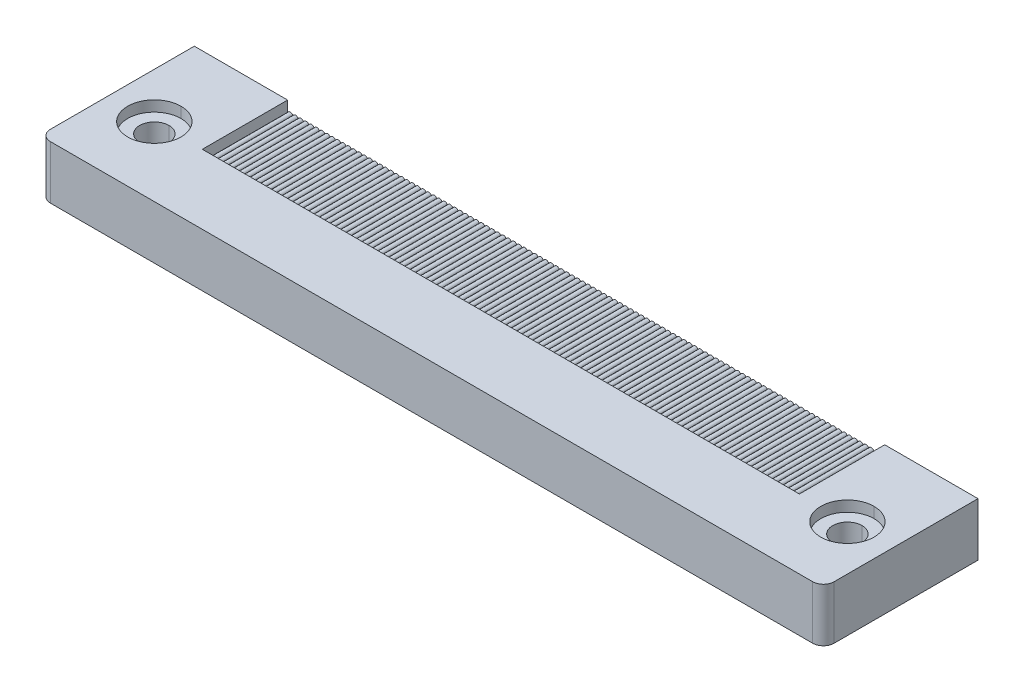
ISO-10303-21;
HEADER;
FILE_DESCRIPTION(('STEP AP214'),'2;1');
FILE_NAME('part.step','',(''),(''),'','','');
FILE_SCHEMA(('AUTOMOTIVE_DESIGN { 1 0 10303 214 1 1 1 1 }'));
ENDSEC;
DATA;
#1=APPLICATION_CONTEXT('core data for automotive mechanical design processes');
#2=APPLICATION_PROTOCOL_DEFINITION('international standard','automotive_design',2000,#1);
#3=PRODUCT_CONTEXT('',#1,'mechanical');
#4=PRODUCT('Part','Part','',(#3));
#5=PRODUCT_RELATED_PRODUCT_CATEGORY('part','',(#4));
#6=PRODUCT_DEFINITION_FORMATION('','',#4);
#7=PRODUCT_DEFINITION_CONTEXT('part definition',#1,'design');
#8=PRODUCT_DEFINITION('design','',#6,#7);
#9=PRODUCT_DEFINITION_SHAPE('','',#8);
#10=(LENGTH_UNIT() NAMED_UNIT(*) SI_UNIT(.MILLI.,.METRE.));
#11=(NAMED_UNIT(*) PLANE_ANGLE_UNIT() SI_UNIT($,.RADIAN.));
#12=(NAMED_UNIT(*) SI_UNIT($,.STERADIAN.) SOLID_ANGLE_UNIT());
#13=UNCERTAINTY_MEASURE_WITH_UNIT(LENGTH_MEASURE(1.E-05),#10,'distance_accuracy_value','');
#14=(GEOMETRIC_REPRESENTATION_CONTEXT(3) GLOBAL_UNCERTAINTY_ASSIGNED_CONTEXT((#13)) GLOBAL_UNIT_ASSIGNED_CONTEXT((#10,
#11,#12)) REPRESENTATION_CONTEXT('',''));
#15=CARTESIAN_POINT('',(0.,0.,0.));
#16=DIRECTION('',(0.,0.,1.));
#17=DIRECTION('',(1.,0.,0.));
#18=AXIS2_PLACEMENT_3D('',#15,#16,#17);
#19=CARTESIAN_POINT('',(0.,0.,0.));
#20=DIRECTION('',(0.,0.,1.));
#21=DIRECTION('',(1.,0.,0.));
#22=AXIS2_PLACEMENT_3D('',#19,#20,#21);
#23=PLANE('',#22);
#24=DIRECTION('',(0.,1.,0.));
#25=VECTOR('',#24,1.);
#26=CARTESIAN_POINT('',(73.5,10.,0.));
#27=LINE('',#26,#25);
#28=CARTESIAN_POINT('',(73.5,0.,0.));
#29=VERTEX_POINT('',#28);
#30=CARTESIAN_POINT('',(73.5,10.,0.));
#31=VERTEX_POINT('',#30);
#32=EDGE_CURVE('E1406',#29,#31,#27,.T.);
#33=ORIENTED_EDGE('',*,*,#32,.F.);
#34=DIRECTION('',(-1.,0.,0.));
#35=VECTOR('',#34,1.);
#36=CARTESIAN_POINT('',(0.,0.,0.));
#37=LINE('',#36,#35);
#38=CARTESIAN_POINT('',(56.,0.,0.));
#39=VERTEX_POINT('',#38);
#40=EDGE_CURVE('E1463',#29,#39,#37,.T.);
#41=ORIENTED_EDGE('',*,*,#40,.T.);
#42=DIRECTION('',(0.,-1.,0.));
#43=VECTOR('',#42,1.);
#44=CARTESIAN_POINT('',(56.,10.,0.));
#45=LINE('',#44,#43);
#46=CARTESIAN_POINT('',(56.,10.,0.));
#47=VERTEX_POINT('',#46);
#48=EDGE_CURVE('E1358',#47,#39,#45,.T.);
#49=ORIENTED_EDGE('',*,*,#48,.F.);
#50=DIRECTION('',(-1.,0.,0.));
#51=VECTOR('',#50,1.);
#52=CARTESIAN_POINT('',(0.,10.,0.));
#53=LINE('',#52,#51);
#54=EDGE_CURVE('E1101',#31,#47,#53,.T.);
#55=ORIENTED_EDGE('',*,*,#54,.F.);
#56=EDGE_LOOP('',(#33,#41,#49,#55));
#57=FACE_BOUND('',#56,.T.);
#58=ADVANCED_FACE('F15',(#57),#23,.F.);
#59=CARTESIAN_POINT('',(0.,0.,0.));
#60=DIRECTION('',(0.,0.,1.));
#61=DIRECTION('',(1.,0.,0.));
#62=AXIS2_PLACEMENT_3D('',#59,#60,#61);
#63=PLANE('',#62);
#64=DIRECTION('',(0.,1.,0.));
#65=VECTOR('',#64,1.);
#66=CARTESIAN_POINT('',(-56.,10.,0.));
#67=LINE('',#66,#65);
#68=CARTESIAN_POINT('',(-56.,0.,0.));
#69=VERTEX_POINT('',#68);
#70=CARTESIAN_POINT('',(-56.,10.,0.));
#71=VERTEX_POINT('',#70);
#72=EDGE_CURVE('E1382',#69,#71,#67,.T.);
#73=ORIENTED_EDGE('',*,*,#72,.F.);
#74=DIRECTION('',(-1.,0.,0.));
#75=VECTOR('',#74,1.);
#76=CARTESIAN_POINT('',(0.,0.,0.));
#77=LINE('',#76,#75);
#78=CARTESIAN_POINT('',(-73.5,0.,0.));
#79=VERTEX_POINT('',#78);
#80=EDGE_CURVE('E1172',#69,#79,#77,.T.);
#81=ORIENTED_EDGE('',*,*,#80,.T.);
#82=DIRECTION('',(0.,-1.,0.));
#83=VECTOR('',#82,1.);
#84=CARTESIAN_POINT('',(-73.5,10.,0.));
#85=LINE('',#84,#83);
#86=CARTESIAN_POINT('',(-73.5,10.,0.));
#87=VERTEX_POINT('',#86);
#88=EDGE_CURVE('E1018',#87,#79,#85,.T.);
#89=ORIENTED_EDGE('',*,*,#88,.F.);
#90=DIRECTION('',(-1.,0.,0.));
#91=VECTOR('',#90,1.);
#92=CARTESIAN_POINT('',(0.,10.,0.));
#93=LINE('',#92,#91);
#94=EDGE_CURVE('E1104',#71,#87,#93,.T.);
#95=ORIENTED_EDGE('',*,*,#94,.F.);
#96=EDGE_LOOP('',(#73,#81,#89,#95));
#97=FACE_BOUND('',#96,.T.);
#98=ADVANCED_FACE('F3460',(#97),#63,.F.);
#99=CARTESIAN_POINT('',(55.5,7.8,16.7071067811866));
#100=DIRECTION('',(0.,0.,-1.));
#101=DIRECTION('',(-1.,0.,0.));
#102=AXIS2_PLACEMENT_3D('',#99,#100,#101);
#103=CYLINDRICAL_SURFACE('',#102,0.5);
#104=CARTESIAN_POINT('',(55.5,7.8,16.));
#105=DIRECTION('',(0.,0.,1.));
#106=DIRECTION('',(1.,0.,0.));
#107=AXIS2_PLACEMENT_3D('',#104,#105,#106);
#108=CIRCLE('',#107,0.5);
#109=CARTESIAN_POINT('',(56.,7.8,16.));
#110=VERTEX_POINT('',#109);
#111=CARTESIAN_POINT('',(55.,7.8,16.));
#112=VERTEX_POINT('',#111);
#113=EDGE_CURVE('E893',#110,#112,#108,.T.);
#114=ORIENTED_EDGE('',*,*,#113,.F.);
#115=DIRECTION('',(0.,0.,-1.));
#116=VECTOR('',#115,1.);
#117=CARTESIAN_POINT('',(56.,7.8,16.7071067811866));
#118=LINE('',#117,#116);
#119=CARTESIAN_POINT('',(56.,7.8,0.005));
#120=VERTEX_POINT('',#119);
#121=EDGE_CURVE('E1374',#110,#120,#118,.T.);
#122=ORIENTED_EDGE('',*,*,#121,.T.);
#123=CARTESIAN_POINT('',(55.5,7.8,0.005));
#124=DIRECTION('',(0.,0.,1.));
#125=DIRECTION('',(-1.,0.,0.));
#126=AXIS2_PLACEMENT_3D('',#123,#124,#125);
#127=CIRCLE('',#126,0.5);
#128=CARTESIAN_POINT('',(55.,7.8,0.005));
#129=VERTEX_POINT('',#128);
#130=EDGE_CURVE('E1497',#120,#129,#127,.T.);
#131=ORIENTED_EDGE('',*,*,#130,.T.);
#132=DIRECTION('',(0.,0.,-1.));
#133=VECTOR('',#132,1.);
#134=CARTESIAN_POINT('',(55.,7.8,16.7071067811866));
#135=LINE('',#134,#133);
#136=EDGE_CURVE('E10',#112,#129,#135,.T.);
#137=ORIENTED_EDGE('',*,*,#136,.F.);
#138=EDGE_LOOP('',(#114,#122,#131,#137));
#139=FACE_BOUND('',#138,.T.);
#140=ADVANCED_FACE('F3450',(#139),#103,.T.);
#141=CARTESIAN_POINT('',(54.5,7.8,16.7071067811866));
#142=DIRECTION('',(0.,0.,-1.));
#143=DIRECTION('',(-1.,0.,0.));
#144=AXIS2_PLACEMENT_3D('',#141,#142,#143);
#145=CYLINDRICAL_SURFACE('',#144,0.5);
#146=CARTESIAN_POINT('',(54.5,7.8,16.));
#147=DIRECTION('',(0.,0.,1.));
#148=DIRECTION('',(1.,0.,0.));
#149=AXIS2_PLACEMENT_3D('',#146,#147,#148);
#150=CIRCLE('',#149,0.5);
#151=CARTESIAN_POINT('',(54.,7.8,16.));
#152=VERTEX_POINT('',#151);
#153=EDGE_CURVE('E903',#112,#152,#150,.T.);
#154=ORIENTED_EDGE('',*,*,#153,.F.);
#155=ORIENTED_EDGE('',*,*,#136,.T.);
#156=CARTESIAN_POINT('',(54.5,7.8,0.005));
#157=DIRECTION('',(0.,0.,1.));
#158=DIRECTION('',(-1.,0.,0.));
#159=AXIS2_PLACEMENT_3D('',#156,#157,#158);
#160=CIRCLE('',#159,0.5);
#161=CARTESIAN_POINT('',(54.,7.8,0.005));
#162=VERTEX_POINT('',#161);
#163=EDGE_CURVE('E1153',#129,#162,#160,.T.);
#164=ORIENTED_EDGE('',*,*,#163,.T.);
#165=DIRECTION('',(0.,0.,-1.));
#166=VECTOR('',#165,1.);
#167=CARTESIAN_POINT('',(54.,7.8,16.7071067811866));
#168=LINE('',#167,#166);
#169=EDGE_CURVE('E23',#152,#162,#168,.T.);
#170=ORIENTED_EDGE('',*,*,#169,.F.);
#171=EDGE_LOOP('',(#154,#155,#164,#170));
#172=FACE_BOUND('',#171,.T.);
#173=ADVANCED_FACE('F3441',(#172),#145,.T.);
#174=CARTESIAN_POINT('',(53.5,7.8,16.7071067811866));
#175=DIRECTION('',(0.,0.,-1.));
#176=DIRECTION('',(-1.,0.,0.));
#177=AXIS2_PLACEMENT_3D('',#174,#175,#176);
#178=CYLINDRICAL_SURFACE('',#177,0.5);
#179=CARTESIAN_POINT('',(53.5,7.8,16.));
#180=DIRECTION('',(0.,0.,1.));
#181=DIRECTION('',(1.,0.,0.));
#182=AXIS2_PLACEMENT_3D('',#179,#180,#181);
#183=CIRCLE('',#182,0.5);
#184=CARTESIAN_POINT('',(53.,7.8,16.));
#185=VERTEX_POINT('',#184);
#186=EDGE_CURVE('E907',#152,#185,#183,.T.);
#187=ORIENTED_EDGE('',*,*,#186,.F.);
#188=ORIENTED_EDGE('',*,*,#169,.T.);
#189=CARTESIAN_POINT('',(53.5,7.8,0.005));
#190=DIRECTION('',(0.,0.,1.));
#191=DIRECTION('',(-1.,0.,0.));
#192=AXIS2_PLACEMENT_3D('',#189,#190,#191);
#193=CIRCLE('',#192,0.5);
#194=CARTESIAN_POINT('',(53.,7.8,0.005));
#195=VERTEX_POINT('',#194);
#196=EDGE_CURVE('E1150',#162,#195,#193,.T.);
#197=ORIENTED_EDGE('',*,*,#196,.T.);
#198=DIRECTION('',(0.,0.,-1.));
#199=VECTOR('',#198,1.);
#200=CARTESIAN_POINT('',(53.,7.8,16.7071067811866));
#201=LINE('',#200,#199);
#202=EDGE_CURVE('E46',#185,#195,#201,.T.);
#203=ORIENTED_EDGE('',*,*,#202,.F.);
#204=EDGE_LOOP('',(#187,#188,#197,#203));
#205=FACE_BOUND('',#204,.T.);
#206=ADVANCED_FACE('F3432',(#205),#178,.T.);
#207=CARTESIAN_POINT('',(52.5,7.8,16.7071067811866));
#208=DIRECTION('',(0.,0.,-1.));
#209=DIRECTION('',(-1.,0.,0.));
#210=AXIS2_PLACEMENT_3D('',#207,#208,#209);
#211=CYLINDRICAL_SURFACE('',#210,0.5);
#212=CARTESIAN_POINT('',(52.5,7.8,16.));
#213=DIRECTION('',(0.,0.,1.));
#214=DIRECTION('',(1.,0.,0.));
#215=AXIS2_PLACEMENT_3D('',#212,#213,#214);
#216=CIRCLE('',#215,0.5);
#217=CARTESIAN_POINT('',(52.,7.8,16.));
#218=VERTEX_POINT('',#217);
#219=EDGE_CURVE('E911',#185,#218,#216,.T.);
#220=ORIENTED_EDGE('',*,*,#219,.F.);
#221=ORIENTED_EDGE('',*,*,#202,.T.);
#222=CARTESIAN_POINT('',(52.5,7.8,0.005));
#223=DIRECTION('',(0.,0.,1.));
#224=DIRECTION('',(-1.,0.,0.));
#225=AXIS2_PLACEMENT_3D('',#222,#223,#224);
#226=CIRCLE('',#225,0.5);
#227=CARTESIAN_POINT('',(52.,7.8,0.005));
#228=VERTEX_POINT('',#227);
#229=EDGE_CURVE('E1154',#195,#228,#226,.T.);
#230=ORIENTED_EDGE('',*,*,#229,.T.);
#231=DIRECTION('',(0.,0.,-1.));
#232=VECTOR('',#231,1.);
#233=CARTESIAN_POINT('',(52.,7.8,16.7071067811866));
#234=LINE('',#233,#232);
#235=EDGE_CURVE('E2111',#218,#228,#234,.T.);
#236=ORIENTED_EDGE('',*,*,#235,.F.);
#237=EDGE_LOOP('',(#220,#221,#230,#236));
#238=FACE_BOUND('',#237,.T.);
#239=ADVANCED_FACE('F3422',(#238),#211,.T.);
#240=CARTESIAN_POINT('',(51.5,7.8,16.7071067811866));
#241=DIRECTION('',(0.,0.,-1.));
#242=DIRECTION('',(-1.,0.,0.));
#243=AXIS2_PLACEMENT_3D('',#240,#241,#242);
#244=CYLINDRICAL_SURFACE('',#243,0.5);
#245=CARTESIAN_POINT('',(51.5,7.8,16.));
#246=DIRECTION('',(0.,0.,1.));
#247=DIRECTION('',(1.,0.,0.));
#248=AXIS2_PLACEMENT_3D('',#245,#246,#247);
#249=CIRCLE('',#248,0.5);
#250=CARTESIAN_POINT('',(51.,7.8,16.));
#251=VERTEX_POINT('',#250);
#252=EDGE_CURVE('E915',#218,#251,#249,.T.);
#253=ORIENTED_EDGE('',*,*,#252,.F.);
#254=ORIENTED_EDGE('',*,*,#235,.T.);
#255=CARTESIAN_POINT('',(51.5,7.8,0.005));
#256=DIRECTION('',(0.,0.,1.));
#257=DIRECTION('',(-1.,0.,0.));
#258=AXIS2_PLACEMENT_3D('',#255,#256,#257);
#259=CIRCLE('',#258,0.5);
#260=CARTESIAN_POINT('',(51.,7.8,0.005));
#261=VERTEX_POINT('',#260);
#262=EDGE_CURVE('E655',#228,#261,#259,.T.);
#263=ORIENTED_EDGE('',*,*,#262,.T.);
#264=DIRECTION('',(0.,0.,-1.));
#265=VECTOR('',#264,1.);
#266=CARTESIAN_POINT('',(51.,7.8,16.7071067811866));
#267=LINE('',#266,#265);
#268=EDGE_CURVE('E644',#251,#261,#267,.T.);
#269=ORIENTED_EDGE('',*,*,#268,.F.);
#270=EDGE_LOOP('',(#253,#254,#263,#269));
#271=FACE_BOUND('',#270,.T.);
#272=ADVANCED_FACE('F3413',(#271),#244,.T.);
#273=CARTESIAN_POINT('',(50.5,7.8,16.7071067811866));
#274=DIRECTION('',(0.,0.,-1.));
#275=DIRECTION('',(-1.,0.,0.));
#276=AXIS2_PLACEMENT_3D('',#273,#274,#275);
#277=CYLINDRICAL_SURFACE('',#276,0.5);
#278=CARTESIAN_POINT('',(50.5,7.8,16.));
#279=DIRECTION('',(0.,0.,1.));
#280=DIRECTION('',(1.,0.,0.));
#281=AXIS2_PLACEMENT_3D('',#278,#279,#280);
#282=CIRCLE('',#281,0.5);
#283=CARTESIAN_POINT('',(50.,7.8,16.));
#284=VERTEX_POINT('',#283);
#285=EDGE_CURVE('E919',#251,#284,#282,.T.);
#286=ORIENTED_EDGE('',*,*,#285,.F.);
#287=ORIENTED_EDGE('',*,*,#268,.T.);
#288=CARTESIAN_POINT('',(50.5,7.8,0.005));
#289=DIRECTION('',(0.,0.,1.));
#290=DIRECTION('',(-1.,0.,0.));
#291=AXIS2_PLACEMENT_3D('',#288,#289,#290);
#292=CIRCLE('',#291,0.5);
#293=CARTESIAN_POINT('',(50.,7.8,0.005));
#294=VERTEX_POINT('',#293);
#295=EDGE_CURVE('E648',#261,#294,#292,.T.);
#296=ORIENTED_EDGE('',*,*,#295,.T.);
#297=DIRECTION('',(0.,0.,-1.));
#298=VECTOR('',#297,1.);
#299=CARTESIAN_POINT('',(50.,7.8,16.7071067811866));
#300=LINE('',#299,#298);
#301=EDGE_CURVE('E630',#284,#294,#300,.T.);
#302=ORIENTED_EDGE('',*,*,#301,.F.);
#303=EDGE_LOOP('',(#286,#287,#296,#302));
#304=FACE_BOUND('',#303,.T.);
#305=ADVANCED_FACE('F649',(#304),#277,.T.);
#306=CARTESIAN_POINT('',(49.5,7.8,16.7071067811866));
#307=DIRECTION('',(0.,0.,-1.));
#308=DIRECTION('',(-1.,0.,0.));
#309=AXIS2_PLACEMENT_3D('',#306,#307,#308);
#310=CYLINDRICAL_SURFACE('',#309,0.5);
#311=CARTESIAN_POINT('',(49.5,7.8,16.));
#312=DIRECTION('',(0.,0.,1.));
#313=DIRECTION('',(1.,0.,0.));
#314=AXIS2_PLACEMENT_3D('',#311,#312,#313);
#315=CIRCLE('',#314,0.5);
#316=CARTESIAN_POINT('',(49.,7.8,16.));
#317=VERTEX_POINT('',#316);
#318=EDGE_CURVE('E639',#284,#317,#315,.T.);
#319=ORIENTED_EDGE('',*,*,#318,.F.);
#320=ORIENTED_EDGE('',*,*,#301,.T.);
#321=CARTESIAN_POINT('',(49.5,7.8,0.005));
#322=DIRECTION('',(0.,0.,1.));
#323=DIRECTION('',(-1.,0.,0.));
#324=AXIS2_PLACEMENT_3D('',#321,#322,#323);
#325=CIRCLE('',#324,0.5);
#326=CARTESIAN_POINT('',(49.,7.8,0.005));
#327=VERTEX_POINT('',#326);
#328=EDGE_CURVE('E635',#294,#327,#325,.T.);
#329=ORIENTED_EDGE('',*,*,#328,.T.);
#330=DIRECTION('',(0.,0.,-1.));
#331=VECTOR('',#330,1.);
#332=CARTESIAN_POINT('',(49.,7.8,16.7071067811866));
#333=LINE('',#332,#331);
#334=EDGE_CURVE('E645',#317,#327,#333,.T.);
#335=ORIENTED_EDGE('',*,*,#334,.F.);
#336=EDGE_LOOP('',(#319,#320,#329,#335));
#337=FACE_BOUND('',#336,.T.);
#338=ADVANCED_FACE('F632',(#337),#310,.T.);
#339=CARTESIAN_POINT('',(48.5,7.8,16.7071067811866));
#340=DIRECTION('',(0.,0.,-1.));
#341=DIRECTION('',(-1.,0.,0.));
#342=AXIS2_PLACEMENT_3D('',#339,#340,#341);
#343=CYLINDRICAL_SURFACE('',#342,0.5);
#344=CARTESIAN_POINT('',(48.5,7.8,16.));
#345=DIRECTION('',(0.,0.,1.));
#346=DIRECTION('',(1.,0.,0.));
#347=AXIS2_PLACEMENT_3D('',#344,#345,#346);
#348=CIRCLE('',#347,0.5);
#349=CARTESIAN_POINT('',(48.,7.8,16.));
#350=VERTEX_POINT('',#349);
#351=EDGE_CURVE('E924',#317,#350,#348,.T.);
#352=ORIENTED_EDGE('',*,*,#351,.F.);
#353=ORIENTED_EDGE('',*,*,#334,.T.);
#354=CARTESIAN_POINT('',(48.5,7.8,0.005));
#355=DIRECTION('',(0.,0.,1.));
#356=DIRECTION('',(-1.,0.,0.));
#357=AXIS2_PLACEMENT_3D('',#354,#355,#356);
#358=CIRCLE('',#357,0.5);
#359=CARTESIAN_POINT('',(48.,7.8,0.005));
#360=VERTEX_POINT('',#359);
#361=EDGE_CURVE('E660',#327,#360,#358,.T.);
#362=ORIENTED_EDGE('',*,*,#361,.T.);
#363=DIRECTION('',(0.,0.,-1.));
#364=VECTOR('',#363,1.);
#365=CARTESIAN_POINT('',(48.,7.8,16.7071067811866));
#366=LINE('',#365,#364);
#367=EDGE_CURVE('E898',#350,#360,#366,.T.);
#368=ORIENTED_EDGE('',*,*,#367,.F.);
#369=EDGE_LOOP('',(#352,#353,#362,#368));
#370=FACE_BOUND('',#369,.T.);
#371=ADVANCED_FACE('F2305',(#370),#343,.T.);
#372=CARTESIAN_POINT('',(47.5,7.8,16.7071067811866));
#373=DIRECTION('',(0.,0.,-1.));
#374=DIRECTION('',(-1.,0.,0.));
#375=AXIS2_PLACEMENT_3D('',#372,#373,#374);
#376=CYLINDRICAL_SURFACE('',#375,0.5);
#377=CARTESIAN_POINT('',(47.5,7.8,16.));
#378=DIRECTION('',(0.,0.,1.));
#379=DIRECTION('',(1.,0.,0.));
#380=AXIS2_PLACEMENT_3D('',#377,#378,#379);
#381=CIRCLE('',#380,0.5);
#382=CARTESIAN_POINT('',(47.,7.8,16.));
#383=VERTEX_POINT('',#382);
#384=EDGE_CURVE('E928',#350,#383,#381,.T.);
#385=ORIENTED_EDGE('',*,*,#384,.F.);
#386=ORIENTED_EDGE('',*,*,#367,.T.);
#387=CARTESIAN_POINT('',(47.5,7.8,0.005));
#388=DIRECTION('',(0.,0.,1.));
#389=DIRECTION('',(-1.,0.,0.));
#390=AXIS2_PLACEMENT_3D('',#387,#388,#389);
#391=CIRCLE('',#390,0.5);
#392=CARTESIAN_POINT('',(47.,7.8,0.005));
#393=VERTEX_POINT('',#392);
#394=EDGE_CURVE('E666',#360,#393,#391,.T.);
#395=ORIENTED_EDGE('',*,*,#394,.T.);
#396=DIRECTION('',(0.,0.,-1.));
#397=VECTOR('',#396,1.);
#398=CARTESIAN_POINT('',(47.,7.8,16.7071067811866));
#399=LINE('',#398,#397);
#400=EDGE_CURVE('E894',#383,#393,#399,.T.);
#401=ORIENTED_EDGE('',*,*,#400,.F.);
#402=EDGE_LOOP('',(#385,#386,#395,#401));
#403=FACE_BOUND('',#402,.T.);
#404=ADVANCED_FACE('F2299',(#403),#376,.T.);
#405=CARTESIAN_POINT('',(46.5,7.8,16.7071067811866));
#406=DIRECTION('',(0.,0.,-1.));
#407=DIRECTION('',(-1.,0.,0.));
#408=AXIS2_PLACEMENT_3D('',#405,#406,#407);
#409=CYLINDRICAL_SURFACE('',#408,0.5);
#410=CARTESIAN_POINT('',(46.5,7.8,16.));
#411=DIRECTION('',(0.,0.,1.));
#412=DIRECTION('',(1.,0.,0.));
#413=AXIS2_PLACEMENT_3D('',#410,#411,#412);
#414=CIRCLE('',#413,0.5);
#415=CARTESIAN_POINT('',(46.,7.8,16.));
#416=VERTEX_POINT('',#415);
#417=EDGE_CURVE('E742',#383,#416,#414,.T.);
#418=ORIENTED_EDGE('',*,*,#417,.F.);
#419=ORIENTED_EDGE('',*,*,#400,.T.);
#420=CARTESIAN_POINT('',(46.5,7.8,0.005));
#421=DIRECTION('',(0.,0.,1.));
#422=DIRECTION('',(-1.,0.,0.));
#423=AXIS2_PLACEMENT_3D('',#420,#421,#422);
#424=CIRCLE('',#423,0.5);
#425=CARTESIAN_POINT('',(46.,7.8,0.005));
#426=VERTEX_POINT('',#425);
#427=EDGE_CURVE('E1219',#393,#426,#424,.T.);
#428=ORIENTED_EDGE('',*,*,#427,.T.);
#429=DIRECTION('',(0.,0.,-1.));
#430=VECTOR('',#429,1.);
#431=CARTESIAN_POINT('',(46.,7.8,16.7071067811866));
#432=LINE('',#431,#430);
#433=EDGE_CURVE('E899',#416,#426,#432,.T.);
#434=ORIENTED_EDGE('',*,*,#433,.F.);
#435=EDGE_LOOP('',(#418,#419,#428,#434));
#436=FACE_BOUND('',#435,.T.);
#437=ADVANCED_FACE('F2304',(#436),#409,.T.);
#438=CARTESIAN_POINT('',(45.5,7.8,16.7071067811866));
#439=DIRECTION('',(0.,0.,-1.));
#440=DIRECTION('',(-1.,0.,0.));
#441=AXIS2_PLACEMENT_3D('',#438,#439,#440);
#442=CYLINDRICAL_SURFACE('',#441,0.5);
#443=CARTESIAN_POINT('',(45.5,7.8,16.));
#444=DIRECTION('',(0.,0.,1.));
#445=DIRECTION('',(1.,0.,0.));
#446=AXIS2_PLACEMENT_3D('',#443,#444,#445);
#447=CIRCLE('',#446,0.5);
#448=CARTESIAN_POINT('',(45.,7.8,16.));
#449=VERTEX_POINT('',#448);
#450=EDGE_CURVE('E737',#416,#449,#447,.T.);
#451=ORIENTED_EDGE('',*,*,#450,.F.);
#452=ORIENTED_EDGE('',*,*,#433,.T.);
#453=CARTESIAN_POINT('',(45.5,7.8,0.005));
#454=DIRECTION('',(0.,0.,1.));
#455=DIRECTION('',(-1.,0.,0.));
#456=AXIS2_PLACEMENT_3D('',#453,#454,#455);
#457=CIRCLE('',#456,0.5);
#458=CARTESIAN_POINT('',(45.,7.8,0.005));
#459=VERTEX_POINT('',#458);
#460=EDGE_CURVE('E1231',#426,#459,#457,.T.);
#461=ORIENTED_EDGE('',*,*,#460,.T.);
#462=DIRECTION('',(0.,0.,-1.));
#463=VECTOR('',#462,1.);
#464=CARTESIAN_POINT('',(45.,7.8,16.7071067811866));
#465=LINE('',#464,#463);
#466=EDGE_CURVE('E1800',#449,#459,#465,.T.);
#467=ORIENTED_EDGE('',*,*,#466,.F.);
#468=EDGE_LOOP('',(#451,#452,#461,#467));
#469=FACE_BOUND('',#468,.T.);
#470=ADVANCED_FACE('F2331',(#469),#442,.T.);
#471=CARTESIAN_POINT('',(44.5,7.8,16.7071067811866));
#472=DIRECTION('',(0.,0.,-1.));
#473=DIRECTION('',(-1.,0.,0.));
#474=AXIS2_PLACEMENT_3D('',#471,#472,#473);
#475=CYLINDRICAL_SURFACE('',#474,0.5);
#476=CARTESIAN_POINT('',(44.5,7.8,16.));
#477=DIRECTION('',(0.,0.,1.));
#478=DIRECTION('',(1.,0.,0.));
#479=AXIS2_PLACEMENT_3D('',#476,#477,#478);
#480=CIRCLE('',#479,0.5);
#481=CARTESIAN_POINT('',(44.,7.8,16.));
#482=VERTEX_POINT('',#481);
#483=EDGE_CURVE('E741',#449,#482,#480,.T.);
#484=ORIENTED_EDGE('',*,*,#483,.F.);
#485=ORIENTED_EDGE('',*,*,#466,.T.);
#486=CARTESIAN_POINT('',(44.5,7.8,0.005));
#487=DIRECTION('',(0.,0.,1.));
#488=DIRECTION('',(-1.,0.,0.));
#489=AXIS2_PLACEMENT_3D('',#486,#487,#488);
#490=CIRCLE('',#489,0.5);
#491=CARTESIAN_POINT('',(44.,7.8,0.005));
#492=VERTEX_POINT('',#491);
#493=EDGE_CURVE('E1248',#459,#492,#490,.T.);
#494=ORIENTED_EDGE('',*,*,#493,.T.);
#495=DIRECTION('',(0.,0.,-1.));
#496=VECTOR('',#495,1.);
#497=CARTESIAN_POINT('',(44.,7.8,16.7071067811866));
#498=LINE('',#497,#496);
#499=EDGE_CURVE('E2098',#482,#492,#498,.T.);
#500=ORIENTED_EDGE('',*,*,#499,.F.);
#501=EDGE_LOOP('',(#484,#485,#494,#500));
#502=FACE_BOUND('',#501,.T.);
#503=ADVANCED_FACE('F2336',(#502),#475,.T.);
#504=CARTESIAN_POINT('',(43.5,7.8,16.7071067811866));
#505=DIRECTION('',(0.,0.,-1.));
#506=DIRECTION('',(-1.,0.,0.));
#507=AXIS2_PLACEMENT_3D('',#504,#505,#506);
#508=CYLINDRICAL_SURFACE('',#507,0.5);
#509=CARTESIAN_POINT('',(43.5,7.8,16.));
#510=DIRECTION('',(0.,0.,1.));
#511=DIRECTION('',(1.,0.,0.));
#512=AXIS2_PLACEMENT_3D('',#509,#510,#511);
#513=CIRCLE('',#512,0.5);
#514=CARTESIAN_POINT('',(43.,7.8,16.));
#515=VERTEX_POINT('',#514);
#516=EDGE_CURVE('E762',#482,#515,#513,.T.);
#517=ORIENTED_EDGE('',*,*,#516,.F.);
#518=ORIENTED_EDGE('',*,*,#499,.T.);
#519=CARTESIAN_POINT('',(43.5,7.8,0.005));
#520=DIRECTION('',(0.,0.,1.));
#521=DIRECTION('',(-1.,0.,0.));
#522=AXIS2_PLACEMENT_3D('',#519,#520,#521);
#523=CIRCLE('',#522,0.5);
#524=CARTESIAN_POINT('',(43.,7.8,0.005));
#525=VERTEX_POINT('',#524);
#526=EDGE_CURVE('E1252',#492,#525,#523,.T.);
#527=ORIENTED_EDGE('',*,*,#526,.T.);
#528=DIRECTION('',(0.,0.,-1.));
#529=VECTOR('',#528,1.);
#530=CARTESIAN_POINT('',(43.,7.8,16.7071067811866));
#531=LINE('',#530,#529);
#532=EDGE_CURVE('E1752',#515,#525,#531,.T.);
#533=ORIENTED_EDGE('',*,*,#532,.F.);
#534=EDGE_LOOP('',(#517,#518,#527,#533));
#535=FACE_BOUND('',#534,.T.);
#536=ADVANCED_FACE('F2751',(#535),#508,.T.);
#537=CARTESIAN_POINT('',(42.5,7.8,16.7071067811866));
#538=DIRECTION('',(0.,0.,-1.));
#539=DIRECTION('',(-1.,0.,0.));
#540=AXIS2_PLACEMENT_3D('',#537,#538,#539);
#541=CYLINDRICAL_SURFACE('',#540,0.5);
#542=CARTESIAN_POINT('',(42.5,7.8,16.));
#543=DIRECTION('',(0.,0.,1.));
#544=DIRECTION('',(1.,0.,0.));
#545=AXIS2_PLACEMENT_3D('',#542,#543,#544);
#546=CIRCLE('',#545,0.5);
#547=CARTESIAN_POINT('',(42.,7.8,16.));
#548=VERTEX_POINT('',#547);
#549=EDGE_CURVE('E783',#515,#548,#546,.T.);
#550=ORIENTED_EDGE('',*,*,#549,.F.);
#551=ORIENTED_EDGE('',*,*,#532,.T.);
#552=CARTESIAN_POINT('',(42.5,7.8,0.005));
#553=DIRECTION('',(0.,0.,1.));
#554=DIRECTION('',(-1.,0.,0.));
#555=AXIS2_PLACEMENT_3D('',#552,#553,#554);
#556=CIRCLE('',#555,0.5);
#557=CARTESIAN_POINT('',(42.,7.8,0.005));
#558=VERTEX_POINT('',#557);
#559=EDGE_CURVE('E1598',#525,#558,#556,.T.);
#560=ORIENTED_EDGE('',*,*,#559,.T.);
#561=DIRECTION('',(0.,0.,-1.));
#562=VECTOR('',#561,1.);
#563=CARTESIAN_POINT('',(42.,7.8,16.7071067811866));
#564=LINE('',#563,#562);
#565=EDGE_CURVE('E1749',#548,#558,#564,.T.);
#566=ORIENTED_EDGE('',*,*,#565,.F.);
#567=EDGE_LOOP('',(#550,#551,#560,#566));
#568=FACE_BOUND('',#567,.T.);
#569=ADVANCED_FACE('F2477',(#568),#541,.T.);
#570=CARTESIAN_POINT('',(41.5,7.8,16.7071067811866));
#571=DIRECTION('',(0.,0.,-1.));
#572=DIRECTION('',(-1.,0.,0.));
#573=AXIS2_PLACEMENT_3D('',#570,#571,#572);
#574=CYLINDRICAL_SURFACE('',#573,0.5);
#575=CARTESIAN_POINT('',(41.5,7.8,16.));
#576=DIRECTION('',(0.,0.,1.));
#577=DIRECTION('',(1.,0.,0.));
#578=AXIS2_PLACEMENT_3D('',#575,#576,#577);
#579=CIRCLE('',#578,0.5);
#580=CARTESIAN_POINT('',(41.,7.8,16.));
#581=VERTEX_POINT('',#580);
#582=EDGE_CURVE('E938',#548,#581,#579,.T.);
#583=ORIENTED_EDGE('',*,*,#582,.F.);
#584=ORIENTED_EDGE('',*,*,#565,.T.);
#585=CARTESIAN_POINT('',(41.5,7.8,0.005));
#586=DIRECTION('',(0.,0.,1.));
#587=DIRECTION('',(-1.,0.,0.));
#588=AXIS2_PLACEMENT_3D('',#585,#586,#587);
#589=CIRCLE('',#588,0.5);
#590=CARTESIAN_POINT('',(41.,7.8,0.005));
#591=VERTEX_POINT('',#590);
#592=EDGE_CURVE('E1602',#558,#591,#589,.T.);
#593=ORIENTED_EDGE('',*,*,#592,.T.);
#594=DIRECTION('',(0.,0.,-1.));
#595=VECTOR('',#594,1.);
#596=CARTESIAN_POINT('',(41.,7.8,16.7071067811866));
#597=LINE('',#596,#595);
#598=EDGE_CURVE('E1753',#581,#591,#597,.T.);
#599=ORIENTED_EDGE('',*,*,#598,.F.);
#600=EDGE_LOOP('',(#583,#584,#593,#599));
#601=FACE_BOUND('',#600,.T.);
#602=ADVANCED_FACE('F2471',(#601),#574,.T.);
#603=CARTESIAN_POINT('',(40.5,7.8,16.7071067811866));
#604=DIRECTION('',(0.,0.,-1.));
#605=DIRECTION('',(-1.,0.,0.));
#606=AXIS2_PLACEMENT_3D('',#603,#604,#605);
#607=CYLINDRICAL_SURFACE('',#606,0.5);
#608=CARTESIAN_POINT('',(40.5,7.8,16.));
#609=DIRECTION('',(0.,0.,1.));
#610=DIRECTION('',(1.,0.,0.));
#611=AXIS2_PLACEMENT_3D('',#608,#609,#610);
#612=CIRCLE('',#611,0.5);
#613=CARTESIAN_POINT('',(40.,7.8,16.));
#614=VERTEX_POINT('',#613);
#615=EDGE_CURVE('E942',#581,#614,#612,.T.);
#616=ORIENTED_EDGE('',*,*,#615,.F.);
#617=ORIENTED_EDGE('',*,*,#598,.T.);
#618=CARTESIAN_POINT('',(40.5,7.8,0.005));
#619=DIRECTION('',(0.,0.,1.));
#620=DIRECTION('',(-1.,0.,0.));
#621=AXIS2_PLACEMENT_3D('',#618,#619,#620);
#622=CIRCLE('',#621,0.5);
#623=CARTESIAN_POINT('',(40.,7.8,0.005));
#624=VERTEX_POINT('',#623);
#625=EDGE_CURVE('E1616',#591,#624,#622,.T.);
#626=ORIENTED_EDGE('',*,*,#625,.T.);
#627=DIRECTION('',(0.,0.,-1.));
#628=VECTOR('',#627,1.);
#629=CARTESIAN_POINT('',(40.,7.8,16.7071067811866));
#630=LINE('',#629,#628);
#631=EDGE_CURVE('E735',#614,#624,#630,.T.);
#632=ORIENTED_EDGE('',*,*,#631,.F.);
#633=EDGE_LOOP('',(#616,#617,#626,#632));
#634=FACE_BOUND('',#633,.T.);
#635=ADVANCED_FACE('F2476',(#634),#607,.T.);
#636=CARTESIAN_POINT('',(39.5,7.8,16.7071067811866));
#637=DIRECTION('',(0.,0.,-1.));
#638=DIRECTION('',(-1.,0.,0.));
#639=AXIS2_PLACEMENT_3D('',#636,#637,#638);
#640=CYLINDRICAL_SURFACE('',#639,0.5);
#641=CARTESIAN_POINT('',(39.5,7.8,16.));
#642=DIRECTION('',(0.,0.,1.));
#643=DIRECTION('',(1.,0.,0.));
#644=AXIS2_PLACEMENT_3D('',#641,#642,#643);
#645=CIRCLE('',#644,0.5);
#646=CARTESIAN_POINT('',(39.,7.8,16.));
#647=VERTEX_POINT('',#646);
#648=EDGE_CURVE('E951',#614,#647,#645,.T.);
#649=ORIENTED_EDGE('',*,*,#648,.F.);
#650=ORIENTED_EDGE('',*,*,#631,.T.);
#651=CARTESIAN_POINT('',(39.5,7.8,0.005));
#652=DIRECTION('',(0.,0.,1.));
#653=DIRECTION('',(-1.,0.,0.));
#654=AXIS2_PLACEMENT_3D('',#651,#652,#653);
#655=CIRCLE('',#654,0.5);
#656=CARTESIAN_POINT('',(39.,7.8,0.005));
#657=VERTEX_POINT('',#656);
#658=EDGE_CURVE('E1620',#624,#657,#655,.T.);
#659=ORIENTED_EDGE('',*,*,#658,.T.);
#660=DIRECTION('',(0.,0.,-1.));
#661=VECTOR('',#660,1.);
#662=CARTESIAN_POINT('',(39.,7.8,16.7071067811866));
#663=LINE('',#662,#661);
#664=EDGE_CURVE('E732',#647,#657,#663,.T.);
#665=ORIENTED_EDGE('',*,*,#664,.F.);
#666=EDGE_LOOP('',(#649,#650,#659,#665));
#667=FACE_BOUND('',#666,.T.);
#668=ADVANCED_FACE('F3363',(#667),#640,.T.);
#669=CARTESIAN_POINT('',(38.5,7.8,16.7071067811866));
#670=DIRECTION('',(0.,0.,-1.));
#671=DIRECTION('',(-1.,0.,0.));
#672=AXIS2_PLACEMENT_3D('',#669,#670,#671);
#673=CYLINDRICAL_SURFACE('',#672,0.5);
#674=CARTESIAN_POINT('',(38.5,7.8,16.));
#675=DIRECTION('',(0.,0.,1.));
#676=DIRECTION('',(1.,0.,0.));
#677=AXIS2_PLACEMENT_3D('',#674,#675,#676);
#678=CIRCLE('',#677,0.5);
#679=CARTESIAN_POINT('',(38.,7.8,16.));
#680=VERTEX_POINT('',#679);
#681=EDGE_CURVE('E955',#647,#680,#678,.T.);
#682=ORIENTED_EDGE('',*,*,#681,.F.);
#683=ORIENTED_EDGE('',*,*,#664,.T.);
#684=CARTESIAN_POINT('',(38.5,7.8,0.005));
#685=DIRECTION('',(0.,0.,1.));
#686=DIRECTION('',(-1.,0.,0.));
#687=AXIS2_PLACEMENT_3D('',#684,#685,#686);
#688=CIRCLE('',#687,0.5);
#689=CARTESIAN_POINT('',(38.,7.8,0.005));
#690=VERTEX_POINT('',#689);
#691=EDGE_CURVE('E1611',#657,#690,#688,.T.);
#692=ORIENTED_EDGE('',*,*,#691,.T.);
#693=DIRECTION('',(0.,0.,-1.));
#694=VECTOR('',#693,1.);
#695=CARTESIAN_POINT('',(38.,7.8,16.7071067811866));
#696=LINE('',#695,#694);
#697=EDGE_CURVE('E736',#680,#690,#696,.T.);
#698=ORIENTED_EDGE('',*,*,#697,.F.);
#699=EDGE_LOOP('',(#682,#683,#692,#698));
#700=FACE_BOUND('',#699,.T.);
#701=ADVANCED_FACE('F3353',(#700),#673,.T.);
#702=CARTESIAN_POINT('',(37.5,7.8,16.7071067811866));
#703=DIRECTION('',(0.,0.,-1.));
#704=DIRECTION('',(-1.,0.,0.));
#705=AXIS2_PLACEMENT_3D('',#702,#703,#704);
#706=CYLINDRICAL_SURFACE('',#705,0.5);
#707=CARTESIAN_POINT('',(37.5,7.8,16.));
#708=DIRECTION('',(0.,0.,1.));
#709=DIRECTION('',(1.,0.,0.));
#710=AXIS2_PLACEMENT_3D('',#707,#708,#709);
#711=CIRCLE('',#710,0.5);
#712=CARTESIAN_POINT('',(37.,7.8,16.));
#713=VERTEX_POINT('',#712);
#714=EDGE_CURVE('E752',#680,#713,#711,.T.);
#715=ORIENTED_EDGE('',*,*,#714,.F.);
#716=ORIENTED_EDGE('',*,*,#697,.T.);
#717=CARTESIAN_POINT('',(37.5,7.8,0.005));
#718=DIRECTION('',(0.,0.,1.));
#719=DIRECTION('',(-1.,0.,0.));
#720=AXIS2_PLACEMENT_3D('',#717,#718,#719);
#721=CIRCLE('',#720,0.5);
#722=CARTESIAN_POINT('',(37.,7.8,0.005));
#723=VERTEX_POINT('',#722);
#724=EDGE_CURVE('E1607',#690,#723,#721,.T.);
#725=ORIENTED_EDGE('',*,*,#724,.T.);
#726=DIRECTION('',(0.,0.,-1.));
#727=VECTOR('',#726,1.);
#728=CARTESIAN_POINT('',(37.,7.8,16.7071067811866));
#729=LINE('',#728,#727);
#730=EDGE_CURVE('E2087',#713,#723,#729,.T.);
#731=ORIENTED_EDGE('',*,*,#730,.F.);
#732=EDGE_LOOP('',(#715,#716,#725,#731));
#733=FACE_BOUND('',#732,.T.);
#734=ADVANCED_FACE('F3233',(#733),#706,.T.);
#735=CARTESIAN_POINT('',(36.5,7.8,16.7071067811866));
#736=DIRECTION('',(0.,0.,-1.));
#737=DIRECTION('',(-1.,0.,0.));
#738=AXIS2_PLACEMENT_3D('',#735,#736,#737);
#739=CYLINDRICAL_SURFACE('',#738,0.5);
#740=CARTESIAN_POINT('',(36.5,7.8,16.));
#741=DIRECTION('',(0.,0.,1.));
#742=DIRECTION('',(1.,0.,0.));
#743=AXIS2_PLACEMENT_3D('',#740,#741,#742);
#744=CIRCLE('',#743,0.5);
#745=CARTESIAN_POINT('',(36.,7.8,16.));
#746=VERTEX_POINT('',#745);
#747=EDGE_CURVE('E747',#713,#746,#744,.T.);
#748=ORIENTED_EDGE('',*,*,#747,.F.);
#749=ORIENTED_EDGE('',*,*,#730,.T.);
#750=CARTESIAN_POINT('',(36.5,7.8,0.005));
#751=DIRECTION('',(0.,0.,1.));
#752=DIRECTION('',(-1.,0.,0.));
#753=AXIS2_PLACEMENT_3D('',#750,#751,#752);
#754=CIRCLE('',#753,0.5);
#755=CARTESIAN_POINT('',(36.,7.8,0.005));
#756=VERTEX_POINT('',#755);
#757=EDGE_CURVE('E1521',#723,#756,#754,.T.);
#758=ORIENTED_EDGE('',*,*,#757,.T.);
#759=DIRECTION('',(0.,0.,-1.));
#760=VECTOR('',#759,1.);
#761=CARTESIAN_POINT('',(36.,7.8,16.7071067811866));
#762=LINE('',#761,#760);
#763=EDGE_CURVE('E946',#746,#756,#762,.T.);
#764=ORIENTED_EDGE('',*,*,#763,.F.);
#765=EDGE_LOOP('',(#748,#749,#758,#764));
#766=FACE_BOUND('',#765,.T.);
#767=ADVANCED_FACE('F3165',(#766),#739,.T.);
#768=CARTESIAN_POINT('',(35.5,7.8,16.7071067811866));
#769=DIRECTION('',(0.,0.,-1.));
#770=DIRECTION('',(-1.,0.,0.));
#771=AXIS2_PLACEMENT_3D('',#768,#769,#770);
#772=CYLINDRICAL_SURFACE('',#771,0.5);
#773=CARTESIAN_POINT('',(35.5,7.8,16.));
#774=DIRECTION('',(0.,0.,1.));
#775=DIRECTION('',(1.,0.,0.));
#776=AXIS2_PLACEMENT_3D('',#773,#774,#775);
#777=CIRCLE('',#776,0.5);
#778=CARTESIAN_POINT('',(35.,7.8,16.));
#779=VERTEX_POINT('',#778);
#780=EDGE_CURVE('E751',#746,#779,#777,.T.);
#781=ORIENTED_EDGE('',*,*,#780,.F.);
#782=ORIENTED_EDGE('',*,*,#763,.T.);
#783=CARTESIAN_POINT('',(35.5,7.8,0.005));
#784=DIRECTION('',(0.,0.,1.));
#785=DIRECTION('',(-1.,0.,0.));
#786=AXIS2_PLACEMENT_3D('',#783,#784,#785);
#787=CIRCLE('',#786,0.5);
#788=CARTESIAN_POINT('',(35.,7.8,0.005));
#789=VERTEX_POINT('',#788);
#790=EDGE_CURVE('E1190',#756,#789,#787,.T.);
#791=ORIENTED_EDGE('',*,*,#790,.T.);
#792=DIRECTION('',(0.,0.,-1.));
#793=VECTOR('',#792,1.);
#794=CARTESIAN_POINT('',(35.,7.8,16.7071067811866));
#795=LINE('',#794,#793);
#796=EDGE_CURVE('E943',#779,#789,#795,.T.);
#797=ORIENTED_EDGE('',*,*,#796,.F.);
#798=EDGE_LOOP('',(#781,#782,#791,#797));
#799=FACE_BOUND('',#798,.T.);
#800=ADVANCED_FACE('F2625',(#799),#772,.T.);
#801=CARTESIAN_POINT('',(34.5,7.8,16.7071067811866));
#802=DIRECTION('',(0.,0.,-1.));
#803=DIRECTION('',(-1.,0.,0.));
#804=AXIS2_PLACEMENT_3D('',#801,#802,#803);
#805=CYLINDRICAL_SURFACE('',#804,0.5);
#806=CARTESIAN_POINT('',(34.5,7.8,16.));
#807=DIRECTION('',(0.,0.,1.));
#808=DIRECTION('',(1.,0.,0.));
#809=AXIS2_PLACEMENT_3D('',#806,#807,#808);
#810=CIRCLE('',#809,0.5);
#811=CARTESIAN_POINT('',(34.,7.8,16.));
#812=VERTEX_POINT('',#811);
#813=EDGE_CURVE('E775',#779,#812,#810,.T.);
#814=ORIENTED_EDGE('',*,*,#813,.F.);
#815=ORIENTED_EDGE('',*,*,#796,.T.);
#816=CARTESIAN_POINT('',(34.5,7.8,0.005));
#817=DIRECTION('',(0.,0.,1.));
#818=DIRECTION('',(-1.,0.,0.));
#819=AXIS2_PLACEMENT_3D('',#816,#817,#818);
#820=CIRCLE('',#819,0.5);
#821=CARTESIAN_POINT('',(34.,7.8,0.005));
#822=VERTEX_POINT('',#821);
#823=EDGE_CURVE('E1186',#789,#822,#820,.T.);
#824=ORIENTED_EDGE('',*,*,#823,.T.);
#825=DIRECTION('',(0.,0.,-1.));
#826=VECTOR('',#825,1.);
#827=CARTESIAN_POINT('',(34.,7.8,16.7071067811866));
#828=LINE('',#827,#826);
#829=EDGE_CURVE('E947',#812,#822,#828,.T.);
#830=ORIENTED_EDGE('',*,*,#829,.F.);
#831=EDGE_LOOP('',(#814,#815,#824,#830));
#832=FACE_BOUND('',#831,.T.);
#833=ADVANCED_FACE('F2257',(#832),#805,.T.);
#834=CARTESIAN_POINT('',(33.5,7.8,16.7071067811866));
#835=DIRECTION('',(0.,0.,-1.));
#836=DIRECTION('',(-1.,0.,0.));
#837=AXIS2_PLACEMENT_3D('',#834,#835,#836);
#838=CYLINDRICAL_SURFACE('',#837,0.5);
#839=CARTESIAN_POINT('',(33.5,7.8,16.));
#840=DIRECTION('',(0.,0.,1.));
#841=DIRECTION('',(1.,0.,0.));
#842=AXIS2_PLACEMENT_3D('',#839,#840,#841);
#843=CIRCLE('',#842,0.5);
#844=CARTESIAN_POINT('',(33.,7.8,16.));
#845=VERTEX_POINT('',#844);
#846=EDGE_CURVE('E816',#812,#845,#843,.T.);
#847=ORIENTED_EDGE('',*,*,#846,.F.);
#848=ORIENTED_EDGE('',*,*,#829,.T.);
#849=CARTESIAN_POINT('',(33.5,7.8,0.005));
#850=DIRECTION('',(0.,0.,1.));
#851=DIRECTION('',(-1.,0.,0.));
#852=AXIS2_PLACEMENT_3D('',#849,#850,#851);
#853=CIRCLE('',#852,0.5);
#854=CARTESIAN_POINT('',(33.,7.8,0.005));
#855=VERTEX_POINT('',#854);
#856=EDGE_CURVE('E1191',#822,#855,#853,.T.);
#857=ORIENTED_EDGE('',*,*,#856,.T.);
#858=DIRECTION('',(0.,0.,-1.));
#859=VECTOR('',#858,1.);
#860=CARTESIAN_POINT('',(33.,7.8,16.7071067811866));
#861=LINE('',#860,#859);
#862=EDGE_CURVE('E2032',#845,#855,#861,.T.);
#863=ORIENTED_EDGE('',*,*,#862,.F.);
#864=EDGE_LOOP('',(#847,#848,#857,#863));
#865=FACE_BOUND('',#864,.T.);
#866=ADVANCED_FACE('F2251',(#865),#838,.T.);
#867=CARTESIAN_POINT('',(32.5,7.8,16.7071067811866));
#868=DIRECTION('',(0.,0.,-1.));
#869=DIRECTION('',(-1.,0.,0.));
#870=AXIS2_PLACEMENT_3D('',#867,#868,#869);
#871=CYLINDRICAL_SURFACE('',#870,0.5);
#872=CARTESIAN_POINT('',(32.5,7.8,16.));
#873=DIRECTION('',(0.,0.,1.));
#874=DIRECTION('',(1.,0.,0.));
#875=AXIS2_PLACEMENT_3D('',#872,#873,#874);
#876=CIRCLE('',#875,0.5);
#877=CARTESIAN_POINT('',(32.,7.8,16.));
#878=VERTEX_POINT('',#877);
#879=EDGE_CURVE('E965',#845,#878,#876,.T.);
#880=ORIENTED_EDGE('',*,*,#879,.F.);
#881=ORIENTED_EDGE('',*,*,#862,.T.);
#882=CARTESIAN_POINT('',(32.5,7.8,0.005));
#883=DIRECTION('',(0.,0.,1.));
#884=DIRECTION('',(-1.,0.,0.));
#885=AXIS2_PLACEMENT_3D('',#882,#883,#884);
#886=CIRCLE('',#885,0.5);
#887=CARTESIAN_POINT('',(32.,7.8,0.005));
#888=VERTEX_POINT('',#887);
#889=EDGE_CURVE('E844',#855,#888,#886,.T.);
#890=ORIENTED_EDGE('',*,*,#889,.T.);
#891=DIRECTION('',(0.,0.,-1.));
#892=VECTOR('',#891,1.);
#893=CARTESIAN_POINT('',(32.,7.8,16.7071067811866));
#894=LINE('',#893,#892);
#895=EDGE_CURVE('E770',#878,#888,#894,.T.);
#896=ORIENTED_EDGE('',*,*,#895,.F.);
#897=EDGE_LOOP('',(#880,#881,#890,#896));
#898=FACE_BOUND('',#897,.T.);
#899=ADVANCED_FACE('F2256',(#898),#871,.T.);
#900=CARTESIAN_POINT('',(31.5,7.8,16.7071067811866));
#901=DIRECTION('',(0.,0.,-1.));
#902=DIRECTION('',(-1.,0.,0.));
#903=AXIS2_PLACEMENT_3D('',#900,#901,#902);
#904=CYLINDRICAL_SURFACE('',#903,0.5);
#905=CARTESIAN_POINT('',(31.5,7.8,16.));
#906=DIRECTION('',(0.,0.,1.));
#907=DIRECTION('',(1.,0.,0.));
#908=AXIS2_PLACEMENT_3D('',#905,#906,#907);
#909=CIRCLE('',#908,0.5);
#910=CARTESIAN_POINT('',(31.,7.8,16.));
#911=VERTEX_POINT('',#910);
#912=EDGE_CURVE('E969',#878,#911,#909,.T.);
#913=ORIENTED_EDGE('',*,*,#912,.F.);
#914=ORIENTED_EDGE('',*,*,#895,.T.);
#915=CARTESIAN_POINT('',(31.5,7.8,0.005));
#916=DIRECTION('',(0.,0.,1.));
#917=DIRECTION('',(-1.,0.,0.));
#918=AXIS2_PLACEMENT_3D('',#915,#916,#917);
#919=CIRCLE('',#918,0.5);
#920=CARTESIAN_POINT('',(31.,7.8,0.005));
#921=VERTEX_POINT('',#920);
#922=EDGE_CURVE('E840',#888,#921,#919,.T.);
#923=ORIENTED_EDGE('',*,*,#922,.T.);
#924=DIRECTION('',(0.,0.,-1.));
#925=VECTOR('',#924,1.);
#926=CARTESIAN_POINT('',(31.,7.8,16.7071067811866));
#927=LINE('',#926,#925);
#928=EDGE_CURVE('E767',#911,#921,#927,.T.);
#929=ORIENTED_EDGE('',*,*,#928,.F.);
#930=EDGE_LOOP('',(#913,#914,#923,#929));
#931=FACE_BOUND('',#930,.T.);
#932=ADVANCED_FACE('F2275',(#931),#904,.T.);
#933=CARTESIAN_POINT('',(30.5,7.8,16.7071067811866));
#934=DIRECTION('',(0.,0.,-1.));
#935=DIRECTION('',(-1.,0.,0.));
#936=AXIS2_PLACEMENT_3D('',#933,#934,#935);
#937=CYLINDRICAL_SURFACE('',#936,0.5);
#938=CARTESIAN_POINT('',(30.5,7.8,16.));
#939=DIRECTION('',(0.,0.,1.));
#940=DIRECTION('',(1.,0.,0.));
#941=AXIS2_PLACEMENT_3D('',#938,#939,#940);
#942=CIRCLE('',#941,0.5);
#943=CARTESIAN_POINT('',(30.,7.8,16.));
#944=VERTEX_POINT('',#943);
#945=EDGE_CURVE('E973',#911,#944,#942,.T.);
#946=ORIENTED_EDGE('',*,*,#945,.F.);
#947=ORIENTED_EDGE('',*,*,#928,.T.);
#948=CARTESIAN_POINT('',(30.5,7.8,0.005));
#949=DIRECTION('',(0.,0.,1.));
#950=DIRECTION('',(-1.,0.,0.));
#951=AXIS2_PLACEMENT_3D('',#948,#949,#950);
#952=CIRCLE('',#951,0.5);
#953=CARTESIAN_POINT('',(30.,7.8,0.005));
#954=VERTEX_POINT('',#953);
#955=EDGE_CURVE('E845',#921,#954,#952,.T.);
#956=ORIENTED_EDGE('',*,*,#955,.T.);
#957=DIRECTION('',(0.,0.,-1.));
#958=VECTOR('',#957,1.);
#959=CARTESIAN_POINT('',(30.,7.8,16.7071067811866));
#960=LINE('',#959,#958);
#961=EDGE_CURVE('E771',#944,#954,#960,.T.);
#962=ORIENTED_EDGE('',*,*,#961,.F.);
#963=EDGE_LOOP('',(#946,#947,#956,#962));
#964=FACE_BOUND('',#963,.T.);
#965=ADVANCED_FACE('F2280',(#964),#937,.T.);
#966=CARTESIAN_POINT('',(29.5,7.8,16.7071067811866));
#967=DIRECTION('',(0.,0.,-1.));
#968=DIRECTION('',(-1.,0.,0.));
#969=AXIS2_PLACEMENT_3D('',#966,#967,#968);
#970=CYLINDRICAL_SURFACE('',#969,0.5);
#971=CARTESIAN_POINT('',(29.5,7.8,16.));
#972=DIRECTION('',(0.,0.,1.));
#973=DIRECTION('',(1.,0.,0.));
#974=AXIS2_PLACEMENT_3D('',#971,#972,#973);
#975=CIRCLE('',#974,0.5);
#976=CARTESIAN_POINT('',(29.,7.8,16.));
#977=VERTEX_POINT('',#976);
#978=EDGE_CURVE('E977',#944,#977,#975,.T.);
#979=ORIENTED_EDGE('',*,*,#978,.F.);
#980=ORIENTED_EDGE('',*,*,#961,.T.);
#981=CARTESIAN_POINT('',(29.5,7.8,0.005));
#982=DIRECTION('',(0.,0.,1.));
#983=DIRECTION('',(-1.,0.,0.));
#984=AXIS2_PLACEMENT_3D('',#981,#982,#983);
#985=CIRCLE('',#984,0.5);
#986=CARTESIAN_POINT('',(29.,7.8,0.005));
#987=VERTEX_POINT('',#986);
#988=EDGE_CURVE('E1589',#954,#987,#985,.T.);
#989=ORIENTED_EDGE('',*,*,#988,.T.);
#990=DIRECTION('',(0.,0.,-1.));
#991=VECTOR('',#990,1.);
#992=CARTESIAN_POINT('',(29.,7.8,16.7071067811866));
#993=LINE('',#992,#991);
#994=EDGE_CURVE('E1069',#977,#987,#993,.T.);
#995=ORIENTED_EDGE('',*,*,#994,.F.);
#996=EDGE_LOOP('',(#979,#980,#989,#995));
#997=FACE_BOUND('',#996,.T.);
#998=ADVANCED_FACE('F3155',(#997),#970,.T.);
#999=CARTESIAN_POINT('',(28.5,7.8,16.7071067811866));
#1000=DIRECTION('',(0.,0.,-1.));
#1001=DIRECTION('',(-1.,0.,0.));
#1002=AXIS2_PLACEMENT_3D('',#999,#1000,#1001);
#1003=CYLINDRICAL_SURFACE('',#1002,0.5);
#1004=CARTESIAN_POINT('',(28.5,7.8,16.));
#1005=DIRECTION('',(0.,0.,1.));
#1006=DIRECTION('',(1.,0.,0.));
#1007=AXIS2_PLACEMENT_3D('',#1004,#1005,#1006);
#1008=CIRCLE('',#1007,0.5);
#1009=CARTESIAN_POINT('',(28.,7.8,16.));
#1010=VERTEX_POINT('',#1009);
#1011=EDGE_CURVE('E871',#977,#1010,#1008,.T.);
#1012=ORIENTED_EDGE('',*,*,#1011,.F.);
#1013=ORIENTED_EDGE('',*,*,#994,.T.);
#1014=CARTESIAN_POINT('',(28.5,7.8,0.005));
#1015=DIRECTION('',(0.,0.,1.));
#1016=DIRECTION('',(-1.,0.,0.));
#1017=AXIS2_PLACEMENT_3D('',#1014,#1015,#1016);
#1018=CIRCLE('',#1017,0.5);
#1019=CARTESIAN_POINT('',(28.,7.8,0.005));
#1020=VERTEX_POINT('',#1019);
#1021=EDGE_CURVE('E1572',#987,#1020,#1018,.T.);
#1022=ORIENTED_EDGE('',*,*,#1021,.T.);
#1023=DIRECTION('',(0.,0.,-1.));
#1024=VECTOR('',#1023,1.);
#1025=CARTESIAN_POINT('',(28.,7.8,16.7071067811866));
#1026=LINE('',#1025,#1024);
#1027=EDGE_CURVE('E2075',#1010,#1020,#1026,.T.);
#1028=ORIENTED_EDGE('',*,*,#1027,.F.);
#1029=EDGE_LOOP('',(#1012,#1013,#1022,#1028));
#1030=FACE_BOUND('',#1029,.T.);
#1031=ADVANCED_FACE('F3067',(#1030),#1003,.T.);
#1032=CARTESIAN_POINT('',(27.5,7.8,16.7071067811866));
#1033=DIRECTION('',(0.,0.,-1.));
#1034=DIRECTION('',(-1.,0.,0.));
#1035=AXIS2_PLACEMENT_3D('',#1032,#1033,#1034);
#1036=CYLINDRICAL_SURFACE('',#1035,0.5);
#1037=CARTESIAN_POINT('',(27.5,7.8,16.));
#1038=DIRECTION('',(0.,0.,1.));
#1039=DIRECTION('',(1.,0.,0.));
#1040=AXIS2_PLACEMENT_3D('',#1037,#1038,#1039);
#1041=CIRCLE('',#1040,0.5);
#1042=CARTESIAN_POINT('',(27.,7.8,16.));
#1043=VERTEX_POINT('',#1042);
#1044=EDGE_CURVE('E866',#1010,#1043,#1041,.T.);
#1045=ORIENTED_EDGE('',*,*,#1044,.F.);
#1046=ORIENTED_EDGE('',*,*,#1027,.T.);
#1047=CARTESIAN_POINT('',(27.5,7.8,0.005));
#1048=DIRECTION('',(0.,0.,1.));
#1049=DIRECTION('',(-1.,0.,0.));
#1050=AXIS2_PLACEMENT_3D('',#1047,#1048,#1049);
#1051=CIRCLE('',#1050,0.5);
#1052=CARTESIAN_POINT('',(27.,7.8,0.005));
#1053=VERTEX_POINT('',#1052);
#1054=EDGE_CURVE('E1568',#1020,#1053,#1051,.T.);
#1055=ORIENTED_EDGE('',*,*,#1054,.T.);
#1056=DIRECTION('',(0.,0.,-1.));
#1057=VECTOR('',#1056,1.);
#1058=CARTESIAN_POINT('',(27.,7.8,16.7071067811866));
#1059=LINE('',#1058,#1057);
#1060=EDGE_CURVE('E1086',#1043,#1053,#1059,.T.);
#1061=ORIENTED_EDGE('',*,*,#1060,.F.);
#1062=EDGE_LOOP('',(#1045,#1046,#1055,#1061));
#1063=FACE_BOUND('',#1062,.T.);
#1064=ADVANCED_FACE('F2929',(#1063),#1036,.T.);
#1065=CARTESIAN_POINT('',(26.5,7.8,16.7071067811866));
#1066=DIRECTION('',(0.,0.,-1.));
#1067=DIRECTION('',(-1.,0.,0.));
#1068=AXIS2_PLACEMENT_3D('',#1065,#1066,#1067);
#1069=CYLINDRICAL_SURFACE('',#1068,0.5);
#1070=CARTESIAN_POINT('',(26.5,7.8,16.));
#1071=DIRECTION('',(0.,0.,1.));
#1072=DIRECTION('',(1.,0.,0.));
#1073=AXIS2_PLACEMENT_3D('',#1070,#1071,#1072);
#1074=CIRCLE('',#1073,0.5);
#1075=CARTESIAN_POINT('',(26.,7.8,16.));
#1076=VERTEX_POINT('',#1075);
#1077=EDGE_CURVE('E870',#1043,#1076,#1074,.T.);
#1078=ORIENTED_EDGE('',*,*,#1077,.F.);
#1079=ORIENTED_EDGE('',*,*,#1060,.T.);
#1080=CARTESIAN_POINT('',(26.5,7.8,0.005));
#1081=DIRECTION('',(0.,0.,1.));
#1082=DIRECTION('',(-1.,0.,0.));
#1083=AXIS2_PLACEMENT_3D('',#1080,#1081,#1082);
#1084=CIRCLE('',#1083,0.5);
#1085=CARTESIAN_POINT('',(26.,7.8,0.005));
#1086=VERTEX_POINT('',#1085);
#1087=EDGE_CURVE('E1573',#1053,#1086,#1084,.T.);
#1088=ORIENTED_EDGE('',*,*,#1087,.T.);
#1089=DIRECTION('',(0.,0.,-1.));
#1090=VECTOR('',#1089,1.);
#1091=CARTESIAN_POINT('',(26.,7.8,16.7071067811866));
#1092=LINE('',#1091,#1090);
#1093=EDGE_CURVE('E1083',#1076,#1086,#1092,.T.);
#1094=ORIENTED_EDGE('',*,*,#1093,.F.);
#1095=EDGE_LOOP('',(#1078,#1079,#1088,#1094));
#1096=FACE_BOUND('',#1095,.T.);
#1097=ADVANCED_FACE('F2802',(#1096),#1069,.T.);
#1098=CARTESIAN_POINT('',(25.5,7.8,16.7071067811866));
#1099=DIRECTION('',(0.,0.,-1.));
#1100=DIRECTION('',(-1.,0.,0.));
#1101=AXIS2_PLACEMENT_3D('',#1098,#1099,#1100);
#1102=CYLINDRICAL_SURFACE('',#1101,0.5);
#1103=CARTESIAN_POINT('',(25.5,7.8,16.));
#1104=DIRECTION('',(0.,0.,1.));
#1105=DIRECTION('',(1.,0.,0.));
#1106=AXIS2_PLACEMENT_3D('',#1103,#1104,#1105);
#1107=CIRCLE('',#1106,0.5);
#1108=CARTESIAN_POINT('',(25.,7.8,16.));
#1109=VERTEX_POINT('',#1108);
#1110=EDGE_CURVE('E798',#1076,#1109,#1107,.T.);
#1111=ORIENTED_EDGE('',*,*,#1110,.F.);
#1112=ORIENTED_EDGE('',*,*,#1093,.T.);
#1113=CARTESIAN_POINT('',(25.5,7.8,0.005));
#1114=DIRECTION('',(0.,0.,1.));
#1115=DIRECTION('',(-1.,0.,0.));
#1116=AXIS2_PLACEMENT_3D('',#1113,#1114,#1115);
#1117=CIRCLE('',#1116,0.5);
#1118=CARTESIAN_POINT('',(25.,7.8,0.005));
#1119=VERTEX_POINT('',#1118);
#1120=EDGE_CURVE('E1686',#1086,#1119,#1117,.T.);
#1121=ORIENTED_EDGE('',*,*,#1120,.T.);
#1122=DIRECTION('',(0.,0.,-1.));
#1123=VECTOR('',#1122,1.);
#1124=CARTESIAN_POINT('',(25.,7.8,16.7071067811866));
#1125=LINE('',#1124,#1123);
#1126=EDGE_CURVE('E1087',#1109,#1119,#1125,.T.);
#1127=ORIENTED_EDGE('',*,*,#1126,.F.);
#1128=EDGE_LOOP('',(#1111,#1112,#1121,#1127));
#1129=FACE_BOUND('',#1128,.T.);
#1130=ADVANCED_FACE('F2796',(#1129),#1102,.T.);
#1131=CARTESIAN_POINT('',(24.5,7.8,16.7071067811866));
#1132=DIRECTION('',(0.,0.,-1.));
#1133=DIRECTION('',(-1.,0.,0.));
#1134=AXIS2_PLACEMENT_3D('',#1131,#1132,#1133);
#1135=CYLINDRICAL_SURFACE('',#1134,0.5);
#1136=CARTESIAN_POINT('',(24.5,7.8,16.));
#1137=DIRECTION('',(0.,0.,1.));
#1138=DIRECTION('',(1.,0.,0.));
#1139=AXIS2_PLACEMENT_3D('',#1136,#1137,#1138);
#1140=CIRCLE('',#1139,0.5);
#1141=CARTESIAN_POINT('',(24.,7.8,16.));
#1142=VERTEX_POINT('',#1141);
#1143=EDGE_CURVE('E793',#1109,#1142,#1140,.T.);
#1144=ORIENTED_EDGE('',*,*,#1143,.F.);
#1145=ORIENTED_EDGE('',*,*,#1126,.T.);
#1146=CARTESIAN_POINT('',(24.5,7.8,0.005));
#1147=DIRECTION('',(0.,0.,1.));
#1148=DIRECTION('',(-1.,0.,0.));
#1149=AXIS2_PLACEMENT_3D('',#1146,#1147,#1148);
#1150=CIRCLE('',#1149,0.5);
#1151=CARTESIAN_POINT('',(24.,7.8,0.005));
#1152=VERTEX_POINT('',#1151);
#1153=EDGE_CURVE('E1690',#1119,#1152,#1150,.T.);
#1154=ORIENTED_EDGE('',*,*,#1153,.T.);
#1155=DIRECTION('',(0.,0.,-1.));
#1156=VECTOR('',#1155,1.);
#1157=CARTESIAN_POINT('',(24.,7.8,16.7071067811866));
#1158=LINE('',#1157,#1156);
#1159=EDGE_CURVE('E2067',#1142,#1152,#1158,.T.);
#1160=ORIENTED_EDGE('',*,*,#1159,.F.);
#1161=EDGE_LOOP('',(#1144,#1145,#1154,#1160));
#1162=FACE_BOUND('',#1161,.T.);
#1163=ADVANCED_FACE('F2801',(#1162),#1135,.T.);
#1164=CARTESIAN_POINT('',(23.5,7.8,16.7071067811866));
#1165=DIRECTION('',(0.,0.,-1.));
#1166=DIRECTION('',(-1.,0.,0.));
#1167=AXIS2_PLACEMENT_3D('',#1164,#1165,#1166);
#1168=CYLINDRICAL_SURFACE('',#1167,0.5);
#1169=CARTESIAN_POINT('',(23.5,7.8,16.));
#1170=DIRECTION('',(0.,0.,1.));
#1171=DIRECTION('',(1.,0.,0.));
#1172=AXIS2_PLACEMENT_3D('',#1169,#1170,#1171);
#1173=CIRCLE('',#1172,0.5);
#1174=CARTESIAN_POINT('',(23.,7.8,16.));
#1175=VERTEX_POINT('',#1174);
#1176=EDGE_CURVE('E797',#1142,#1175,#1173,.T.);
#1177=ORIENTED_EDGE('',*,*,#1176,.F.);
#1178=ORIENTED_EDGE('',*,*,#1159,.T.);
#1179=CARTESIAN_POINT('',(23.5,7.8,0.005));
#1180=DIRECTION('',(0.,0.,1.));
#1181=DIRECTION('',(-1.,0.,0.));
#1182=AXIS2_PLACEMENT_3D('',#1179,#1180,#1181);
#1183=CIRCLE('',#1182,0.5);
#1184=CARTESIAN_POINT('',(23.,7.8,0.005));
#1185=VERTEX_POINT('',#1184);
#1186=EDGE_CURVE('E1633',#1152,#1185,#1183,.T.);
#1187=ORIENTED_EDGE('',*,*,#1186,.T.);
#1188=DIRECTION('',(0.,0.,-1.));
#1189=VECTOR('',#1188,1.);
#1190=CARTESIAN_POINT('',(23.,7.8,16.7071067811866));
#1191=LINE('',#1190,#1189);
#1192=EDGE_CURVE('E1997',#1175,#1185,#1191,.T.);
#1193=ORIENTED_EDGE('',*,*,#1192,.F.);
#1194=EDGE_LOOP('',(#1177,#1178,#1187,#1193));
#1195=FACE_BOUND('',#1194,.T.);
#1196=ADVANCED_FACE('F2560',(#1195),#1168,.T.);
#1197=CARTESIAN_POINT('',(22.5,7.8,16.7071067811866));
#1198=DIRECTION('',(0.,0.,-1.));
#1199=DIRECTION('',(-1.,0.,0.));
#1200=AXIS2_PLACEMENT_3D('',#1197,#1198,#1199);
#1201=CYLINDRICAL_SURFACE('',#1200,0.5);
#1202=CARTESIAN_POINT('',(22.5,7.8,16.));
#1203=DIRECTION('',(0.,0.,1.));
#1204=DIRECTION('',(1.,0.,0.));
#1205=AXIS2_PLACEMENT_3D('',#1202,#1203,#1204);
#1206=CIRCLE('',#1205,0.5);
#1207=CARTESIAN_POINT('',(22.,7.8,16.));
#1208=VERTEX_POINT('',#1207);
#1209=EDGE_CURVE('E991',#1175,#1208,#1206,.T.);
#1210=ORIENTED_EDGE('',*,*,#1209,.F.);
#1211=ORIENTED_EDGE('',*,*,#1192,.T.);
#1212=CARTESIAN_POINT('',(22.5,7.8,0.005));
#1213=DIRECTION('',(0.,0.,1.));
#1214=DIRECTION('',(-1.,0.,0.));
#1215=AXIS2_PLACEMENT_3D('',#1212,#1213,#1214);
#1216=CIRCLE('',#1215,0.5);
#1217=CARTESIAN_POINT('',(22.,7.8,0.005));
#1218=VERTEX_POINT('',#1217);
#1219=EDGE_CURVE('E1629',#1185,#1218,#1216,.T.);
#1220=ORIENTED_EDGE('',*,*,#1219,.T.);
#1221=DIRECTION('',(0.,0.,-1.));
#1222=VECTOR('',#1221,1.);
#1223=CARTESIAN_POINT('',(22.,7.8,16.7071067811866));
#1224=LINE('',#1223,#1222);
#1225=EDGE_CURVE('E1325',#1208,#1218,#1224,.T.);
#1226=ORIENTED_EDGE('',*,*,#1225,.F.);
#1227=EDGE_LOOP('',(#1210,#1211,#1220,#1226));
#1228=FACE_BOUND('',#1227,.T.);
#1229=ADVANCED_FACE('F2554',(#1228),#1201,.T.);
#1230=CARTESIAN_POINT('',(21.5,7.8,16.7071067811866));
#1231=DIRECTION('',(0.,0.,-1.));
#1232=DIRECTION('',(-1.,0.,0.));
#1233=AXIS2_PLACEMENT_3D('',#1230,#1231,#1232);
#1234=CYLINDRICAL_SURFACE('',#1233,0.5);
#1235=CARTESIAN_POINT('',(21.5,7.8,16.));
#1236=DIRECTION('',(0.,0.,1.));
#1237=DIRECTION('',(1.,0.,0.));
#1238=AXIS2_PLACEMENT_3D('',#1235,#1236,#1237);
#1239=CIRCLE('',#1238,0.5);
#1240=CARTESIAN_POINT('',(21.,7.8,16.));
#1241=VERTEX_POINT('',#1240);
#1242=EDGE_CURVE('E999',#1208,#1241,#1239,.T.);
#1243=ORIENTED_EDGE('',*,*,#1242,.F.);
#1244=ORIENTED_EDGE('',*,*,#1225,.T.);
#1245=CARTESIAN_POINT('',(21.5,7.8,0.005));
#1246=DIRECTION('',(0.,0.,1.));
#1247=DIRECTION('',(-1.,0.,0.));
#1248=AXIS2_PLACEMENT_3D('',#1245,#1246,#1247);
#1249=CIRCLE('',#1248,0.5);
#1250=CARTESIAN_POINT('',(21.,7.8,0.005));
#1251=VERTEX_POINT('',#1250);
#1252=EDGE_CURVE('E1634',#1218,#1251,#1249,.T.);
#1253=ORIENTED_EDGE('',*,*,#1252,.T.);
#1254=DIRECTION('',(0.,0.,-1.));
#1255=VECTOR('',#1254,1.);
#1256=CARTESIAN_POINT('',(21.,7.8,16.7071067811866));
#1257=LINE('',#1256,#1255);
#1258=EDGE_CURVE('E1322',#1241,#1251,#1257,.T.);
#1259=ORIENTED_EDGE('',*,*,#1258,.F.);
#1260=EDGE_LOOP('',(#1243,#1244,#1253,#1259));
#1261=FACE_BOUND('',#1260,.T.);
#1262=ADVANCED_FACE('F2559',(#1261),#1234,.T.);
#1263=CARTESIAN_POINT('',(20.5,7.8,16.7071067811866));
#1264=DIRECTION('',(0.,0.,-1.));
#1265=DIRECTION('',(-1.,0.,0.));
#1266=AXIS2_PLACEMENT_3D('',#1263,#1264,#1265);
#1267=CYLINDRICAL_SURFACE('',#1266,0.5);
#1268=CARTESIAN_POINT('',(20.5,7.8,16.));
#1269=DIRECTION('',(0.,0.,1.));
#1270=DIRECTION('',(1.,0.,0.));
#1271=AXIS2_PLACEMENT_3D('',#1268,#1269,#1270);
#1272=CIRCLE('',#1271,0.5);
#1273=CARTESIAN_POINT('',(20.,7.8,16.));
#1274=VERTEX_POINT('',#1273);
#1275=EDGE_CURVE('E1007',#1241,#1274,#1272,.T.);
#1276=ORIENTED_EDGE('',*,*,#1275,.F.);
#1277=ORIENTED_EDGE('',*,*,#1258,.T.);
#1278=CARTESIAN_POINT('',(20.5,7.8,0.005));
#1279=DIRECTION('',(0.,0.,1.));
#1280=DIRECTION('',(-1.,0.,0.));
#1281=AXIS2_PLACEMENT_3D('',#1278,#1279,#1280);
#1282=CIRCLE('',#1281,0.5);
#1283=CARTESIAN_POINT('',(20.,7.8,0.005));
#1284=VERTEX_POINT('',#1283);
#1285=EDGE_CURVE('E1643',#1251,#1284,#1282,.T.);
#1286=ORIENTED_EDGE('',*,*,#1285,.T.);
#1287=DIRECTION('',(0.,0.,-1.));
#1288=VECTOR('',#1287,1.);
#1289=CARTESIAN_POINT('',(20.,7.8,16.7071067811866));
#1290=LINE('',#1289,#1288);
#1291=EDGE_CURVE('E1326',#1274,#1284,#1290,.T.);
#1292=ORIENTED_EDGE('',*,*,#1291,.F.);
#1293=EDGE_LOOP('',(#1276,#1277,#1286,#1292));
#1294=FACE_BOUND('',#1293,.T.);
#1295=ADVANCED_FACE('F3295',(#1294),#1267,.T.);
#1296=CARTESIAN_POINT('',(19.5,7.8,16.7071067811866));
#1297=DIRECTION('',(0.,0.,-1.));
#1298=DIRECTION('',(-1.,0.,0.));
#1299=AXIS2_PLACEMENT_3D('',#1296,#1297,#1298);
#1300=CYLINDRICAL_SURFACE('',#1299,0.5);
#1301=CARTESIAN_POINT('',(19.5,7.8,16.));
#1302=DIRECTION('',(0.,0.,1.));
#1303=DIRECTION('',(1.,0.,0.));
#1304=AXIS2_PLACEMENT_3D('',#1301,#1302,#1303);
#1305=CIRCLE('',#1304,0.5);
#1306=CARTESIAN_POINT('',(19.,7.8,16.));
#1307=VERTEX_POINT('',#1306);
#1308=EDGE_CURVE('E1023',#1274,#1307,#1305,.T.);
#1309=ORIENTED_EDGE('',*,*,#1308,.F.);
#1310=ORIENTED_EDGE('',*,*,#1291,.T.);
#1311=CARTESIAN_POINT('',(19.5,7.8,0.005));
#1312=DIRECTION('',(0.,0.,1.));
#1313=DIRECTION('',(-1.,0.,0.));
#1314=AXIS2_PLACEMENT_3D('',#1311,#1312,#1313);
#1315=CIRCLE('',#1314,0.5);
#1316=CARTESIAN_POINT('',(19.,7.8,0.005));
#1317=VERTEX_POINT('',#1316);
#1318=EDGE_CURVE('E1551',#1284,#1317,#1315,.T.);
#1319=ORIENTED_EDGE('',*,*,#1318,.T.);
#1320=DIRECTION('',(0.,0.,-1.));
#1321=VECTOR('',#1320,1.);
#1322=CARTESIAN_POINT('',(19.,7.8,16.7071067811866));
#1323=LINE('',#1322,#1321);
#1324=EDGE_CURVE('E2060',#1307,#1317,#1323,.T.);
#1325=ORIENTED_EDGE('',*,*,#1324,.F.);
#1326=EDGE_LOOP('',(#1309,#1310,#1319,#1325));
#1327=FACE_BOUND('',#1326,.T.);
#1328=ADVANCED_FACE('F2877',(#1327),#1300,.T.);
#1329=CARTESIAN_POINT('',(18.5,7.8,16.7071067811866));
#1330=DIRECTION('',(0.,0.,-1.));
#1331=DIRECTION('',(-1.,0.,0.));
#1332=AXIS2_PLACEMENT_3D('',#1329,#1330,#1331);
#1333=CYLINDRICAL_SURFACE('',#1332,0.5);
#1334=CARTESIAN_POINT('',(18.5,7.8,16.));
#1335=DIRECTION('',(0.,0.,1.));
#1336=DIRECTION('',(1.,0.,0.));
#1337=AXIS2_PLACEMENT_3D('',#1334,#1335,#1336);
#1338=CIRCLE('',#1337,0.5);
#1339=CARTESIAN_POINT('',(18.,7.8,16.));
#1340=VERTEX_POINT('',#1339);
#1341=EDGE_CURVE('E679',#1307,#1340,#1338,.T.);
#1342=ORIENTED_EDGE('',*,*,#1341,.F.);
#1343=ORIENTED_EDGE('',*,*,#1324,.T.);
#1344=CARTESIAN_POINT('',(18.5,7.8,0.005));
#1345=DIRECTION('',(0.,0.,1.));
#1346=DIRECTION('',(-1.,0.,0.));
#1347=AXIS2_PLACEMENT_3D('',#1344,#1345,#1346);
#1348=CIRCLE('',#1347,0.5);
#1349=CARTESIAN_POINT('',(18.,7.8,0.005));
#1350=VERTEX_POINT('',#1349);
#1351=EDGE_CURVE('E1534',#1317,#1350,#1348,.T.);
#1352=ORIENTED_EDGE('',*,*,#1351,.T.);
#1353=DIRECTION('',(0.,0.,-1.));
#1354=VECTOR('',#1353,1.);
#1355=CARTESIAN_POINT('',(18.,7.8,16.7071067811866));
#1356=LINE('',#1355,#1354);
#1357=EDGE_CURVE('E2057',#1340,#1350,#1356,.T.);
#1358=ORIENTED_EDGE('',*,*,#1357,.F.);
#1359=EDGE_LOOP('',(#1342,#1343,#1352,#1358));
#1360=FACE_BOUND('',#1359,.T.);
#1361=ADVANCED_FACE('F2203',(#1360),#1333,.T.);
#1362=CARTESIAN_POINT('',(17.5,7.8,16.7071067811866));
#1363=DIRECTION('',(0.,0.,-1.));
#1364=DIRECTION('',(-1.,0.,0.));
#1365=AXIS2_PLACEMENT_3D('',#1362,#1363,#1364);
#1366=CYLINDRICAL_SURFACE('',#1365,0.5);
#1367=CARTESIAN_POINT('',(17.5,7.8,16.));
#1368=DIRECTION('',(0.,0.,1.));
#1369=DIRECTION('',(1.,0.,0.));
#1370=AXIS2_PLACEMENT_3D('',#1367,#1368,#1369);
#1371=CIRCLE('',#1370,0.5);
#1372=CARTESIAN_POINT('',(17.,7.8,16.));
#1373=VERTEX_POINT('',#1372);
#1374=EDGE_CURVE('E674',#1340,#1373,#1371,.T.);
#1375=ORIENTED_EDGE('',*,*,#1374,.F.);
#1376=ORIENTED_EDGE('',*,*,#1357,.T.);
#1377=CARTESIAN_POINT('',(17.5,7.8,0.005));
#1378=DIRECTION('',(0.,0.,1.));
#1379=DIRECTION('',(-1.,0.,0.));
#1380=AXIS2_PLACEMENT_3D('',#1377,#1378,#1379);
#1381=CIRCLE('',#1380,0.5);
#1382=CARTESIAN_POINT('',(17.,7.8,0.005));
#1383=VERTEX_POINT('',#1382);
#1384=EDGE_CURVE('E1530',#1350,#1383,#1381,.T.);
#1385=ORIENTED_EDGE('',*,*,#1384,.T.);
#1386=DIRECTION('',(0.,0.,-1.));
#1387=VECTOR('',#1386,1.);
#1388=CARTESIAN_POINT('',(17.,7.8,16.7071067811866));
#1389=LINE('',#1388,#1387);
#1390=EDGE_CURVE('E2054',#1373,#1383,#1389,.T.);
#1391=ORIENTED_EDGE('',*,*,#1390,.F.);
#1392=EDGE_LOOP('',(#1375,#1376,#1385,#1391));
#1393=FACE_BOUND('',#1392,.T.);
#1394=ADVANCED_FACE('F2197',(#1393),#1366,.T.);
#1395=CARTESIAN_POINT('',(16.5,7.8,16.7071067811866));
#1396=DIRECTION('',(0.,0.,-1.));
#1397=DIRECTION('',(-1.,0.,0.));
#1398=AXIS2_PLACEMENT_3D('',#1395,#1396,#1397);
#1399=CYLINDRICAL_SURFACE('',#1398,0.5);
#1400=CARTESIAN_POINT('',(16.5,7.8,16.));
#1401=DIRECTION('',(0.,0.,1.));
#1402=DIRECTION('',(1.,0.,0.));
#1403=AXIS2_PLACEMENT_3D('',#1400,#1401,#1402);
#1404=CIRCLE('',#1403,0.5);
#1405=CARTESIAN_POINT('',(16.,7.8,16.));
#1406=VERTEX_POINT('',#1405);
#1407=EDGE_CURVE('E678',#1373,#1406,#1404,.T.);
#1408=ORIENTED_EDGE('',*,*,#1407,.F.);
#1409=ORIENTED_EDGE('',*,*,#1390,.T.);
#1410=CARTESIAN_POINT('',(16.5,7.8,0.005));
#1411=DIRECTION('',(0.,0.,1.));
#1412=DIRECTION('',(-1.,0.,0.));
#1413=AXIS2_PLACEMENT_3D('',#1410,#1411,#1412);
#1414=CIRCLE('',#1413,0.5);
#1415=CARTESIAN_POINT('',(16.,7.8,0.005));
#1416=VERTEX_POINT('',#1415);
#1417=EDGE_CURVE('E1535',#1383,#1416,#1414,.T.);
#1418=ORIENTED_EDGE('',*,*,#1417,.T.);
#1419=DIRECTION('',(0.,0.,-1.));
#1420=VECTOR('',#1419,1.);
#1421=CARTESIAN_POINT('',(16.,7.8,16.7071067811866));
#1422=LINE('',#1421,#1420);
#1423=EDGE_CURVE('E2051',#1406,#1416,#1422,.T.);
#1424=ORIENTED_EDGE('',*,*,#1423,.F.);
#1425=EDGE_LOOP('',(#1408,#1409,#1418,#1424));
#1426=FACE_BOUND('',#1425,.T.);
#1427=ADVANCED_FACE('F2202',(#1426),#1399,.T.);
#1428=CARTESIAN_POINT('',(15.5,7.8,16.7071067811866));
#1429=DIRECTION('',(0.,0.,-1.));
#1430=DIRECTION('',(-1.,0.,0.));
#1431=AXIS2_PLACEMENT_3D('',#1428,#1429,#1430);
#1432=CYLINDRICAL_SURFACE('',#1431,0.5);
#1433=CARTESIAN_POINT('',(15.5,7.8,16.));
#1434=DIRECTION('',(0.,0.,1.));
#1435=DIRECTION('',(1.,0.,0.));
#1436=AXIS2_PLACEMENT_3D('',#1433,#1434,#1435);
#1437=CIRCLE('',#1436,0.5);
#1438=CARTESIAN_POINT('',(15.,7.8,16.));
#1439=VERTEX_POINT('',#1438);
#1440=EDGE_CURVE('E835',#1406,#1439,#1437,.T.);
#1441=ORIENTED_EDGE('',*,*,#1440,.F.);
#1442=ORIENTED_EDGE('',*,*,#1423,.T.);
#1443=CARTESIAN_POINT('',(15.5,7.8,0.005));
#1444=DIRECTION('',(0.,0.,1.));
#1445=DIRECTION('',(-1.,0.,0.));
#1446=AXIS2_PLACEMENT_3D('',#1443,#1444,#1445);
#1447=CIRCLE('',#1446,0.5);
#1448=CARTESIAN_POINT('',(15.,7.8,0.005));
#1449=VERTEX_POINT('',#1448);
#1450=EDGE_CURVE('E1563',#1416,#1449,#1447,.T.);
#1451=ORIENTED_EDGE('',*,*,#1450,.T.);
#1452=DIRECTION('',(0.,0.,-1.));
#1453=VECTOR('',#1452,1.);
#1454=CARTESIAN_POINT('',(15.,7.8,16.7071067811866));
#1455=LINE('',#1454,#1453);
#1456=EDGE_CURVE('E1286',#1439,#1449,#1455,.T.);
#1457=ORIENTED_EDGE('',*,*,#1456,.F.);
#1458=EDGE_LOOP('',(#1441,#1442,#1451,#1457));
#1459=FACE_BOUND('',#1458,.T.);
#1460=ADVANCED_FACE('F2954',(#1459),#1432,.T.);
#1461=CARTESIAN_POINT('',(14.5,7.8,16.7071067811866));
#1462=DIRECTION('',(0.,0.,-1.));
#1463=DIRECTION('',(-1.,0.,0.));
#1464=AXIS2_PLACEMENT_3D('',#1461,#1462,#1463);
#1465=CYLINDRICAL_SURFACE('',#1464,0.5);
#1466=CARTESIAN_POINT('',(14.5,7.8,16.));
#1467=DIRECTION('',(0.,0.,1.));
#1468=DIRECTION('',(1.,0.,0.));
#1469=AXIS2_PLACEMENT_3D('',#1466,#1467,#1468);
#1470=CIRCLE('',#1469,0.5);
#1471=CARTESIAN_POINT('',(14.,7.8,16.));
#1472=VERTEX_POINT('',#1471);
#1473=EDGE_CURVE('E839',#1439,#1472,#1470,.T.);
#1474=ORIENTED_EDGE('',*,*,#1473,.F.);
#1475=ORIENTED_EDGE('',*,*,#1456,.T.);
#1476=CARTESIAN_POINT('',(14.5,7.8,0.005));
#1477=DIRECTION('',(0.,0.,1.));
#1478=DIRECTION('',(-1.,0.,0.));
#1479=AXIS2_PLACEMENT_3D('',#1476,#1477,#1478);
#1480=CIRCLE('',#1479,0.5);
#1481=CARTESIAN_POINT('',(14.,7.8,0.005));
#1482=VERTEX_POINT('',#1481);
#1483=EDGE_CURVE('E1677',#1449,#1482,#1480,.T.);
#1484=ORIENTED_EDGE('',*,*,#1483,.T.);
#1485=DIRECTION('',(0.,0.,-1.));
#1486=VECTOR('',#1485,1.);
#1487=CARTESIAN_POINT('',(14.,7.8,16.7071067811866));
#1488=LINE('',#1487,#1486);
#1489=EDGE_CURVE('E1283',#1472,#1482,#1488,.T.);
#1490=ORIENTED_EDGE('',*,*,#1489,.F.);
#1491=EDGE_LOOP('',(#1474,#1475,#1484,#1490));
#1492=FACE_BOUND('',#1491,.T.);
#1493=ADVANCED_FACE('F2959',(#1492),#1465,.T.);
#1494=CARTESIAN_POINT('',(13.5,7.8,16.7071067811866));
#1495=DIRECTION('',(0.,0.,-1.));
#1496=DIRECTION('',(-1.,0.,0.));
#1497=AXIS2_PLACEMENT_3D('',#1494,#1495,#1496);
#1498=CYLINDRICAL_SURFACE('',#1497,0.5);
#1499=CARTESIAN_POINT('',(13.5,7.8,16.));
#1500=DIRECTION('',(0.,0.,1.));
#1501=DIRECTION('',(1.,0.,0.));
#1502=AXIS2_PLACEMENT_3D('',#1499,#1500,#1501);
#1503=CIRCLE('',#1502,0.5);
#1504=CARTESIAN_POINT('',(13.,7.8,16.));
#1505=VERTEX_POINT('',#1504);
#1506=EDGE_CURVE('E1062',#1472,#1505,#1503,.T.);
#1507=ORIENTED_EDGE('',*,*,#1506,.F.);
#1508=ORIENTED_EDGE('',*,*,#1489,.T.);
#1509=CARTESIAN_POINT('',(13.5,7.8,0.005));
#1510=DIRECTION('',(0.,0.,1.));
#1511=DIRECTION('',(-1.,0.,0.));
#1512=AXIS2_PLACEMENT_3D('',#1509,#1510,#1511);
#1513=CIRCLE('',#1512,0.5);
#1514=CARTESIAN_POINT('',(13.,7.8,0.005));
#1515=VERTEX_POINT('',#1514);
#1516=EDGE_CURVE('E1681',#1482,#1515,#1513,.T.);
#1517=ORIENTED_EDGE('',*,*,#1516,.T.);
#1518=DIRECTION('',(0.,0.,-1.));
#1519=VECTOR('',#1518,1.);
#1520=CARTESIAN_POINT('',(13.,7.8,16.7071067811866));
#1521=LINE('',#1520,#1519);
#1522=EDGE_CURVE('E1287',#1505,#1515,#1521,.T.);
#1523=ORIENTED_EDGE('',*,*,#1522,.F.);
#1524=EDGE_LOOP('',(#1507,#1508,#1517,#1523));
#1525=FACE_BOUND('',#1524,.T.);
#1526=ADVANCED_FACE('F3269',(#1525),#1498,.T.);
#1527=CARTESIAN_POINT('',(12.5,7.8,16.7071067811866));
#1528=DIRECTION('',(0.,0.,-1.));
#1529=DIRECTION('',(-1.,0.,0.));
#1530=AXIS2_PLACEMENT_3D('',#1527,#1528,#1529);
#1531=CYLINDRICAL_SURFACE('',#1530,0.5);
#1532=CARTESIAN_POINT('',(12.5,7.8,16.));
#1533=DIRECTION('',(0.,0.,1.));
#1534=DIRECTION('',(1.,0.,0.));
#1535=AXIS2_PLACEMENT_3D('',#1532,#1533,#1534);
#1536=CIRCLE('',#1535,0.5);
#1537=CARTESIAN_POINT('',(12.,7.8,16.));
#1538=VERTEX_POINT('',#1537);
#1539=EDGE_CURVE('E1078',#1505,#1538,#1536,.T.);
#1540=ORIENTED_EDGE('',*,*,#1539,.F.);
#1541=ORIENTED_EDGE('',*,*,#1522,.T.);
#1542=CARTESIAN_POINT('',(12.5,7.8,0.005));
#1543=DIRECTION('',(0.,0.,1.));
#1544=DIRECTION('',(-1.,0.,0.));
#1545=AXIS2_PLACEMENT_3D('',#1542,#1543,#1544);
#1546=CIRCLE('',#1545,0.5);
#1547=CARTESIAN_POINT('',(12.,7.8,0.005));
#1548=VERTEX_POINT('',#1547);
#1549=EDGE_CURVE('E1671',#1515,#1548,#1546,.T.);
#1550=ORIENTED_EDGE('',*,*,#1549,.T.);
#1551=DIRECTION('',(0.,0.,-1.));
#1552=VECTOR('',#1551,1.);
#1553=CARTESIAN_POINT('',(12.,7.8,16.7071067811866));
#1554=LINE('',#1553,#1552);
#1555=EDGE_CURVE('E1429',#1538,#1548,#1554,.T.);
#1556=ORIENTED_EDGE('',*,*,#1555,.F.);
#1557=EDGE_LOOP('',(#1540,#1541,#1550,#1556));
#1558=FACE_BOUND('',#1557,.T.);
#1559=ADVANCED_FACE('F3259',(#1558),#1531,.T.);
#1560=CARTESIAN_POINT('',(11.5,7.8,16.7071067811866));
#1561=DIRECTION('',(0.,0.,-1.));
#1562=DIRECTION('',(-1.,0.,0.));
#1563=AXIS2_PLACEMENT_3D('',#1560,#1561,#1562);
#1564=CYLINDRICAL_SURFACE('',#1563,0.5);
#1565=CARTESIAN_POINT('',(11.5,7.8,16.));
#1566=DIRECTION('',(0.,0.,1.));
#1567=DIRECTION('',(1.,0.,0.));
#1568=AXIS2_PLACEMENT_3D('',#1565,#1566,#1567);
#1569=CIRCLE('',#1568,0.5);
#1570=CARTESIAN_POINT('',(11.,7.8,16.));
#1571=VERTEX_POINT('',#1570);
#1572=EDGE_CURVE('E1091',#1538,#1571,#1569,.T.);
#1573=ORIENTED_EDGE('',*,*,#1572,.F.);
#1574=ORIENTED_EDGE('',*,*,#1555,.T.);
#1575=CARTESIAN_POINT('',(11.5,7.8,0.005));
#1576=DIRECTION('',(0.,0.,1.));
#1577=DIRECTION('',(-1.,0.,0.));
#1578=AXIS2_PLACEMENT_3D('',#1575,#1576,#1577);
#1579=CIRCLE('',#1578,0.5);
#1580=CARTESIAN_POINT('',(11.,7.8,0.005));
#1581=VERTEX_POINT('',#1580);
#1582=EDGE_CURVE('E1667',#1548,#1581,#1579,.T.);
#1583=ORIENTED_EDGE('',*,*,#1582,.T.);
#1584=DIRECTION('',(0.,0.,-1.));
#1585=VECTOR('',#1584,1.);
#1586=CARTESIAN_POINT('',(11.,7.8,16.7071067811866));
#1587=LINE('',#1586,#1585);
#1588=EDGE_CURVE('E1432',#1571,#1581,#1587,.T.);
#1589=ORIENTED_EDGE('',*,*,#1588,.F.);
#1590=EDGE_LOOP('',(#1573,#1574,#1583,#1589));
#1591=FACE_BOUND('',#1590,.T.);
#1592=ADVANCED_FACE('F2816',(#1591),#1564,.T.);
#1593=CARTESIAN_POINT('',(10.5,7.8,16.7071067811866));
#1594=DIRECTION('',(0.,0.,-1.));
#1595=DIRECTION('',(-1.,0.,0.));
#1596=AXIS2_PLACEMENT_3D('',#1593,#1594,#1595);
#1597=CYLINDRICAL_SURFACE('',#1596,0.5);
#1598=CARTESIAN_POINT('',(10.5,7.8,16.));
#1599=DIRECTION('',(0.,0.,1.));
#1600=DIRECTION('',(1.,0.,0.));
#1601=AXIS2_PLACEMENT_3D('',#1598,#1599,#1600);
#1602=CIRCLE('',#1601,0.5);
#1603=CARTESIAN_POINT('',(10.,7.8,16.));
#1604=VERTEX_POINT('',#1603);
#1605=EDGE_CURVE('E1109',#1571,#1604,#1602,.T.);
#1606=ORIENTED_EDGE('',*,*,#1605,.F.);
#1607=ORIENTED_EDGE('',*,*,#1588,.T.);
#1608=CARTESIAN_POINT('',(10.5,7.8,0.005));
#1609=DIRECTION('',(0.,0.,1.));
#1610=DIRECTION('',(-1.,0.,0.));
#1611=AXIS2_PLACEMENT_3D('',#1608,#1609,#1610);
#1612=CIRCLE('',#1611,0.5);
#1613=CARTESIAN_POINT('',(10.,7.8,0.005));
#1614=VERTEX_POINT('',#1613);
#1615=EDGE_CURVE('E1672',#1581,#1614,#1612,.T.);
#1616=ORIENTED_EDGE('',*,*,#1615,.T.);
#1617=DIRECTION('',(0.,0.,-1.));
#1618=VECTOR('',#1617,1.);
#1619=CARTESIAN_POINT('',(10.,7.8,16.7071067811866));
#1620=LINE('',#1619,#1618);
#1621=EDGE_CURVE('E2042',#1604,#1614,#1620,.T.);
#1622=ORIENTED_EDGE('',*,*,#1621,.F.);
#1623=EDGE_LOOP('',(#1606,#1607,#1616,#1622));
#1624=FACE_BOUND('',#1623,.T.);
#1625=ADVANCED_FACE('F2810',(#1624),#1597,.T.);
#1626=CARTESIAN_POINT('',(9.5,7.8,16.7071067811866));
#1627=DIRECTION('',(0.,0.,-1.));
#1628=DIRECTION('',(-1.,0.,0.));
#1629=AXIS2_PLACEMENT_3D('',#1626,#1627,#1628);
#1630=CYLINDRICAL_SURFACE('',#1629,0.5);
#1631=CARTESIAN_POINT('',(9.5,7.8,16.));
#1632=DIRECTION('',(0.,0.,1.));
#1633=DIRECTION('',(1.,0.,0.));
#1634=AXIS2_PLACEMENT_3D('',#1631,#1632,#1633);
#1635=CIRCLE('',#1634,0.5);
#1636=CARTESIAN_POINT('',(9.,7.8,16.));
#1637=VERTEX_POINT('',#1636);
#1638=EDGE_CURVE('E1117',#1604,#1637,#1635,.T.);
#1639=ORIENTED_EDGE('',*,*,#1638,.F.);
#1640=ORIENTED_EDGE('',*,*,#1621,.T.);
#1641=CARTESIAN_POINT('',(9.5,7.8,0.005));
#1642=DIRECTION('',(0.,0.,1.));
#1643=DIRECTION('',(-1.,0.,0.));
#1644=AXIS2_PLACEMENT_3D('',#1641,#1642,#1643);
#1645=CIRCLE('',#1644,0.5);
#1646=CARTESIAN_POINT('',(9.,7.8,0.005));
#1647=VERTEX_POINT('',#1646);
#1648=EDGE_CURVE('E1848',#1614,#1647,#1645,.T.);
#1649=ORIENTED_EDGE('',*,*,#1648,.T.);
#1650=DIRECTION('',(0.,0.,-1.));
#1651=VECTOR('',#1650,1.);
#1652=CARTESIAN_POINT('',(9.,7.8,16.7071067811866));
#1653=LINE('',#1652,#1651);
#1654=EDGE_CURVE('E1508',#1637,#1647,#1653,.T.);
#1655=ORIENTED_EDGE('',*,*,#1654,.F.);
#1656=EDGE_LOOP('',(#1639,#1640,#1649,#1655));
#1657=FACE_BOUND('',#1656,.T.);
#1658=ADVANCED_FACE('F2815',(#1657),#1630,.T.);
#1659=CARTESIAN_POINT('',(8.5,7.8,16.7071067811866));
#1660=DIRECTION('',(0.,0.,-1.));
#1661=DIRECTION('',(-1.,0.,0.));
#1662=AXIS2_PLACEMENT_3D('',#1659,#1660,#1661);
#1663=CYLINDRICAL_SURFACE('',#1662,0.5);
#1664=CARTESIAN_POINT('',(8.5,7.8,16.));
#1665=DIRECTION('',(0.,0.,1.));
#1666=DIRECTION('',(1.,0.,0.));
#1667=AXIS2_PLACEMENT_3D('',#1664,#1665,#1666);
#1668=CIRCLE('',#1667,0.5);
#1669=CARTESIAN_POINT('',(8.,7.8,16.));
#1670=VERTEX_POINT('',#1669);
#1671=EDGE_CURVE('E1125',#1637,#1670,#1668,.T.);
#1672=ORIENTED_EDGE('',*,*,#1671,.F.);
#1673=ORIENTED_EDGE('',*,*,#1654,.T.);
#1674=CARTESIAN_POINT('',(8.5,7.8,0.005));
#1675=DIRECTION('',(0.,0.,1.));
#1676=DIRECTION('',(-1.,0.,0.));
#1677=AXIS2_PLACEMENT_3D('',#1674,#1675,#1676);
#1678=CIRCLE('',#1677,0.5);
#1679=CARTESIAN_POINT('',(8.,7.8,0.005));
#1680=VERTEX_POINT('',#1679);
#1681=EDGE_CURVE('E1844',#1647,#1680,#1678,.T.);
#1682=ORIENTED_EDGE('',*,*,#1681,.T.);
#1683=DIRECTION('',(0.,0.,-1.));
#1684=VECTOR('',#1683,1.);
#1685=CARTESIAN_POINT('',(8.,7.8,16.7071067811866));
#1686=LINE('',#1685,#1684);
#1687=EDGE_CURVE('E1505',#1670,#1680,#1686,.T.);
#1688=ORIENTED_EDGE('',*,*,#1687,.F.);
#1689=EDGE_LOOP('',(#1672,#1673,#1682,#1688));
#1690=FACE_BOUND('',#1689,.T.);
#1691=ADVANCED_FACE('F3223',(#1690),#1663,.T.);
#1692=CARTESIAN_POINT('',(7.5,7.8,16.7071067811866));
#1693=DIRECTION('',(0.,0.,-1.));
#1694=DIRECTION('',(-1.,0.,0.));
#1695=AXIS2_PLACEMENT_3D('',#1692,#1693,#1694);
#1696=CYLINDRICAL_SURFACE('',#1695,0.5);
#1697=CARTESIAN_POINT('',(7.5,7.8,16.));
#1698=DIRECTION('',(0.,0.,1.));
#1699=DIRECTION('',(1.,0.,0.));
#1700=AXIS2_PLACEMENT_3D('',#1697,#1698,#1699);
#1701=CIRCLE('',#1700,0.5);
#1702=CARTESIAN_POINT('',(7.,7.8,16.));
#1703=VERTEX_POINT('',#1702);
#1704=EDGE_CURVE('E1133',#1670,#1703,#1701,.T.);
#1705=ORIENTED_EDGE('',*,*,#1704,.F.);
#1706=ORIENTED_EDGE('',*,*,#1687,.T.);
#1707=CARTESIAN_POINT('',(7.5,7.8,0.005));
#1708=DIRECTION('',(0.,0.,1.));
#1709=DIRECTION('',(-1.,0.,0.));
#1710=AXIS2_PLACEMENT_3D('',#1707,#1708,#1709);
#1711=CIRCLE('',#1710,0.5);
#1712=CARTESIAN_POINT('',(7.,7.8,0.005));
#1713=VERTEX_POINT('',#1712);
#1714=EDGE_CURVE('E1840',#1680,#1713,#1711,.T.);
#1715=ORIENTED_EDGE('',*,*,#1714,.T.);
#1716=DIRECTION('',(0.,0.,-1.));
#1717=VECTOR('',#1716,1.);
#1718=CARTESIAN_POINT('',(7.,7.8,16.7071067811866));
#1719=LINE('',#1718,#1717);
#1720=EDGE_CURVE('E1509',#1703,#1713,#1719,.T.);
#1721=ORIENTED_EDGE('',*,*,#1720,.F.);
#1722=EDGE_LOOP('',(#1705,#1706,#1715,#1721));
#1723=FACE_BOUND('',#1722,.T.);
#1724=ADVANCED_FACE('F3213',(#1723),#1696,.T.);
#1725=CARTESIAN_POINT('',(6.5,7.8,16.7071067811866));
#1726=DIRECTION('',(0.,0.,-1.));
#1727=DIRECTION('',(-1.,0.,0.));
#1728=AXIS2_PLACEMENT_3D('',#1725,#1726,#1727);
#1729=CYLINDRICAL_SURFACE('',#1728,0.5);
#1730=CARTESIAN_POINT('',(6.5,7.8,16.));
#1731=DIRECTION('',(0.,0.,1.));
#1732=DIRECTION('',(1.,0.,0.));
#1733=AXIS2_PLACEMENT_3D('',#1730,#1731,#1732);
#1734=CIRCLE('',#1733,0.5);
#1735=CARTESIAN_POINT('',(6.,7.8,16.));
#1736=VERTEX_POINT('',#1735);
#1737=EDGE_CURVE('E1141',#1703,#1736,#1734,.T.);
#1738=ORIENTED_EDGE('',*,*,#1737,.F.);
#1739=ORIENTED_EDGE('',*,*,#1720,.T.);
#1740=CARTESIAN_POINT('',(6.5,7.8,0.005));
#1741=DIRECTION('',(0.,0.,1.));
#1742=DIRECTION('',(-1.,0.,0.));
#1743=AXIS2_PLACEMENT_3D('',#1740,#1741,#1742);
#1744=CIRCLE('',#1743,0.5);
#1745=CARTESIAN_POINT('',(6.,7.8,0.005));
#1746=VERTEX_POINT('',#1745);
#1747=EDGE_CURVE('E1836',#1713,#1746,#1744,.T.);
#1748=ORIENTED_EDGE('',*,*,#1747,.T.);
#1749=DIRECTION('',(0.,0.,-1.));
#1750=VECTOR('',#1749,1.);
#1751=CARTESIAN_POINT('',(6.,7.8,16.7071067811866));
#1752=LINE('',#1751,#1750);
#1753=EDGE_CURVE('E2035',#1736,#1746,#1752,.T.);
#1754=ORIENTED_EDGE('',*,*,#1753,.F.);
#1755=EDGE_LOOP('',(#1738,#1739,#1748,#1754));
#1756=FACE_BOUND('',#1755,.T.);
#1757=ADVANCED_FACE('F3203',(#1756),#1729,.T.);
#1758=CARTESIAN_POINT('',(5.5,7.8,16.7071067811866));
#1759=DIRECTION('',(0.,0.,-1.));
#1760=DIRECTION('',(-1.,0.,0.));
#1761=AXIS2_PLACEMENT_3D('',#1758,#1759,#1760);
#1762=CYLINDRICAL_SURFACE('',#1761,0.5);
#1763=CARTESIAN_POINT('',(5.5,7.8,16.));
#1764=DIRECTION('',(0.,0.,1.));
#1765=DIRECTION('',(1.,0.,0.));
#1766=AXIS2_PLACEMENT_3D('',#1763,#1764,#1765);
#1767=CIRCLE('',#1766,0.5);
#1768=CARTESIAN_POINT('',(5.,7.8,16.));
#1769=VERTEX_POINT('',#1768);
#1770=EDGE_CURVE('E1149',#1736,#1769,#1767,.T.);
#1771=ORIENTED_EDGE('',*,*,#1770,.F.);
#1772=ORIENTED_EDGE('',*,*,#1753,.T.);
#1773=CARTESIAN_POINT('',(5.5,7.8,0.005));
#1774=DIRECTION('',(0.,0.,1.));
#1775=DIRECTION('',(-1.,0.,0.));
#1776=AXIS2_PLACEMENT_3D('',#1773,#1774,#1775);
#1777=CIRCLE('',#1776,0.5);
#1778=CARTESIAN_POINT('',(5.,7.8,0.005));
#1779=VERTEX_POINT('',#1778);
#1780=EDGE_CURVE('E1832',#1746,#1779,#1777,.T.);
#1781=ORIENTED_EDGE('',*,*,#1780,.T.);
#1782=DIRECTION('',(0.,0.,-1.));
#1783=VECTOR('',#1782,1.);
#1784=CARTESIAN_POINT('',(5.,7.8,16.7071067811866));
#1785=LINE('',#1784,#1783);
#1786=EDGE_CURVE('E2028',#1769,#1779,#1785,.T.);
#1787=ORIENTED_EDGE('',*,*,#1786,.F.);
#1788=EDGE_LOOP('',(#1771,#1772,#1781,#1787));
#1789=FACE_BOUND('',#1788,.T.);
#1790=ADVANCED_FACE('F3193',(#1789),#1762,.T.);
#1791=CARTESIAN_POINT('',(4.5,7.8,16.7071067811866));
#1792=DIRECTION('',(0.,0.,-1.));
#1793=DIRECTION('',(-1.,0.,0.));
#1794=AXIS2_PLACEMENT_3D('',#1791,#1792,#1793);
#1795=CYLINDRICAL_SURFACE('',#1794,0.5);
#1796=CARTESIAN_POINT('',(4.5,7.8,16.));
#1797=DIRECTION('',(0.,0.,1.));
#1798=DIRECTION('',(1.,0.,0.));
#1799=AXIS2_PLACEMENT_3D('',#1796,#1797,#1798);
#1800=CIRCLE('',#1799,0.5);
#1801=CARTESIAN_POINT('',(4.,7.8,16.));
#1802=VERTEX_POINT('',#1801);
#1803=EDGE_CURVE('E1162',#1769,#1802,#1800,.T.);
#1804=ORIENTED_EDGE('',*,*,#1803,.F.);
#1805=ORIENTED_EDGE('',*,*,#1786,.T.);
#1806=CARTESIAN_POINT('',(4.5,7.8,0.005));
#1807=DIRECTION('',(0.,0.,1.));
#1808=DIRECTION('',(-1.,0.,0.));
#1809=AXIS2_PLACEMENT_3D('',#1806,#1807,#1808);
#1810=CIRCLE('',#1809,0.5);
#1811=CARTESIAN_POINT('',(4.,7.8,0.005));
#1812=VERTEX_POINT('',#1811);
#1813=EDGE_CURVE('E1828',#1779,#1812,#1810,.T.);
#1814=ORIENTED_EDGE('',*,*,#1813,.T.);
#1815=DIRECTION('',(0.,0.,-1.));
#1816=VECTOR('',#1815,1.);
#1817=CARTESIAN_POINT('',(4.,7.8,16.7071067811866));
#1818=LINE('',#1817,#1816);
#1819=EDGE_CURVE('E2025',#1802,#1812,#1818,.T.);
#1820=ORIENTED_EDGE('',*,*,#1819,.F.);
#1821=EDGE_LOOP('',(#1804,#1805,#1814,#1820));
#1822=FACE_BOUND('',#1821,.T.);
#1823=ADVANCED_FACE('F3183',(#1822),#1795,.T.);
#1824=CARTESIAN_POINT('',(3.5,7.8,16.7071067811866));
#1825=DIRECTION('',(0.,0.,-1.));
#1826=DIRECTION('',(-1.,0.,0.));
#1827=AXIS2_PLACEMENT_3D('',#1824,#1825,#1826);
#1828=CYLINDRICAL_SURFACE('',#1827,0.5);
#1829=CARTESIAN_POINT('',(3.5,7.8,16.));
#1830=DIRECTION('',(0.,0.,1.));
#1831=DIRECTION('',(1.,0.,0.));
#1832=AXIS2_PLACEMENT_3D('',#1829,#1830,#1831);
#1833=CIRCLE('',#1832,0.5);
#1834=CARTESIAN_POINT('',(3.,7.8,16.));
#1835=VERTEX_POINT('',#1834);
#1836=EDGE_CURVE('E1177',#1802,#1835,#1833,.T.);
#1837=ORIENTED_EDGE('',*,*,#1836,.F.);
#1838=ORIENTED_EDGE('',*,*,#1819,.T.);
#1839=CARTESIAN_POINT('',(3.5,7.8,0.005));
#1840=DIRECTION('',(0.,0.,1.));
#1841=DIRECTION('',(-1.,0.,0.));
#1842=AXIS2_PLACEMENT_3D('',#1839,#1840,#1841);
#1843=CIRCLE('',#1842,0.5);
#1844=CARTESIAN_POINT('',(3.,7.8,0.005));
#1845=VERTEX_POINT('',#1844);
#1846=EDGE_CURVE('E1824',#1812,#1845,#1843,.T.);
#1847=ORIENTED_EDGE('',*,*,#1846,.T.);
#1848=DIRECTION('',(0.,0.,-1.));
#1849=VECTOR('',#1848,1.);
#1850=CARTESIAN_POINT('',(3.,7.8,16.7071067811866));
#1851=LINE('',#1850,#1849);
#1852=EDGE_CURVE('E2022',#1835,#1845,#1851,.T.);
#1853=ORIENTED_EDGE('',*,*,#1852,.F.);
#1854=EDGE_LOOP('',(#1837,#1838,#1847,#1853));
#1855=FACE_BOUND('',#1854,.T.);
#1856=ADVANCED_FACE('F2691',(#1855),#1828,.T.);
#1857=CARTESIAN_POINT('',(2.5,7.8,16.7071067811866));
#1858=DIRECTION('',(0.,0.,-1.));
#1859=DIRECTION('',(-1.,0.,0.));
#1860=AXIS2_PLACEMENT_3D('',#1857,#1858,#1859);
#1861=CYLINDRICAL_SURFACE('',#1860,0.5);
#1862=CARTESIAN_POINT('',(2.5,7.8,16.));
#1863=DIRECTION('',(0.,0.,1.));
#1864=DIRECTION('',(1.,0.,0.));
#1865=AXIS2_PLACEMENT_3D('',#1862,#1863,#1864);
#1866=CIRCLE('',#1865,0.5);
#1867=CARTESIAN_POINT('',(2.,7.8,16.));
#1868=VERTEX_POINT('',#1867);
#1869=EDGE_CURVE('E1185',#1835,#1868,#1866,.T.);
#1870=ORIENTED_EDGE('',*,*,#1869,.F.);
#1871=ORIENTED_EDGE('',*,*,#1852,.T.);
#1872=CARTESIAN_POINT('',(2.5,7.8,0.005));
#1873=DIRECTION('',(0.,0.,1.));
#1874=DIRECTION('',(-1.,0.,0.));
#1875=AXIS2_PLACEMENT_3D('',#1872,#1873,#1874);
#1876=CIRCLE('',#1875,0.5);
#1877=CARTESIAN_POINT('',(2.,7.8,0.005));
#1878=VERTEX_POINT('',#1877);
#1879=EDGE_CURVE('E1820',#1845,#1878,#1876,.T.);
#1880=ORIENTED_EDGE('',*,*,#1879,.T.);
#1881=DIRECTION('',(0.,0.,-1.));
#1882=VECTOR('',#1881,1.);
#1883=CARTESIAN_POINT('',(2.,7.8,16.7071067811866));
#1884=LINE('',#1883,#1882);
#1885=EDGE_CURVE('E1073',#1868,#1878,#1884,.T.);
#1886=ORIENTED_EDGE('',*,*,#1885,.F.);
#1887=EDGE_LOOP('',(#1870,#1871,#1880,#1886));
#1888=FACE_BOUND('',#1887,.T.);
#1889=ADVANCED_FACE('F2431',(#1888),#1861,.T.);
#1890=CARTESIAN_POINT('',(1.5,7.8,16.7071067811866));
#1891=DIRECTION('',(0.,0.,-1.));
#1892=DIRECTION('',(-1.,0.,0.));
#1893=AXIS2_PLACEMENT_3D('',#1890,#1891,#1892);
#1894=CYLINDRICAL_SURFACE('',#1893,0.5);
#1895=CARTESIAN_POINT('',(1.5,7.8,16.));
#1896=DIRECTION('',(0.,0.,1.));
#1897=DIRECTION('',(1.,0.,0.));
#1898=AXIS2_PLACEMENT_3D('',#1895,#1896,#1897);
#1899=CIRCLE('',#1898,0.5);
#1900=CARTESIAN_POINT('',(1.,7.8,16.));
#1901=VERTEX_POINT('',#1900);
#1902=EDGE_CURVE('E1199',#1868,#1901,#1899,.T.);
#1903=ORIENTED_EDGE('',*,*,#1902,.F.);
#1904=ORIENTED_EDGE('',*,*,#1885,.T.);
#1905=CARTESIAN_POINT('',(1.5,7.8,0.005));
#1906=DIRECTION('',(0.,0.,1.));
#1907=DIRECTION('',(-1.,0.,0.));
#1908=AXIS2_PLACEMENT_3D('',#1905,#1906,#1907);
#1909=CIRCLE('',#1908,0.5);
#1910=CARTESIAN_POINT('',(1.,7.8,0.005));
#1911=VERTEX_POINT('',#1910);
#1912=EDGE_CURVE('E1816',#1878,#1911,#1909,.T.);
#1913=ORIENTED_EDGE('',*,*,#1912,.T.);
#1914=DIRECTION('',(0.,0.,-1.));
#1915=VECTOR('',#1914,1.);
#1916=CARTESIAN_POINT('',(1.,7.8,16.7071067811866));
#1917=LINE('',#1916,#1915);
#1918=EDGE_CURVE('E1070',#1901,#1911,#1917,.T.);
#1919=ORIENTED_EDGE('',*,*,#1918,.F.);
#1920=EDGE_LOOP('',(#1903,#1904,#1913,#1919));
#1921=FACE_BOUND('',#1920,.T.);
#1922=ADVANCED_FACE('F2425',(#1921),#1894,.T.);
#1923=CARTESIAN_POINT('',(0.5,7.8,16.7071067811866));
#1924=DIRECTION('',(0.,0.,-1.));
#1925=DIRECTION('',(-1.,0.,0.));
#1926=AXIS2_PLACEMENT_3D('',#1923,#1924,#1925);
#1927=CYLINDRICAL_SURFACE('',#1926,0.5);
#1928=CARTESIAN_POINT('',(0.5,7.8,16.));
#1929=DIRECTION('',(0.,0.,1.));
#1930=DIRECTION('',(1.,0.,0.));
#1931=AXIS2_PLACEMENT_3D('',#1928,#1929,#1930);
#1932=CIRCLE('',#1931,0.5);
#1933=CARTESIAN_POINT('',(0.,7.8,16.));
#1934=VERTEX_POINT('',#1933);
#1935=EDGE_CURVE('E1207',#1901,#1934,#1932,.T.);
#1936=ORIENTED_EDGE('',*,*,#1935,.F.);
#1937=ORIENTED_EDGE('',*,*,#1918,.T.);
#1938=CARTESIAN_POINT('',(0.5,7.8,0.005));
#1939=DIRECTION('',(0.,0.,1.));
#1940=DIRECTION('',(-1.,0.,0.));
#1941=AXIS2_PLACEMENT_3D('',#1938,#1939,#1940);
#1942=CIRCLE('',#1941,0.5);
#1943=CARTESIAN_POINT('',(0.,7.8,0.005));
#1944=VERTEX_POINT('',#1943);
#1945=EDGE_CURVE('E1812',#1911,#1944,#1942,.T.);
#1946=ORIENTED_EDGE('',*,*,#1945,.T.);
#1947=DIRECTION('',(0.,0.,-1.));
#1948=VECTOR('',#1947,1.);
#1949=CARTESIAN_POINT('',(0.,7.8,16.7071067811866));
#1950=LINE('',#1949,#1948);
#1951=EDGE_CURVE('E1074',#1934,#1944,#1950,.T.);
#1952=ORIENTED_EDGE('',*,*,#1951,.F.);
#1953=EDGE_LOOP('',(#1936,#1937,#1946,#1952));
#1954=FACE_BOUND('',#1953,.T.);
#1955=ADVANCED_FACE('F2430',(#1954),#1927,.T.);
#1956=CARTESIAN_POINT('',(-0.5,7.8,16.7071067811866));
#1957=DIRECTION('',(0.,0.,-1.));
#1958=DIRECTION('',(-1.,0.,0.));
#1959=AXIS2_PLACEMENT_3D('',#1956,#1957,#1958);
#1960=CYLINDRICAL_SURFACE('',#1959,0.5);
#1961=CARTESIAN_POINT('',(-0.5,7.8,16.));
#1962=DIRECTION('',(0.,0.,1.));
#1963=DIRECTION('',(1.,0.,0.));
#1964=AXIS2_PLACEMENT_3D('',#1961,#1962,#1963);
#1965=CIRCLE('',#1964,0.5);
#1966=CARTESIAN_POINT('',(-1.,7.8,16.));
#1967=VERTEX_POINT('',#1966);
#1968=EDGE_CURVE('E1215',#1934,#1967,#1965,.T.);
#1969=ORIENTED_EDGE('',*,*,#1968,.F.);
#1970=ORIENTED_EDGE('',*,*,#1951,.T.);
#1971=CARTESIAN_POINT('',(-0.5,7.8,0.005));
#1972=DIRECTION('',(0.,0.,1.));
#1973=DIRECTION('',(-1.,0.,0.));
#1974=AXIS2_PLACEMENT_3D('',#1971,#1972,#1973);
#1975=CIRCLE('',#1974,0.5);
#1976=CARTESIAN_POINT('',(-1.,7.8,0.005));
#1977=VERTEX_POINT('',#1976);
#1978=EDGE_CURVE('E1808',#1944,#1977,#1975,.T.);
#1979=ORIENTED_EDGE('',*,*,#1978,.T.);
#1980=DIRECTION('',(0.,0.,-1.));
#1981=VECTOR('',#1980,1.);
#1982=CARTESIAN_POINT('',(-1.,7.8,16.7071067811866));
#1983=LINE('',#1982,#1981);
#1984=EDGE_CURVE('E2015',#1967,#1977,#1983,.T.);
#1985=ORIENTED_EDGE('',*,*,#1984,.F.);
#1986=EDGE_LOOP('',(#1969,#1970,#1979,#1985));
#1987=FACE_BOUND('',#1986,.T.);
#1988=ADVANCED_FACE('F3137',(#1987),#1960,.T.);
#1989=CARTESIAN_POINT('',(-1.5,7.8,16.7071067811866));
#1990=DIRECTION('',(0.,0.,-1.));
#1991=DIRECTION('',(-1.,0.,0.));
#1992=AXIS2_PLACEMENT_3D('',#1989,#1990,#1991);
#1993=CYLINDRICAL_SURFACE('',#1992,0.5);
#1994=CARTESIAN_POINT('',(-1.5,7.8,16.));
#1995=DIRECTION('',(0.,0.,1.));
#1996=DIRECTION('',(1.,0.,0.));
#1997=AXIS2_PLACEMENT_3D('',#1994,#1995,#1996);
#1998=CIRCLE('',#1997,0.5);
#1999=CARTESIAN_POINT('',(-2.,7.8,16.));
#2000=VERTEX_POINT('',#1999);
#2001=EDGE_CURVE('E1227',#1967,#2000,#1998,.T.);
#2002=ORIENTED_EDGE('',*,*,#2001,.F.);
#2003=ORIENTED_EDGE('',*,*,#1984,.T.);
#2004=CARTESIAN_POINT('',(-1.5,7.8,0.005));
#2005=DIRECTION('',(0.,0.,1.));
#2006=DIRECTION('',(-1.,0.,0.));
#2007=AXIS2_PLACEMENT_3D('',#2004,#2005,#2006);
#2008=CIRCLE('',#2007,0.5);
#2009=CARTESIAN_POINT('',(-2.,7.8,0.005));
#2010=VERTEX_POINT('',#2009);
#2011=EDGE_CURVE('E1804',#1977,#2010,#2008,.T.);
#2012=ORIENTED_EDGE('',*,*,#2011,.T.);
#2013=DIRECTION('',(0.,0.,-1.));
#2014=VECTOR('',#2013,1.);
#2015=CARTESIAN_POINT('',(-2.,7.8,16.7071067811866));
#2016=LINE('',#2015,#2014);
#2017=EDGE_CURVE('E2012',#2000,#2010,#2016,.T.);
#2018=ORIENTED_EDGE('',*,*,#2017,.F.);
#2019=EDGE_LOOP('',(#2002,#2003,#2012,#2018));
#2020=FACE_BOUND('',#2019,.T.);
#2021=ADVANCED_FACE('F3127',(#2020),#1993,.T.);
#2022=CARTESIAN_POINT('',(-2.5,7.8,16.7071067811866));
#2023=DIRECTION('',(0.,0.,-1.));
#2024=DIRECTION('',(-1.,0.,0.));
#2025=AXIS2_PLACEMENT_3D('',#2022,#2023,#2024);
#2026=CYLINDRICAL_SURFACE('',#2025,0.5);
#2027=CARTESIAN_POINT('',(-2.5,7.8,16.));
#2028=DIRECTION('',(0.,0.,1.));
#2029=DIRECTION('',(1.,0.,0.));
#2030=AXIS2_PLACEMENT_3D('',#2027,#2028,#2029);
#2031=CIRCLE('',#2030,0.5);
#2032=CARTESIAN_POINT('',(-3.,7.8,16.));
#2033=VERTEX_POINT('',#2032);
#2034=EDGE_CURVE('E1239',#2000,#2033,#2031,.T.);
#2035=ORIENTED_EDGE('',*,*,#2034,.F.);
#2036=ORIENTED_EDGE('',*,*,#2017,.T.);
#2037=CARTESIAN_POINT('',(-2.5,7.8,0.005));
#2038=DIRECTION('',(0.,0.,1.));
#2039=DIRECTION('',(-1.,0.,0.));
#2040=AXIS2_PLACEMENT_3D('',#2037,#2038,#2039);
#2041=CIRCLE('',#2040,0.5);
#2042=CARTESIAN_POINT('',(-3.,7.8,0.005));
#2043=VERTEX_POINT('',#2042);
#2044=EDGE_CURVE('E1797',#2010,#2043,#2041,.T.);
#2045=ORIENTED_EDGE('',*,*,#2044,.T.);
#2046=DIRECTION('',(0.,0.,-1.));
#2047=VECTOR('',#2046,1.);
#2048=CARTESIAN_POINT('',(-3.,7.8,16.7071067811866));
#2049=LINE('',#2048,#2047);
#2050=EDGE_CURVE('E2009',#2033,#2043,#2049,.T.);
#2051=ORIENTED_EDGE('',*,*,#2050,.F.);
#2052=EDGE_LOOP('',(#2035,#2036,#2045,#2051));
#2053=FACE_BOUND('',#2052,.T.);
#2054=ADVANCED_FACE('F3117',(#2053),#2026,.T.);
#2055=CARTESIAN_POINT('',(-3.5,7.8,16.7071067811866));
#2056=DIRECTION('',(0.,0.,-1.));
#2057=DIRECTION('',(-1.,0.,0.));
#2058=AXIS2_PLACEMENT_3D('',#2055,#2056,#2057);
#2059=CYLINDRICAL_SURFACE('',#2058,0.5);
#2060=CARTESIAN_POINT('',(-3.5,7.8,16.));
#2061=DIRECTION('',(0.,0.,1.));
#2062=DIRECTION('',(1.,0.,0.));
#2063=AXIS2_PLACEMENT_3D('',#2060,#2061,#2062);
#2064=CIRCLE('',#2063,0.5);
#2065=CARTESIAN_POINT('',(-4.,7.8,16.));
#2066=VERTEX_POINT('',#2065);
#2067=EDGE_CURVE('E1247',#2033,#2066,#2064,.T.);
#2068=ORIENTED_EDGE('',*,*,#2067,.F.);
#2069=ORIENTED_EDGE('',*,*,#2050,.T.);
#2070=CARTESIAN_POINT('',(-3.5,7.8,0.005));
#2071=DIRECTION('',(0.,0.,1.));
#2072=DIRECTION('',(-1.,0.,0.));
#2073=AXIS2_PLACEMENT_3D('',#2070,#2071,#2072);
#2074=CIRCLE('',#2073,0.5);
#2075=CARTESIAN_POINT('',(-4.,7.8,0.005));
#2076=VERTEX_POINT('',#2075);
#2077=EDGE_CURVE('E1793',#2043,#2076,#2074,.T.);
#2078=ORIENTED_EDGE('',*,*,#2077,.T.);
#2079=DIRECTION('',(0.,0.,-1.));
#2080=VECTOR('',#2079,1.);
#2081=CARTESIAN_POINT('',(-4.,7.8,16.7071067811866));
#2082=LINE('',#2081,#2080);
#2083=EDGE_CURVE('E2006',#2066,#2076,#2082,.T.);
#2084=ORIENTED_EDGE('',*,*,#2083,.F.);
#2085=EDGE_LOOP('',(#2068,#2069,#2078,#2084));
#2086=FACE_BOUND('',#2085,.T.);
#2087=ADVANCED_FACE('F3107',(#2086),#2059,.T.);
#2088=CARTESIAN_POINT('',(-4.5,7.8,16.7071067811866));
#2089=DIRECTION('',(0.,0.,-1.));
#2090=DIRECTION('',(-1.,0.,0.));
#2091=AXIS2_PLACEMENT_3D('',#2088,#2089,#2090);
#2092=CYLINDRICAL_SURFACE('',#2091,0.5);
#2093=CARTESIAN_POINT('',(-4.5,7.8,16.));
#2094=DIRECTION('',(0.,0.,1.));
#2095=DIRECTION('',(1.,0.,0.));
#2096=AXIS2_PLACEMENT_3D('',#2093,#2094,#2095);
#2097=CIRCLE('',#2096,0.5);
#2098=CARTESIAN_POINT('',(-5.,7.8,16.));
#2099=VERTEX_POINT('',#2098);
#2100=EDGE_CURVE('E1260',#2066,#2099,#2097,.T.);
#2101=ORIENTED_EDGE('',*,*,#2100,.F.);
#2102=ORIENTED_EDGE('',*,*,#2083,.T.);
#2103=CARTESIAN_POINT('',(-4.5,7.8,0.005));
#2104=DIRECTION('',(0.,0.,1.));
#2105=DIRECTION('',(-1.,0.,0.));
#2106=AXIS2_PLACEMENT_3D('',#2103,#2104,#2105);
#2107=CIRCLE('',#2106,0.5);
#2108=CARTESIAN_POINT('',(-5.,7.8,0.005));
#2109=VERTEX_POINT('',#2108);
#2110=EDGE_CURVE('E1789',#2076,#2109,#2107,.T.);
#2111=ORIENTED_EDGE('',*,*,#2110,.T.);
#2112=DIRECTION('',(0.,0.,-1.));
#2113=VECTOR('',#2112,1.);
#2114=CARTESIAN_POINT('',(-5.,7.8,16.7071067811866));
#2115=LINE('',#2114,#2113);
#2116=EDGE_CURVE('E2003',#2099,#2109,#2115,.T.);
#2117=ORIENTED_EDGE('',*,*,#2116,.F.);
#2118=EDGE_LOOP('',(#2101,#2102,#2111,#2117));
#2119=FACE_BOUND('',#2118,.T.);
#2120=ADVANCED_FACE('F3097',(#2119),#2092,.T.);
#2121=CARTESIAN_POINT('',(-5.5,7.8,16.7071067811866));
#2122=DIRECTION('',(0.,0.,-1.));
#2123=DIRECTION('',(-1.,0.,0.));
#2124=AXIS2_PLACEMENT_3D('',#2121,#2122,#2123);
#2125=CYLINDRICAL_SURFACE('',#2124,0.5);
#2126=CARTESIAN_POINT('',(-5.5,7.8,16.));
#2127=DIRECTION('',(0.,0.,1.));
#2128=DIRECTION('',(1.,0.,0.));
#2129=AXIS2_PLACEMENT_3D('',#2126,#2127,#2128);
#2130=CIRCLE('',#2129,0.5);
#2131=CARTESIAN_POINT('',(-6.,7.8,16.));
#2132=VERTEX_POINT('',#2131);
#2133=EDGE_CURVE('E1273',#2099,#2132,#2130,.T.);
#2134=ORIENTED_EDGE('',*,*,#2133,.F.);
#2135=ORIENTED_EDGE('',*,*,#2116,.T.);
#2136=CARTESIAN_POINT('',(-5.5,7.8,0.005));
#2137=DIRECTION('',(0.,0.,1.));
#2138=DIRECTION('',(-1.,0.,0.));
#2139=AXIS2_PLACEMENT_3D('',#2136,#2137,#2138);
#2140=CIRCLE('',#2139,0.5);
#2141=CARTESIAN_POINT('',(-6.,7.8,0.005));
#2142=VERTEX_POINT('',#2141);
#2143=EDGE_CURVE('E1785',#2109,#2142,#2140,.T.);
#2144=ORIENTED_EDGE('',*,*,#2143,.T.);
#2145=DIRECTION('',(0.,0.,-1.));
#2146=VECTOR('',#2145,1.);
#2147=CARTESIAN_POINT('',(-6.,7.8,16.7071067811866));
#2148=LINE('',#2147,#2146);
#2149=EDGE_CURVE('E2000',#2132,#2142,#2148,.T.);
#2150=ORIENTED_EDGE('',*,*,#2149,.F.);
#2151=EDGE_LOOP('',(#2134,#2135,#2144,#2150));
#2152=FACE_BOUND('',#2151,.T.);
#2153=ADVANCED_FACE('F3087',(#2152),#2125,.T.);
#2154=CARTESIAN_POINT('',(-6.5,7.8,16.7071067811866));
#2155=DIRECTION('',(0.,0.,-1.));
#2156=DIRECTION('',(-1.,0.,0.));
#2157=AXIS2_PLACEMENT_3D('',#2154,#2155,#2156);
#2158=CYLINDRICAL_SURFACE('',#2157,0.5);
#2159=CARTESIAN_POINT('',(-6.5,7.8,16.));
#2160=DIRECTION('',(0.,0.,1.));
#2161=DIRECTION('',(1.,0.,0.));
#2162=AXIS2_PLACEMENT_3D('',#2159,#2160,#2161);
#2163=CIRCLE('',#2162,0.5);
#2164=CARTESIAN_POINT('',(-7.,7.8,16.));
#2165=VERTEX_POINT('',#2164);
#2166=EDGE_CURVE('E792',#2132,#2165,#2163,.T.);
#2167=ORIENTED_EDGE('',*,*,#2166,.F.);
#2168=ORIENTED_EDGE('',*,*,#2149,.T.);
#2169=CARTESIAN_POINT('',(-6.5,7.8,0.005));
#2170=DIRECTION('',(0.,0.,1.));
#2171=DIRECTION('',(-1.,0.,0.));
#2172=AXIS2_PLACEMENT_3D('',#2169,#2170,#2171);
#2173=CIRCLE('',#2172,0.5);
#2174=CARTESIAN_POINT('',(-7.,7.8,0.005));
#2175=VERTEX_POINT('',#2174);
#2176=EDGE_CURVE('E1781',#2142,#2175,#2173,.T.);
#2177=ORIENTED_EDGE('',*,*,#2176,.T.);
#2178=DIRECTION('',(0.,0.,-1.));
#2179=VECTOR('',#2178,1.);
#2180=CARTESIAN_POINT('',(-7.,7.8,16.7071067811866));
#2181=LINE('',#2180,#2179);
#2182=EDGE_CURVE('E1994',#2165,#2175,#2181,.T.);
#2183=ORIENTED_EDGE('',*,*,#2182,.F.);
#2184=EDGE_LOOP('',(#2167,#2168,#2177,#2183));
#2185=FACE_BOUND('',#2184,.T.);
#2186=ADVANCED_FACE('F3077',(#2185),#2158,.T.);
#2187=CARTESIAN_POINT('',(-7.5,7.8,16.7071067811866));
#2188=DIRECTION('',(0.,0.,-1.));
#2189=DIRECTION('',(-1.,0.,0.));
#2190=AXIS2_PLACEMENT_3D('',#2187,#2188,#2189);
#2191=CYLINDRICAL_SURFACE('',#2190,0.5);
#2192=CARTESIAN_POINT('',(-7.5,7.8,16.));
#2193=DIRECTION('',(0.,0.,1.));
#2194=DIRECTION('',(1.,0.,0.));
#2195=AXIS2_PLACEMENT_3D('',#2192,#2193,#2194);
#2196=CIRCLE('',#2195,0.5);
#2197=CARTESIAN_POINT('',(-8.,7.8,16.));
#2198=VERTEX_POINT('',#2197);
#2199=EDGE_CURVE('E787',#2165,#2198,#2196,.T.);
#2200=ORIENTED_EDGE('',*,*,#2199,.F.);
#2201=ORIENTED_EDGE('',*,*,#2182,.T.);
#2202=CARTESIAN_POINT('',(-7.5,7.8,0.005));
#2203=DIRECTION('',(0.,0.,1.));
#2204=DIRECTION('',(-1.,0.,0.));
#2205=AXIS2_PLACEMENT_3D('',#2202,#2203,#2204);
#2206=CIRCLE('',#2205,0.5);
#2207=CARTESIAN_POINT('',(-8.,7.8,0.005));
#2208=VERTEX_POINT('',#2207);
#2209=EDGE_CURVE('E1776',#2175,#2208,#2206,.T.);
#2210=ORIENTED_EDGE('',*,*,#2209,.T.);
#2211=DIRECTION('',(0.,0.,-1.));
#2212=VECTOR('',#2211,1.);
#2213=CARTESIAN_POINT('',(-8.,7.8,16.7071067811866));
#2214=LINE('',#2213,#2212);
#2215=EDGE_CURVE('E1991',#2198,#2208,#2214,.T.);
#2216=ORIENTED_EDGE('',*,*,#2215,.F.);
#2217=EDGE_LOOP('',(#2200,#2201,#2210,#2216));
#2218=FACE_BOUND('',#2217,.T.);
#2219=ADVANCED_FACE('F3057',(#2218),#2191,.T.);
#2220=CARTESIAN_POINT('',(-8.5,7.8,16.7071067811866));
#2221=DIRECTION('',(0.,0.,-1.));
#2222=DIRECTION('',(-1.,0.,0.));
#2223=AXIS2_PLACEMENT_3D('',#2220,#2221,#2222);
#2224=CYLINDRICAL_SURFACE('',#2223,0.5);
#2225=CARTESIAN_POINT('',(-8.5,7.8,16.));
#2226=DIRECTION('',(0.,0.,1.));
#2227=DIRECTION('',(1.,0.,0.));
#2228=AXIS2_PLACEMENT_3D('',#2225,#2226,#2227);
#2229=CIRCLE('',#2228,0.5);
#2230=CARTESIAN_POINT('',(-9.,7.8,16.));
#2231=VERTEX_POINT('',#2230);
#2232=EDGE_CURVE('E791',#2198,#2231,#2229,.T.);
#2233=ORIENTED_EDGE('',*,*,#2232,.F.);
#2234=ORIENTED_EDGE('',*,*,#2215,.T.);
#2235=CARTESIAN_POINT('',(-8.5,7.8,0.005));
#2236=DIRECTION('',(0.,0.,1.));
#2237=DIRECTION('',(-1.,0.,0.));
#2238=AXIS2_PLACEMENT_3D('',#2235,#2236,#2237);
#2239=CIRCLE('',#2238,0.5);
#2240=CARTESIAN_POINT('',(-9.,7.8,0.005));
#2241=VERTEX_POINT('',#2240);
#2242=EDGE_CURVE('E1773',#2208,#2241,#2239,.T.);
#2243=ORIENTED_EDGE('',*,*,#2242,.T.);
#2244=DIRECTION('',(0.,0.,-1.));
#2245=VECTOR('',#2244,1.);
#2246=CARTESIAN_POINT('',(-9.,7.8,16.7071067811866));
#2247=LINE('',#2246,#2245);
#2248=EDGE_CURVE('E1988',#2231,#2241,#2247,.T.);
#2249=ORIENTED_EDGE('',*,*,#2248,.F.);
#2250=EDGE_LOOP('',(#2233,#2234,#2243,#2249));
#2251=FACE_BOUND('',#2250,.T.);
#2252=ADVANCED_FACE('F2151',(#2251),#2224,.T.);
#2253=CARTESIAN_POINT('',(-9.5,7.8,16.7071067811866));
#2254=DIRECTION('',(0.,0.,-1.));
#2255=DIRECTION('',(-1.,0.,0.));
#2256=AXIS2_PLACEMENT_3D('',#2253,#2254,#2255);
#2257=CYLINDRICAL_SURFACE('',#2256,0.5);
#2258=CARTESIAN_POINT('',(-9.5,7.8,16.));
#2259=DIRECTION('',(0.,0.,1.));
#2260=DIRECTION('',(1.,0.,0.));
#2261=AXIS2_PLACEMENT_3D('',#2258,#2259,#2260);
#2262=CIRCLE('',#2261,0.5);
#2263=CARTESIAN_POINT('',(-10.,7.8,16.));
#2264=VERTEX_POINT('',#2263);
#2265=EDGE_CURVE('E987',#2231,#2264,#2262,.T.);
#2266=ORIENTED_EDGE('',*,*,#2265,.F.);
#2267=ORIENTED_EDGE('',*,*,#2248,.T.);
#2268=CARTESIAN_POINT('',(-9.5,7.8,0.005));
#2269=DIRECTION('',(0.,0.,1.));
#2270=DIRECTION('',(-1.,0.,0.));
#2271=AXIS2_PLACEMENT_3D('',#2268,#2269,#2270);
#2272=CIRCLE('',#2271,0.5);
#2273=CARTESIAN_POINT('',(-10.,7.8,0.005));
#2274=VERTEX_POINT('',#2273);
#2275=EDGE_CURVE('E1769',#2241,#2274,#2272,.T.);
#2276=ORIENTED_EDGE('',*,*,#2275,.T.);
#2277=DIRECTION('',(0.,0.,-1.));
#2278=VECTOR('',#2277,1.);
#2279=CARTESIAN_POINT('',(-10.,7.8,16.7071067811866));
#2280=LINE('',#2279,#2278);
#2281=EDGE_CURVE('E1036',#2264,#2274,#2280,.T.);
#2282=ORIENTED_EDGE('',*,*,#2281,.F.);
#2283=EDGE_LOOP('',(#2266,#2267,#2276,#2282));
#2284=FACE_BOUND('',#2283,.T.);
#2285=ADVANCED_FACE('F2145',(#2284),#2257,.T.);
#2286=CARTESIAN_POINT('',(-10.5,7.8,16.7071067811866));
#2287=DIRECTION('',(0.,0.,-1.));
#2288=DIRECTION('',(-1.,0.,0.));
#2289=AXIS2_PLACEMENT_3D('',#2286,#2287,#2288);
#2290=CYLINDRICAL_SURFACE('',#2289,0.5);
#2291=CARTESIAN_POINT('',(-10.5,7.8,16.));
#2292=DIRECTION('',(0.,0.,1.));
#2293=DIRECTION('',(1.,0.,0.));
#2294=AXIS2_PLACEMENT_3D('',#2291,#2292,#2293);
#2295=CIRCLE('',#2294,0.5);
#2296=CARTESIAN_POINT('',(-11.,7.8,16.));
#2297=VERTEX_POINT('',#2296);
#2298=EDGE_CURVE('E995',#2264,#2297,#2295,.T.);
#2299=ORIENTED_EDGE('',*,*,#2298,.F.);
#2300=ORIENTED_EDGE('',*,*,#2281,.T.);
#2301=CARTESIAN_POINT('',(-10.5,7.8,0.005));
#2302=DIRECTION('',(0.,0.,1.));
#2303=DIRECTION('',(-1.,0.,0.));
#2304=AXIS2_PLACEMENT_3D('',#2301,#2302,#2303);
#2305=CIRCLE('',#2304,0.5);
#2306=CARTESIAN_POINT('',(-11.,7.8,0.005));
#2307=VERTEX_POINT('',#2306);
#2308=EDGE_CURVE('E1765',#2274,#2307,#2305,.T.);
#2309=ORIENTED_EDGE('',*,*,#2308,.T.);
#2310=DIRECTION('',(0.,0.,-1.));
#2311=VECTOR('',#2310,1.);
#2312=CARTESIAN_POINT('',(-11.,7.8,16.7071067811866));
#2313=LINE('',#2312,#2311);
#2314=EDGE_CURVE('E1033',#2297,#2307,#2313,.T.);
#2315=ORIENTED_EDGE('',*,*,#2314,.F.);
#2316=EDGE_LOOP('',(#2299,#2300,#2309,#2315));
#2317=FACE_BOUND('',#2316,.T.);
#2318=ADVANCED_FACE('F2150',(#2317),#2290,.T.);
#2319=CARTESIAN_POINT('',(-11.5,7.8,16.7071067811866));
#2320=DIRECTION('',(0.,0.,-1.));
#2321=DIRECTION('',(-1.,0.,0.));
#2322=AXIS2_PLACEMENT_3D('',#2319,#2320,#2321);
#2323=CYLINDRICAL_SURFACE('',#2322,0.5);
#2324=CARTESIAN_POINT('',(-11.5,7.8,16.));
#2325=DIRECTION('',(0.,0.,1.));
#2326=DIRECTION('',(1.,0.,0.));
#2327=AXIS2_PLACEMENT_3D('',#2324,#2325,#2326);
#2328=CIRCLE('',#2327,0.5);
#2329=CARTESIAN_POINT('',(-12.,7.8,16.));
#2330=VERTEX_POINT('',#2329);
#2331=EDGE_CURVE('E1003',#2297,#2330,#2328,.T.);
#2332=ORIENTED_EDGE('',*,*,#2331,.F.);
#2333=ORIENTED_EDGE('',*,*,#2314,.T.);
#2334=CARTESIAN_POINT('',(-11.5,7.8,0.005));
#2335=DIRECTION('',(0.,0.,1.));
#2336=DIRECTION('',(-1.,0.,0.));
#2337=AXIS2_PLACEMENT_3D('',#2334,#2335,#2336);
#2338=CIRCLE('',#2337,0.5);
#2339=CARTESIAN_POINT('',(-12.,7.8,0.005));
#2340=VERTEX_POINT('',#2339);
#2341=EDGE_CURVE('E1761',#2307,#2340,#2338,.T.);
#2342=ORIENTED_EDGE('',*,*,#2341,.T.);
#2343=DIRECTION('',(0.,0.,-1.));
#2344=VECTOR('',#2343,1.);
#2345=CARTESIAN_POINT('',(-12.,7.8,16.7071067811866));
#2346=LINE('',#2345,#2344);
#2347=EDGE_CURVE('E1037',#2330,#2340,#2346,.T.);
#2348=ORIENTED_EDGE('',*,*,#2347,.F.);
#2349=EDGE_LOOP('',(#2332,#2333,#2342,#2348));
#2350=FACE_BOUND('',#2349,.T.);
#2351=ADVANCED_FACE('F3015',(#2350),#2323,.T.);
#2352=CARTESIAN_POINT('',(-12.5,7.8,16.7071067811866));
#2353=DIRECTION('',(0.,0.,-1.));
#2354=DIRECTION('',(-1.,0.,0.));
#2355=AXIS2_PLACEMENT_3D('',#2352,#2353,#2354);
#2356=CYLINDRICAL_SURFACE('',#2355,0.5);
#2357=CARTESIAN_POINT('',(-12.5,7.8,16.));
#2358=DIRECTION('',(0.,0.,1.));
#2359=DIRECTION('',(1.,0.,0.));
#2360=AXIS2_PLACEMENT_3D('',#2357,#2358,#2359);
#2361=CIRCLE('',#2360,0.5);
#2362=CARTESIAN_POINT('',(-13.,7.8,16.));
#2363=VERTEX_POINT('',#2362);
#2364=EDGE_CURVE('E1013',#2330,#2363,#2361,.T.);
#2365=ORIENTED_EDGE('',*,*,#2364,.F.);
#2366=ORIENTED_EDGE('',*,*,#2347,.T.);
#2367=CARTESIAN_POINT('',(-12.5,7.8,0.005));
#2368=DIRECTION('',(0.,0.,1.));
#2369=DIRECTION('',(-1.,0.,0.));
#2370=AXIS2_PLACEMENT_3D('',#2367,#2368,#2369);
#2371=CIRCLE('',#2370,0.5);
#2372=CARTESIAN_POINT('',(-13.,7.8,0.005));
#2373=VERTEX_POINT('',#2372);
#2374=EDGE_CURVE('E1757',#2340,#2373,#2371,.T.);
#2375=ORIENTED_EDGE('',*,*,#2374,.T.);
#2376=DIRECTION('',(0.,0.,-1.));
#2377=VECTOR('',#2376,1.);
#2378=CARTESIAN_POINT('',(-13.,7.8,16.7071067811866));
#2379=LINE('',#2378,#2377);
#2380=EDGE_CURVE('E1981',#2363,#2373,#2379,.T.);
#2381=ORIENTED_EDGE('',*,*,#2380,.F.);
#2382=EDGE_LOOP('',(#2365,#2366,#2375,#2381));
#2383=FACE_BOUND('',#2382,.T.);
#2384=ADVANCED_FACE('F3005',(#2383),#2356,.T.);
#2385=CARTESIAN_POINT('',(-13.5,7.8,16.7071067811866));
#2386=DIRECTION('',(0.,0.,-1.));
#2387=DIRECTION('',(-1.,0.,0.));
#2388=AXIS2_PLACEMENT_3D('',#2385,#2386,#2387);
#2389=CYLINDRICAL_SURFACE('',#2388,0.5);
#2390=CARTESIAN_POINT('',(-13.5,7.8,16.));
#2391=DIRECTION('',(0.,0.,1.));
#2392=DIRECTION('',(1.,0.,0.));
#2393=AXIS2_PLACEMENT_3D('',#2390,#2391,#2392);
#2394=CIRCLE('',#2393,0.5);
#2395=CARTESIAN_POINT('',(-14.,7.8,16.));
#2396=VERTEX_POINT('',#2395);
#2397=EDGE_CURVE('E673',#2363,#2396,#2394,.T.);
#2398=ORIENTED_EDGE('',*,*,#2397,.F.);
#2399=ORIENTED_EDGE('',*,*,#2380,.T.);
#2400=CARTESIAN_POINT('',(-13.5,7.8,0.005));
#2401=DIRECTION('',(0.,0.,1.));
#2402=DIRECTION('',(-1.,0.,0.));
#2403=AXIS2_PLACEMENT_3D('',#2400,#2401,#2402);
#2404=CIRCLE('',#2403,0.5);
#2405=CARTESIAN_POINT('',(-14.,7.8,0.005));
#2406=VERTEX_POINT('',#2405);
#2407=EDGE_CURVE('E1748',#2373,#2406,#2404,.T.);
#2408=ORIENTED_EDGE('',*,*,#2407,.T.);
#2409=DIRECTION('',(0.,0.,-1.));
#2410=VECTOR('',#2409,1.);
#2411=CARTESIAN_POINT('',(-14.,7.8,16.7071067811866));
#2412=LINE('',#2411,#2410);
#2413=EDGE_CURVE('E1978',#2396,#2406,#2412,.T.);
#2414=ORIENTED_EDGE('',*,*,#2413,.F.);
#2415=EDGE_LOOP('',(#2398,#2399,#2408,#2414));
#2416=FACE_BOUND('',#2415,.T.);
#2417=ADVANCED_FACE('F2638',(#2416),#2389,.T.);
#2418=CARTESIAN_POINT('',(-14.5,7.8,16.7071067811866));
#2419=DIRECTION('',(0.,0.,-1.));
#2420=DIRECTION('',(-1.,0.,0.));
#2421=AXIS2_PLACEMENT_3D('',#2418,#2419,#2420);
#2422=CYLINDRICAL_SURFACE('',#2421,0.5);
#2423=CARTESIAN_POINT('',(-14.5,7.8,16.));
#2424=DIRECTION('',(0.,0.,1.));
#2425=DIRECTION('',(1.,0.,0.));
#2426=AXIS2_PLACEMENT_3D('',#2423,#2424,#2425);
#2427=CIRCLE('',#2426,0.5);
#2428=CARTESIAN_POINT('',(-15.,7.8,16.));
#2429=VERTEX_POINT('',#2428);
#2430=EDGE_CURVE('E669',#2396,#2429,#2427,.T.);
#2431=ORIENTED_EDGE('',*,*,#2430,.F.);
#2432=ORIENTED_EDGE('',*,*,#2413,.T.);
#2433=CARTESIAN_POINT('',(-14.5,7.8,0.005));
#2434=DIRECTION('',(0.,0.,1.));
#2435=DIRECTION('',(-1.,0.,0.));
#2436=AXIS2_PLACEMENT_3D('',#2433,#2434,#2435);
#2437=CIRCLE('',#2436,0.5);
#2438=CARTESIAN_POINT('',(-15.,7.8,0.005));
#2439=VERTEX_POINT('',#2438);
#2440=EDGE_CURVE('E1744',#2406,#2439,#2437,.T.);
#2441=ORIENTED_EDGE('',*,*,#2440,.T.);
#2442=DIRECTION('',(0.,0.,-1.));
#2443=VECTOR('',#2442,1.);
#2444=CARTESIAN_POINT('',(-15.,7.8,16.7071067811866));
#2445=LINE('',#2444,#2443);
#2446=EDGE_CURVE('E1975',#2429,#2439,#2445,.T.);
#2447=ORIENTED_EDGE('',*,*,#2446,.F.);
#2448=EDGE_LOOP('',(#2431,#2432,#2441,#2447));
#2449=FACE_BOUND('',#2448,.T.);
#2450=ADVANCED_FACE('F2632',(#2449),#2422,.T.);
#2451=CARTESIAN_POINT('',(-15.5,7.8,16.7071067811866));
#2452=DIRECTION('',(0.,0.,-1.));
#2453=DIRECTION('',(-1.,0.,0.));
#2454=AXIS2_PLACEMENT_3D('',#2451,#2452,#2453);
#2455=CYLINDRICAL_SURFACE('',#2454,0.5);
#2456=CARTESIAN_POINT('',(-15.5,7.8,16.));
#2457=DIRECTION('',(0.,0.,1.));
#2458=DIRECTION('',(1.,0.,0.));
#2459=AXIS2_PLACEMENT_3D('',#2456,#2457,#2458);
#2460=CIRCLE('',#2459,0.5);
#2461=CARTESIAN_POINT('',(-16.,7.8,16.));
#2462=VERTEX_POINT('',#2461);
#2463=EDGE_CURVE('E672',#2429,#2462,#2460,.T.);
#2464=ORIENTED_EDGE('',*,*,#2463,.F.);
#2465=ORIENTED_EDGE('',*,*,#2446,.T.);
#2466=CARTESIAN_POINT('',(-15.5,7.8,0.005));
#2467=DIRECTION('',(0.,0.,1.));
#2468=DIRECTION('',(-1.,0.,0.));
#2469=AXIS2_PLACEMENT_3D('',#2466,#2467,#2468);
#2470=CIRCLE('',#2469,0.5);
#2471=CARTESIAN_POINT('',(-16.,7.8,0.005));
#2472=VERTEX_POINT('',#2471);
#2473=EDGE_CURVE('E1740',#2439,#2472,#2470,.T.);
#2474=ORIENTED_EDGE('',*,*,#2473,.T.);
#2475=DIRECTION('',(0.,0.,-1.));
#2476=VECTOR('',#2475,1.);
#2477=CARTESIAN_POINT('',(-16.,7.8,16.7071067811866));
#2478=LINE('',#2477,#2476);
#2479=EDGE_CURVE('E1972',#2462,#2472,#2478,.T.);
#2480=ORIENTED_EDGE('',*,*,#2479,.F.);
#2481=EDGE_LOOP('',(#2464,#2465,#2474,#2480));
#2482=FACE_BOUND('',#2481,.T.);
#2483=ADVANCED_FACE('F2637',(#2482),#2455,.T.);
#2484=CARTESIAN_POINT('',(-16.5,7.8,16.7071067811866));
#2485=DIRECTION('',(0.,0.,-1.));
#2486=DIRECTION('',(-1.,0.,0.));
#2487=AXIS2_PLACEMENT_3D('',#2484,#2485,#2486);
#2488=CYLINDRICAL_SURFACE('',#2487,0.5);
#2489=CARTESIAN_POINT('',(-16.5,7.8,16.));
#2490=DIRECTION('',(0.,0.,1.));
#2491=DIRECTION('',(1.,0.,0.));
#2492=AXIS2_PLACEMENT_3D('',#2489,#2490,#2491);
#2493=CIRCLE('',#2492,0.5);
#2494=CARTESIAN_POINT('',(-17.,7.8,16.));
#2495=VERTEX_POINT('',#2494);
#2496=EDGE_CURVE('E830',#2462,#2495,#2493,.T.);
#2497=ORIENTED_EDGE('',*,*,#2496,.F.);
#2498=ORIENTED_EDGE('',*,*,#2479,.T.);
#2499=CARTESIAN_POINT('',(-16.5,7.8,0.005));
#2500=DIRECTION('',(0.,0.,1.));
#2501=DIRECTION('',(-1.,0.,0.));
#2502=AXIS2_PLACEMENT_3D('',#2499,#2500,#2501);
#2503=CIRCLE('',#2502,0.5);
#2504=CARTESIAN_POINT('',(-17.,7.8,0.005));
#2505=VERTEX_POINT('',#2504);
#2506=EDGE_CURVE('E1736',#2472,#2505,#2503,.T.);
#2507=ORIENTED_EDGE('',*,*,#2506,.T.);
#2508=DIRECTION('',(0.,0.,-1.));
#2509=VECTOR('',#2508,1.);
#2510=CARTESIAN_POINT('',(-17.,7.8,16.7071067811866));
#2511=LINE('',#2510,#2509);
#2512=EDGE_CURVE('E1969',#2495,#2505,#2511,.T.);
#2513=ORIENTED_EDGE('',*,*,#2512,.F.);
#2514=EDGE_LOOP('',(#2497,#2498,#2507,#2513));
#2515=FACE_BOUND('',#2514,.T.);
#2516=ADVANCED_FACE('F2771',(#2515),#2488,.T.);
#2517=CARTESIAN_POINT('',(-17.5,7.8,16.7071067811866));
#2518=DIRECTION('',(0.,0.,-1.));
#2519=DIRECTION('',(-1.,0.,0.));
#2520=AXIS2_PLACEMENT_3D('',#2517,#2518,#2519);
#2521=CYLINDRICAL_SURFACE('',#2520,0.5);
#2522=CARTESIAN_POINT('',(-17.5,7.8,16.));
#2523=DIRECTION('',(0.,0.,1.));
#2524=DIRECTION('',(1.,0.,0.));
#2525=AXIS2_PLACEMENT_3D('',#2522,#2523,#2524);
#2526=CIRCLE('',#2525,0.5);
#2527=CARTESIAN_POINT('',(-18.,7.8,16.));
#2528=VERTEX_POINT('',#2527);
#2529=EDGE_CURVE('E834',#2495,#2528,#2526,.T.);
#2530=ORIENTED_EDGE('',*,*,#2529,.F.);
#2531=ORIENTED_EDGE('',*,*,#2512,.T.);
#2532=CARTESIAN_POINT('',(-17.5,7.8,0.005));
#2533=DIRECTION('',(0.,0.,1.));
#2534=DIRECTION('',(-1.,0.,0.));
#2535=AXIS2_PLACEMENT_3D('',#2532,#2533,#2534);
#2536=CIRCLE('',#2535,0.5);
#2537=CARTESIAN_POINT('',(-18.,7.8,0.005));
#2538=VERTEX_POINT('',#2537);
#2539=EDGE_CURVE('E1732',#2505,#2538,#2536,.T.);
#2540=ORIENTED_EDGE('',*,*,#2539,.T.);
#2541=DIRECTION('',(0.,0.,-1.));
#2542=VECTOR('',#2541,1.);
#2543=CARTESIAN_POINT('',(-18.,7.8,16.7071067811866));
#2544=LINE('',#2543,#2542);
#2545=EDGE_CURVE('E802',#2528,#2538,#2544,.T.);
#2546=ORIENTED_EDGE('',*,*,#2545,.F.);
#2547=EDGE_LOOP('',(#2530,#2531,#2540,#2546));
#2548=FACE_BOUND('',#2547,.T.);
#2549=ADVANCED_FACE('F2979',(#2548),#2521,.T.);
#2550=CARTESIAN_POINT('',(-18.5,7.8,16.7071067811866));
#2551=DIRECTION('',(0.,0.,-1.));
#2552=DIRECTION('',(-1.,0.,0.));
#2553=AXIS2_PLACEMENT_3D('',#2550,#2551,#2552);
#2554=CYLINDRICAL_SURFACE('',#2553,0.5);
#2555=CARTESIAN_POINT('',(-18.5,7.8,16.));
#2556=DIRECTION('',(0.,0.,1.));
#2557=DIRECTION('',(1.,0.,0.));
#2558=AXIS2_PLACEMENT_3D('',#2555,#2556,#2557);
#2559=CIRCLE('',#2558,0.5);
#2560=CARTESIAN_POINT('',(-19.,7.8,16.));
#2561=VERTEX_POINT('',#2560);
#2562=EDGE_CURVE('E1058',#2528,#2561,#2559,.T.);
#2563=ORIENTED_EDGE('',*,*,#2562,.F.);
#2564=ORIENTED_EDGE('',*,*,#2545,.T.);
#2565=CARTESIAN_POINT('',(-18.5,7.8,0.005));
#2566=DIRECTION('',(0.,0.,1.));
#2567=DIRECTION('',(-1.,0.,0.));
#2568=AXIS2_PLACEMENT_3D('',#2565,#2566,#2567);
#2569=CIRCLE('',#2568,0.5);
#2570=CARTESIAN_POINT('',(-19.,7.8,0.005));
#2571=VERTEX_POINT('',#2570);
#2572=EDGE_CURVE('E1728',#2538,#2571,#2569,.T.);
#2573=ORIENTED_EDGE('',*,*,#2572,.T.);
#2574=DIRECTION('',(0.,0.,-1.));
#2575=VECTOR('',#2574,1.);
#2576=CARTESIAN_POINT('',(-19.,7.8,16.7071067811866));
#2577=LINE('',#2576,#2575);
#2578=EDGE_CURVE('E799',#2561,#2571,#2577,.T.);
#2579=ORIENTED_EDGE('',*,*,#2578,.F.);
#2580=EDGE_LOOP('',(#2563,#2564,#2573,#2579));
#2581=FACE_BOUND('',#2580,.T.);
#2582=ADVANCED_FACE('F2969',(#2581),#2554,.T.);
#2583=CARTESIAN_POINT('',(-19.5,7.8,16.7071067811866));
#2584=DIRECTION('',(0.,0.,-1.));
#2585=DIRECTION('',(-1.,0.,0.));
#2586=AXIS2_PLACEMENT_3D('',#2583,#2584,#2585);
#2587=CYLINDRICAL_SURFACE('',#2586,0.5);
#2588=CARTESIAN_POINT('',(-19.5,7.8,16.));
#2589=DIRECTION('',(0.,0.,1.));
#2590=DIRECTION('',(1.,0.,0.));
#2591=AXIS2_PLACEMENT_3D('',#2588,#2589,#2590);
#2592=CIRCLE('',#2591,0.5);
#2593=CARTESIAN_POINT('',(-20.,7.8,16.));
#2594=VERTEX_POINT('',#2593);
#2595=EDGE_CURVE('E1066',#2561,#2594,#2592,.T.);
#2596=ORIENTED_EDGE('',*,*,#2595,.F.);
#2597=ORIENTED_EDGE('',*,*,#2578,.T.);
#2598=CARTESIAN_POINT('',(-19.5,7.8,0.005));
#2599=DIRECTION('',(0.,0.,1.));
#2600=DIRECTION('',(-1.,0.,0.));
#2601=AXIS2_PLACEMENT_3D('',#2598,#2599,#2600);
#2602=CIRCLE('',#2601,0.5);
#2603=CARTESIAN_POINT('',(-20.,7.8,0.005));
#2604=VERTEX_POINT('',#2603);
#2605=EDGE_CURVE('E1724',#2571,#2604,#2602,.T.);
#2606=ORIENTED_EDGE('',*,*,#2605,.T.);
#2607=DIRECTION('',(0.,0.,-1.));
#2608=VECTOR('',#2607,1.);
#2609=CARTESIAN_POINT('',(-20.,7.8,16.7071067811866));
#2610=LINE('',#2609,#2608);
#2611=EDGE_CURVE('E803',#2594,#2604,#2610,.T.);
#2612=ORIENTED_EDGE('',*,*,#2611,.F.);
#2613=EDGE_LOOP('',(#2596,#2597,#2606,#2612));
#2614=FACE_BOUND('',#2613,.T.);
#2615=ADVANCED_FACE('F2947',(#2614),#2587,.T.);
#2616=CARTESIAN_POINT('',(-20.5,7.8,16.7071067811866));
#2617=DIRECTION('',(0.,0.,-1.));
#2618=DIRECTION('',(-1.,0.,0.));
#2619=AXIS2_PLACEMENT_3D('',#2616,#2617,#2618);
#2620=CYLINDRICAL_SURFACE('',#2619,0.5);
#2621=CARTESIAN_POINT('',(-20.5,7.8,16.));
#2622=DIRECTION('',(0.,0.,1.));
#2623=DIRECTION('',(1.,0.,0.));
#2624=AXIS2_PLACEMENT_3D('',#2621,#2622,#2623);
#2625=CIRCLE('',#2624,0.5);
#2626=CARTESIAN_POINT('',(-21.,7.8,16.));
#2627=VERTEX_POINT('',#2626);
#2628=EDGE_CURVE('E1082',#2594,#2627,#2625,.T.);
#2629=ORIENTED_EDGE('',*,*,#2628,.F.);
#2630=ORIENTED_EDGE('',*,*,#2611,.T.);
#2631=CARTESIAN_POINT('',(-20.5,7.8,0.005));
#2632=DIRECTION('',(0.,0.,1.));
#2633=DIRECTION('',(-1.,0.,0.));
#2634=AXIS2_PLACEMENT_3D('',#2631,#2632,#2633);
#2635=CIRCLE('',#2634,0.5);
#2636=CARTESIAN_POINT('',(-21.,7.8,0.005));
#2637=VERTEX_POINT('',#2636);
#2638=EDGE_CURVE('E1720',#2604,#2637,#2635,.T.);
#2639=ORIENTED_EDGE('',*,*,#2638,.T.);
#2640=DIRECTION('',(0.,0.,-1.));
#2641=VECTOR('',#2640,1.);
#2642=CARTESIAN_POINT('',(-21.,7.8,16.7071067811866));
#2643=LINE('',#2642,#2641);
#2644=EDGE_CURVE('E1962',#2627,#2637,#2643,.T.);
#2645=ORIENTED_EDGE('',*,*,#2644,.F.);
#2646=EDGE_LOOP('',(#2629,#2630,#2639,#2645));
#2647=FACE_BOUND('',#2646,.T.);
#2648=ADVANCED_FACE('F2379',(#2647),#2620,.T.);
#2649=CARTESIAN_POINT('',(-21.5,7.8,16.7071067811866));
#2650=DIRECTION('',(0.,0.,-1.));
#2651=DIRECTION('',(-1.,0.,0.));
#2652=AXIS2_PLACEMENT_3D('',#2649,#2650,#2651);
#2653=CYLINDRICAL_SURFACE('',#2652,0.5);
#2654=CARTESIAN_POINT('',(-21.5,7.8,16.));
#2655=DIRECTION('',(0.,0.,1.));
#2656=DIRECTION('',(1.,0.,0.));
#2657=AXIS2_PLACEMENT_3D('',#2654,#2655,#2656);
#2658=CIRCLE('',#2657,0.5);
#2659=CARTESIAN_POINT('',(-22.,7.8,16.));
#2660=VERTEX_POINT('',#2659);
#2661=EDGE_CURVE('E1100',#2627,#2660,#2658,.T.);
#2662=ORIENTED_EDGE('',*,*,#2661,.F.);
#2663=ORIENTED_EDGE('',*,*,#2644,.T.);
#2664=CARTESIAN_POINT('',(-21.5,7.8,0.005));
#2665=DIRECTION('',(0.,0.,1.));
#2666=DIRECTION('',(-1.,0.,0.));
#2667=AXIS2_PLACEMENT_3D('',#2664,#2665,#2666);
#2668=CIRCLE('',#2667,0.5);
#2669=CARTESIAN_POINT('',(-22.,7.8,0.005));
#2670=VERTEX_POINT('',#2669);
#2671=EDGE_CURVE('E1713',#2637,#2670,#2668,.T.);
#2672=ORIENTED_EDGE('',*,*,#2671,.T.);
#2673=DIRECTION('',(0.,0.,-1.));
#2674=VECTOR('',#2673,1.);
#2675=CARTESIAN_POINT('',(-22.,7.8,16.7071067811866));
#2676=LINE('',#2675,#2674);
#2677=EDGE_CURVE('E828',#2660,#2670,#2676,.T.);
#2678=ORIENTED_EDGE('',*,*,#2677,.F.);
#2679=EDGE_LOOP('',(#2662,#2663,#2672,#2678));
#2680=FACE_BOUND('',#2679,.T.);
#2681=ADVANCED_FACE('F2373',(#2680),#2653,.T.);
#2682=CARTESIAN_POINT('',(-22.5,7.8,16.7071067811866));
#2683=DIRECTION('',(0.,0.,-1.));
#2684=DIRECTION('',(-1.,0.,0.));
#2685=AXIS2_PLACEMENT_3D('',#2682,#2683,#2684);
#2686=CYLINDRICAL_SURFACE('',#2685,0.5);
#2687=CARTESIAN_POINT('',(-22.5,7.8,16.));
#2688=DIRECTION('',(0.,0.,1.));
#2689=DIRECTION('',(1.,0.,0.));
#2690=AXIS2_PLACEMENT_3D('',#2687,#2688,#2689);
#2691=CIRCLE('',#2690,0.5);
#2692=CARTESIAN_POINT('',(-23.,7.8,16.));
#2693=VERTEX_POINT('',#2692);
#2694=EDGE_CURVE('E1113',#2660,#2693,#2691,.T.);
#2695=ORIENTED_EDGE('',*,*,#2694,.F.);
#2696=ORIENTED_EDGE('',*,*,#2677,.T.);
#2697=CARTESIAN_POINT('',(-22.5,7.8,0.005));
#2698=DIRECTION('',(0.,0.,1.));
#2699=DIRECTION('',(-1.,0.,0.));
#2700=AXIS2_PLACEMENT_3D('',#2697,#2698,#2699);
#2701=CIRCLE('',#2700,0.5);
#2702=CARTESIAN_POINT('',(-23.,7.8,0.005));
#2703=VERTEX_POINT('',#2702);
#2704=EDGE_CURVE('E1709',#2670,#2703,#2701,.T.);
#2705=ORIENTED_EDGE('',*,*,#2704,.T.);
#2706=DIRECTION('',(0.,0.,-1.));
#2707=VECTOR('',#2706,1.);
#2708=CARTESIAN_POINT('',(-23.,7.8,16.7071067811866));
#2709=LINE('',#2708,#2707);
#2710=EDGE_CURVE('E825',#2693,#2703,#2709,.T.);
#2711=ORIENTED_EDGE('',*,*,#2710,.F.);
#2712=EDGE_LOOP('',(#2695,#2696,#2705,#2711));
#2713=FACE_BOUND('',#2712,.T.);
#2714=ADVANCED_FACE('F2378',(#2713),#2686,.T.);
#2715=CARTESIAN_POINT('',(-23.5,7.8,16.7071067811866));
#2716=DIRECTION('',(0.,0.,-1.));
#2717=DIRECTION('',(-1.,0.,0.));
#2718=AXIS2_PLACEMENT_3D('',#2715,#2716,#2717);
#2719=CYLINDRICAL_SURFACE('',#2718,0.5);
#2720=CARTESIAN_POINT('',(-23.5,7.8,16.));
#2721=DIRECTION('',(0.,0.,1.));
#2722=DIRECTION('',(1.,0.,0.));
#2723=AXIS2_PLACEMENT_3D('',#2720,#2721,#2722);
#2724=CIRCLE('',#2723,0.5);
#2725=CARTESIAN_POINT('',(-24.,7.8,16.));
#2726=VERTEX_POINT('',#2725);
#2727=EDGE_CURVE('E1121',#2693,#2726,#2724,.T.);
#2728=ORIENTED_EDGE('',*,*,#2727,.F.);
#2729=ORIENTED_EDGE('',*,*,#2710,.T.);
#2730=CARTESIAN_POINT('',(-23.5,7.8,0.005));
#2731=DIRECTION('',(0.,0.,1.));
#2732=DIRECTION('',(-1.,0.,0.));
#2733=AXIS2_PLACEMENT_3D('',#2730,#2731,#2732);
#2734=CIRCLE('',#2733,0.5);
#2735=CARTESIAN_POINT('',(-24.,7.8,0.005));
#2736=VERTEX_POINT('',#2735);
#2737=EDGE_CURVE('E1705',#2703,#2736,#2734,.T.);
#2738=ORIENTED_EDGE('',*,*,#2737,.T.);
#2739=DIRECTION('',(0.,0.,-1.));
#2740=VECTOR('',#2739,1.);
#2741=CARTESIAN_POINT('',(-24.,7.8,16.7071067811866));
#2742=LINE('',#2741,#2740);
#2743=EDGE_CURVE('E829',#2726,#2736,#2742,.T.);
#2744=ORIENTED_EDGE('',*,*,#2743,.F.);
#2745=EDGE_LOOP('',(#2728,#2729,#2738,#2744));
#2746=FACE_BOUND('',#2745,.T.);
#2747=ADVANCED_FACE('F2656',(#2746),#2719,.T.);
#2748=CARTESIAN_POINT('',(-24.5,7.8,16.7071067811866));
#2749=DIRECTION('',(0.,0.,-1.));
#2750=DIRECTION('',(-1.,0.,0.));
#2751=AXIS2_PLACEMENT_3D('',#2748,#2749,#2750);
#2752=CYLINDRICAL_SURFACE('',#2751,0.5);
#2753=CARTESIAN_POINT('',(-24.5,7.8,16.));
#2754=DIRECTION('',(0.,0.,1.));
#2755=DIRECTION('',(1.,0.,0.));
#2756=AXIS2_PLACEMENT_3D('',#2753,#2754,#2755);
#2757=CIRCLE('',#2756,0.5);
#2758=CARTESIAN_POINT('',(-25.,7.8,16.));
#2759=VERTEX_POINT('',#2758);
#2760=EDGE_CURVE('E1129',#2726,#2759,#2757,.T.);
#2761=ORIENTED_EDGE('',*,*,#2760,.F.);
#2762=ORIENTED_EDGE('',*,*,#2743,.T.);
#2763=CARTESIAN_POINT('',(-24.5,7.8,0.005));
#2764=DIRECTION('',(0.,0.,1.));
#2765=DIRECTION('',(-1.,0.,0.));
#2766=AXIS2_PLACEMENT_3D('',#2763,#2764,#2765);
#2767=CIRCLE('',#2766,0.5);
#2768=CARTESIAN_POINT('',(-25.,7.8,0.005));
#2769=VERTEX_POINT('',#2768);
#2770=EDGE_CURVE('E1698',#2736,#2769,#2767,.T.);
#2771=ORIENTED_EDGE('',*,*,#2770,.T.);
#2772=DIRECTION('',(0.,0.,-1.));
#2773=VECTOR('',#2772,1.);
#2774=CARTESIAN_POINT('',(-25.,7.8,16.7071067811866));
#2775=LINE('',#2774,#2773);
#2776=EDGE_CURVE('E688',#2759,#2769,#2775,.T.);
#2777=ORIENTED_EDGE('',*,*,#2776,.F.);
#2778=EDGE_LOOP('',(#2761,#2762,#2771,#2777));
#2779=FACE_BOUND('',#2778,.T.);
#2780=ADVANCED_FACE('F2661',(#2779),#2752,.T.);
#2781=CARTESIAN_POINT('',(-25.5,7.8,16.7071067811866));
#2782=DIRECTION('',(0.,0.,-1.));
#2783=DIRECTION('',(-1.,0.,0.));
#2784=AXIS2_PLACEMENT_3D('',#2781,#2782,#2783);
#2785=CYLINDRICAL_SURFACE('',#2784,0.5);
#2786=CARTESIAN_POINT('',(-25.5,7.8,16.));
#2787=DIRECTION('',(0.,0.,1.));
#2788=DIRECTION('',(1.,0.,0.));
#2789=AXIS2_PLACEMENT_3D('',#2786,#2787,#2788);
#2790=CIRCLE('',#2789,0.5);
#2791=CARTESIAN_POINT('',(-26.,7.8,16.));
#2792=VERTEX_POINT('',#2791);
#2793=EDGE_CURVE('E1137',#2759,#2792,#2790,.T.);
#2794=ORIENTED_EDGE('',*,*,#2793,.F.);
#2795=ORIENTED_EDGE('',*,*,#2776,.T.);
#2796=CARTESIAN_POINT('',(-25.5,7.8,0.005));
#2797=DIRECTION('',(0.,0.,1.));
#2798=DIRECTION('',(-1.,0.,0.));
#2799=AXIS2_PLACEMENT_3D('',#2796,#2797,#2798);
#2800=CIRCLE('',#2799,0.5);
#2801=CARTESIAN_POINT('',(-26.,7.8,0.005));
#2802=VERTEX_POINT('',#2801);
#2803=EDGE_CURVE('E1694',#2769,#2802,#2800,.T.);
#2804=ORIENTED_EDGE('',*,*,#2803,.T.);
#2805=DIRECTION('',(0.,0.,-1.));
#2806=VECTOR('',#2805,1.);
#2807=CARTESIAN_POINT('',(-26.,7.8,16.7071067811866));
#2808=LINE('',#2807,#2806);
#2809=EDGE_CURVE('E685',#2792,#2802,#2808,.T.);
#2810=ORIENTED_EDGE('',*,*,#2809,.F.);
#2811=EDGE_LOOP('',(#2794,#2795,#2804,#2810));
#2812=FACE_BOUND('',#2811,.T.);
#2813=ADVANCED_FACE('F2903',(#2812),#2785,.T.);
#2814=CARTESIAN_POINT('',(-26.5,7.8,16.7071067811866));
#2815=DIRECTION('',(0.,0.,-1.));
#2816=DIRECTION('',(-1.,0.,0.));
#2817=AXIS2_PLACEMENT_3D('',#2814,#2815,#2816);
#2818=CYLINDRICAL_SURFACE('',#2817,0.5);
#2819=CARTESIAN_POINT('',(-26.5,7.8,16.));
#2820=DIRECTION('',(0.,0.,1.));
#2821=DIRECTION('',(1.,0.,0.));
#2822=AXIS2_PLACEMENT_3D('',#2819,#2820,#2821);
#2823=CIRCLE('',#2822,0.5);
#2824=CARTESIAN_POINT('',(-27.,7.8,16.));
#2825=VERTEX_POINT('',#2824);
#2826=EDGE_CURVE('E1145',#2792,#2825,#2823,.T.);
#2827=ORIENTED_EDGE('',*,*,#2826,.F.);
#2828=ORIENTED_EDGE('',*,*,#2809,.T.);
#2829=CARTESIAN_POINT('',(-26.5,7.8,0.005));
#2830=DIRECTION('',(0.,0.,1.));
#2831=DIRECTION('',(-1.,0.,0.));
#2832=AXIS2_PLACEMENT_3D('',#2829,#2830,#2831);
#2833=CIRCLE('',#2832,0.5);
#2834=CARTESIAN_POINT('',(-27.,7.8,0.005));
#2835=VERTEX_POINT('',#2834);
#2836=EDGE_CURVE('E1685',#2802,#2835,#2833,.T.);
#2837=ORIENTED_EDGE('',*,*,#2836,.T.);
#2838=DIRECTION('',(0.,0.,-1.));
#2839=VECTOR('',#2838,1.);
#2840=CARTESIAN_POINT('',(-27.,7.8,16.7071067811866));
#2841=LINE('',#2840,#2839);
#2842=EDGE_CURVE('E689',#2825,#2835,#2841,.T.);
#2843=ORIENTED_EDGE('',*,*,#2842,.F.);
#2844=EDGE_LOOP('',(#2827,#2828,#2837,#2843));
#2845=FACE_BOUND('',#2844,.T.);
#2846=ADVANCED_FACE('F2607',(#2845),#2818,.T.);
#2847=CARTESIAN_POINT('',(-27.5,7.8,16.7071067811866));
#2848=DIRECTION('',(0.,0.,-1.));
#2849=DIRECTION('',(-1.,0.,0.));
#2850=AXIS2_PLACEMENT_3D('',#2847,#2848,#2849);
#2851=CYLINDRICAL_SURFACE('',#2850,0.5);
#2852=CARTESIAN_POINT('',(-27.5,7.8,16.));
#2853=DIRECTION('',(0.,0.,1.));
#2854=DIRECTION('',(1.,0.,0.));
#2855=AXIS2_PLACEMENT_3D('',#2852,#2853,#2854);
#2856=CIRCLE('',#2855,0.5);
#2857=CARTESIAN_POINT('',(-28.,7.8,16.));
#2858=VERTEX_POINT('',#2857);
#2859=EDGE_CURVE('E1158',#2825,#2858,#2856,.T.);
#2860=ORIENTED_EDGE('',*,*,#2859,.F.);
#2861=ORIENTED_EDGE('',*,*,#2842,.T.);
#2862=CARTESIAN_POINT('',(-27.5,7.8,0.005));
#2863=DIRECTION('',(0.,0.,1.));
#2864=DIRECTION('',(-1.,0.,0.));
#2865=AXIS2_PLACEMENT_3D('',#2862,#2863,#2864);
#2866=CIRCLE('',#2865,0.5);
#2867=CARTESIAN_POINT('',(-28.,7.8,0.005));
#2868=VERTEX_POINT('',#2867);
#2869=EDGE_CURVE('E1676',#2835,#2868,#2866,.T.);
#2870=ORIENTED_EDGE('',*,*,#2869,.T.);
#2871=DIRECTION('',(0.,0.,-1.));
#2872=VECTOR('',#2871,1.);
#2873=CARTESIAN_POINT('',(-28.,7.8,16.7071067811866));
#2874=LINE('',#2873,#2872);
#2875=EDGE_CURVE('E1054',#2858,#2868,#2874,.T.);
#2876=ORIENTED_EDGE('',*,*,#2875,.F.);
#2877=EDGE_LOOP('',(#2860,#2861,#2870,#2876));
#2878=FACE_BOUND('',#2877,.T.);
#2879=ADVANCED_FACE('F2602',(#2878),#2851,.T.);
#2880=CARTESIAN_POINT('',(-28.5,7.8,16.7071067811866));
#2881=DIRECTION('',(0.,0.,-1.));
#2882=DIRECTION('',(-1.,0.,0.));
#2883=AXIS2_PLACEMENT_3D('',#2880,#2881,#2882);
#2884=CYLINDRICAL_SURFACE('',#2883,0.5);
#2885=CARTESIAN_POINT('',(-28.5,7.8,16.));
#2886=DIRECTION('',(0.,0.,1.));
#2887=DIRECTION('',(1.,0.,0.));
#2888=AXIS2_PLACEMENT_3D('',#2885,#2886,#2887);
#2889=CIRCLE('',#2888,0.5);
#2890=CARTESIAN_POINT('',(-29.,7.8,16.));
#2891=VERTEX_POINT('',#2890);
#2892=EDGE_CURVE('E1168',#2858,#2891,#2889,.T.);
#2893=ORIENTED_EDGE('',*,*,#2892,.F.);
#2894=ORIENTED_EDGE('',*,*,#2875,.T.);
#2895=CARTESIAN_POINT('',(-28.5,7.8,0.005));
#2896=DIRECTION('',(0.,0.,1.));
#2897=DIRECTION('',(-1.,0.,0.));
#2898=AXIS2_PLACEMENT_3D('',#2895,#2896,#2897);
#2899=CIRCLE('',#2898,0.5);
#2900=CARTESIAN_POINT('',(-29.,7.8,0.005));
#2901=VERTEX_POINT('',#2900);
#2902=EDGE_CURVE('E1666',#2868,#2901,#2899,.T.);
#2903=ORIENTED_EDGE('',*,*,#2902,.T.);
#2904=DIRECTION('',(0.,0.,-1.));
#2905=VECTOR('',#2904,1.);
#2906=CARTESIAN_POINT('',(-29.,7.8,16.7071067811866));
#2907=LINE('',#2906,#2905);
#2908=EDGE_CURVE('E1951',#2891,#2901,#2907,.T.);
#2909=ORIENTED_EDGE('',*,*,#2908,.F.);
#2910=EDGE_LOOP('',(#2893,#2894,#2903,#2909));
#2911=FACE_BOUND('',#2910,.T.);
#2912=ADVANCED_FACE('F2230',(#2911),#2884,.T.);
#2913=CARTESIAN_POINT('',(-29.5,7.8,16.7071067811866));
#2914=DIRECTION('',(0.,0.,-1.));
#2915=DIRECTION('',(-1.,0.,0.));
#2916=AXIS2_PLACEMENT_3D('',#2913,#2914,#2915);
#2917=CYLINDRICAL_SURFACE('',#2916,0.5);
#2918=CARTESIAN_POINT('',(-29.5,7.8,16.));
#2919=DIRECTION('',(0.,0.,1.));
#2920=DIRECTION('',(1.,0.,0.));
#2921=AXIS2_PLACEMENT_3D('',#2918,#2919,#2920);
#2922=CIRCLE('',#2921,0.5);
#2923=CARTESIAN_POINT('',(-30.,7.8,16.));
#2924=VERTEX_POINT('',#2923);
#2925=EDGE_CURVE('E1181',#2891,#2924,#2922,.T.);
#2926=ORIENTED_EDGE('',*,*,#2925,.F.);
#2927=ORIENTED_EDGE('',*,*,#2908,.T.);
#2928=CARTESIAN_POINT('',(-29.5,7.8,0.005));
#2929=DIRECTION('',(0.,0.,1.));
#2930=DIRECTION('',(-1.,0.,0.));
#2931=AXIS2_PLACEMENT_3D('',#2928,#2929,#2930);
#2932=CIRCLE('',#2931,0.5);
#2933=CARTESIAN_POINT('',(-30.,7.8,0.005));
#2934=VERTEX_POINT('',#2933);
#2935=EDGE_CURVE('E1662',#2901,#2934,#2932,.T.);
#2936=ORIENTED_EDGE('',*,*,#2935,.T.);
#2937=DIRECTION('',(0.,0.,-1.));
#2938=VECTOR('',#2937,1.);
#2939=CARTESIAN_POINT('',(-30.,7.8,16.7071067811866));
#2940=LINE('',#2939,#2938);
#2941=EDGE_CURVE('E1948',#2924,#2934,#2940,.T.);
#2942=ORIENTED_EDGE('',*,*,#2941,.F.);
#2943=EDGE_LOOP('',(#2926,#2927,#2936,#2942));
#2944=FACE_BOUND('',#2943,.T.);
#2945=ADVANCED_FACE('F2225',(#2944),#2917,.T.);
#2946=CARTESIAN_POINT('',(-30.5,7.8,16.7071067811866));
#2947=DIRECTION('',(0.,0.,-1.));
#2948=DIRECTION('',(-1.,0.,0.));
#2949=AXIS2_PLACEMENT_3D('',#2946,#2947,#2948);
#2950=CYLINDRICAL_SURFACE('',#2949,0.5);
#2951=CARTESIAN_POINT('',(-30.5,7.8,16.));
#2952=DIRECTION('',(0.,0.,1.));
#2953=DIRECTION('',(1.,0.,0.));
#2954=AXIS2_PLACEMENT_3D('',#2951,#2952,#2953);
#2955=CIRCLE('',#2954,0.5);
#2956=CARTESIAN_POINT('',(-31.,7.8,16.));
#2957=VERTEX_POINT('',#2956);
#2958=EDGE_CURVE('E1195',#2924,#2957,#2955,.T.);
#2959=ORIENTED_EDGE('',*,*,#2958,.F.);
#2960=ORIENTED_EDGE('',*,*,#2941,.T.);
#2961=CARTESIAN_POINT('',(-30.5,7.8,0.005));
#2962=DIRECTION('',(0.,0.,1.));
#2963=DIRECTION('',(-1.,0.,0.));
#2964=AXIS2_PLACEMENT_3D('',#2961,#2962,#2963);
#2965=CIRCLE('',#2964,0.5);
#2966=CARTESIAN_POINT('',(-31.,7.8,0.005));
#2967=VERTEX_POINT('',#2966);
#2968=EDGE_CURVE('E1658',#2934,#2967,#2965,.T.);
#2969=ORIENTED_EDGE('',*,*,#2968,.T.);
#2970=DIRECTION('',(0.,0.,-1.));
#2971=VECTOR('',#2970,1.);
#2972=CARTESIAN_POINT('',(-31.,7.8,16.7071067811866));
#2973=LINE('',#2972,#2971);
#2974=EDGE_CURVE('E1945',#2957,#2967,#2973,.T.);
#2975=ORIENTED_EDGE('',*,*,#2974,.F.);
#2976=EDGE_LOOP('',(#2959,#2960,#2969,#2975));
#2977=FACE_BOUND('',#2976,.T.);
#2978=ADVANCED_FACE('F2179',(#2977),#2950,.T.);
#2979=CARTESIAN_POINT('',(-31.5,7.8,16.7071067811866));
#2980=DIRECTION('',(0.,0.,-1.));
#2981=DIRECTION('',(-1.,0.,0.));
#2982=AXIS2_PLACEMENT_3D('',#2979,#2980,#2981);
#2983=CYLINDRICAL_SURFACE('',#2982,0.5);
#2984=CARTESIAN_POINT('',(-31.5,7.8,16.));
#2985=DIRECTION('',(0.,0.,1.));
#2986=DIRECTION('',(1.,0.,0.));
#2987=AXIS2_PLACEMENT_3D('',#2984,#2985,#2986);
#2988=CIRCLE('',#2987,0.5);
#2989=CARTESIAN_POINT('',(-32.,7.8,16.));
#2990=VERTEX_POINT('',#2989);
#2991=EDGE_CURVE('E1203',#2957,#2990,#2988,.T.);
#2992=ORIENTED_EDGE('',*,*,#2991,.F.);
#2993=ORIENTED_EDGE('',*,*,#2974,.T.);
#2994=CARTESIAN_POINT('',(-31.5,7.8,0.005));
#2995=DIRECTION('',(0.,0.,1.));
#2996=DIRECTION('',(-1.,0.,0.));
#2997=AXIS2_PLACEMENT_3D('',#2994,#2995,#2996);
#2998=CIRCLE('',#2997,0.5);
#2999=CARTESIAN_POINT('',(-32.,7.8,0.005));
#3000=VERTEX_POINT('',#2999);
#3001=EDGE_CURVE('E1654',#2967,#3000,#2998,.T.);
#3002=ORIENTED_EDGE('',*,*,#3001,.T.);
#3003=DIRECTION('',(0.,0.,-1.));
#3004=VECTOR('',#3003,1.);
#3005=CARTESIAN_POINT('',(-32.,7.8,16.7071067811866));
#3006=LINE('',#3005,#3004);
#3007=EDGE_CURVE('E1942',#2990,#3000,#3006,.T.);
#3008=ORIENTED_EDGE('',*,*,#3007,.F.);
#3009=EDGE_LOOP('',(#2992,#2993,#3002,#3008));
#3010=FACE_BOUND('',#3009,.T.);
#3011=ADVANCED_FACE('F2173',(#3010),#2983,.T.);
#3012=CARTESIAN_POINT('',(-32.5,7.8,16.7071067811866));
#3013=DIRECTION('',(0.,0.,-1.));
#3014=DIRECTION('',(-1.,0.,0.));
#3015=AXIS2_PLACEMENT_3D('',#3012,#3013,#3014);
#3016=CYLINDRICAL_SURFACE('',#3015,0.5);
#3017=CARTESIAN_POINT('',(-32.5,7.8,16.));
#3018=DIRECTION('',(0.,0.,1.));
#3019=DIRECTION('',(1.,0.,0.));
#3020=AXIS2_PLACEMENT_3D('',#3017,#3018,#3019);
#3021=CIRCLE('',#3020,0.5);
#3022=CARTESIAN_POINT('',(-33.,7.8,16.));
#3023=VERTEX_POINT('',#3022);
#3024=EDGE_CURVE('E1211',#2990,#3023,#3021,.T.);
#3025=ORIENTED_EDGE('',*,*,#3024,.F.);
#3026=ORIENTED_EDGE('',*,*,#3007,.T.);
#3027=CARTESIAN_POINT('',(-32.5,7.8,0.005));
#3028=DIRECTION('',(0.,0.,1.));
#3029=DIRECTION('',(-1.,0.,0.));
#3030=AXIS2_PLACEMENT_3D('',#3027,#3028,#3029);
#3031=CIRCLE('',#3030,0.5);
#3032=CARTESIAN_POINT('',(-33.,7.8,0.005));
#3033=VERTEX_POINT('',#3032);
#3034=EDGE_CURVE('E1650',#3000,#3033,#3031,.T.);
#3035=ORIENTED_EDGE('',*,*,#3034,.T.);
#3036=DIRECTION('',(0.,0.,-1.));
#3037=VECTOR('',#3036,1.);
#3038=CARTESIAN_POINT('',(-33.,7.8,16.7071067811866));
#3039=LINE('',#3038,#3037);
#3040=EDGE_CURVE('E713',#3023,#3033,#3039,.T.);
#3041=ORIENTED_EDGE('',*,*,#3040,.F.);
#3042=EDGE_LOOP('',(#3025,#3026,#3035,#3041));
#3043=FACE_BOUND('',#3042,.T.);
#3044=ADVANCED_FACE('F2178',(#3043),#3016,.T.);
#3045=CARTESIAN_POINT('',(-33.5,7.8,16.7071067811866));
#3046=DIRECTION('',(0.,0.,-1.));
#3047=DIRECTION('',(-1.,0.,0.));
#3048=AXIS2_PLACEMENT_3D('',#3045,#3046,#3047);
#3049=CYLINDRICAL_SURFACE('',#3048,0.5);
#3050=CARTESIAN_POINT('',(-33.5,7.8,16.));
#3051=DIRECTION('',(0.,0.,1.));
#3052=DIRECTION('',(1.,0.,0.));
#3053=AXIS2_PLACEMENT_3D('',#3050,#3051,#3052);
#3054=CIRCLE('',#3053,0.5);
#3055=CARTESIAN_POINT('',(-34.,7.8,16.));
#3056=VERTEX_POINT('',#3055);
#3057=EDGE_CURVE('E1223',#3023,#3056,#3054,.T.);
#3058=ORIENTED_EDGE('',*,*,#3057,.F.);
#3059=ORIENTED_EDGE('',*,*,#3040,.T.);
#3060=CARTESIAN_POINT('',(-33.5,7.8,0.005));
#3061=DIRECTION('',(0.,0.,1.));
#3062=DIRECTION('',(-1.,0.,0.));
#3063=AXIS2_PLACEMENT_3D('',#3060,#3061,#3062);
#3064=CIRCLE('',#3063,0.5);
#3065=CARTESIAN_POINT('',(-34.,7.8,0.005));
#3066=VERTEX_POINT('',#3065);
#3067=EDGE_CURVE('E1642',#3033,#3066,#3064,.T.);
#3068=ORIENTED_EDGE('',*,*,#3067,.T.);
#3069=DIRECTION('',(0.,0.,-1.));
#3070=VECTOR('',#3069,1.);
#3071=CARTESIAN_POINT('',(-34.,7.8,16.7071067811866));
#3072=LINE('',#3071,#3070);
#3073=EDGE_CURVE('E710',#3056,#3066,#3072,.T.);
#3074=ORIENTED_EDGE('',*,*,#3073,.F.);
#3075=EDGE_LOOP('',(#3058,#3059,#3068,#3074));
#3076=FACE_BOUND('',#3075,.T.);
#3077=ADVANCED_FACE('F2851',(#3076),#3049,.T.);
#3078=CARTESIAN_POINT('',(-34.5,7.8,16.7071067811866));
#3079=DIRECTION('',(0.,0.,-1.));
#3080=DIRECTION('',(-1.,0.,0.));
#3081=AXIS2_PLACEMENT_3D('',#3078,#3079,#3080);
#3082=CYLINDRICAL_SURFACE('',#3081,0.5);
#3083=CARTESIAN_POINT('',(-34.5,7.8,16.));
#3084=DIRECTION('',(0.,0.,1.));
#3085=DIRECTION('',(1.,0.,0.));
#3086=AXIS2_PLACEMENT_3D('',#3083,#3084,#3085);
#3087=CIRCLE('',#3086,0.5);
#3088=CARTESIAN_POINT('',(-35.,7.8,16.));
#3089=VERTEX_POINT('',#3088);
#3090=EDGE_CURVE('E1235',#3056,#3089,#3087,.T.);
#3091=ORIENTED_EDGE('',*,*,#3090,.F.);
#3092=ORIENTED_EDGE('',*,*,#3073,.T.);
#3093=CARTESIAN_POINT('',(-34.5,7.8,0.005));
#3094=DIRECTION('',(0.,0.,1.));
#3095=DIRECTION('',(-1.,0.,0.));
#3096=AXIS2_PLACEMENT_3D('',#3093,#3094,#3095);
#3097=CIRCLE('',#3096,0.5);
#3098=CARTESIAN_POINT('',(-35.,7.8,0.005));
#3099=VERTEX_POINT('',#3098);
#3100=EDGE_CURVE('E1638',#3066,#3099,#3097,.T.);
#3101=ORIENTED_EDGE('',*,*,#3100,.T.);
#3102=DIRECTION('',(0.,0.,-1.));
#3103=VECTOR('',#3102,1.);
#3104=CARTESIAN_POINT('',(-35.,7.8,16.7071067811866));
#3105=LINE('',#3104,#3103);
#3106=EDGE_CURVE('E714',#3089,#3099,#3105,.T.);
#3107=ORIENTED_EDGE('',*,*,#3106,.F.);
#3108=EDGE_LOOP('',(#3091,#3092,#3101,#3107));
#3109=FACE_BOUND('',#3108,.T.);
#3110=ADVANCED_FACE('F2453',(#3109),#3082,.T.);
#3111=CARTESIAN_POINT('',(-35.5,7.8,16.7071067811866));
#3112=DIRECTION('',(0.,0.,-1.));
#3113=DIRECTION('',(-1.,0.,0.));
#3114=AXIS2_PLACEMENT_3D('',#3111,#3112,#3113);
#3115=CYLINDRICAL_SURFACE('',#3114,0.5);
#3116=CARTESIAN_POINT('',(-35.5,7.8,16.));
#3117=DIRECTION('',(0.,0.,1.));
#3118=DIRECTION('',(1.,0.,0.));
#3119=AXIS2_PLACEMENT_3D('',#3116,#3117,#3118);
#3120=CIRCLE('',#3119,0.5);
#3121=CARTESIAN_POINT('',(-36.,7.8,16.));
#3122=VERTEX_POINT('',#3121);
#3123=EDGE_CURVE('E1243',#3089,#3122,#3120,.T.);
#3124=ORIENTED_EDGE('',*,*,#3123,.F.);
#3125=ORIENTED_EDGE('',*,*,#3106,.T.);
#3126=CARTESIAN_POINT('',(-35.5,7.8,0.005));
#3127=DIRECTION('',(0.,0.,1.));
#3128=DIRECTION('',(-1.,0.,0.));
#3129=AXIS2_PLACEMENT_3D('',#3126,#3127,#3128);
#3130=CIRCLE('',#3129,0.5);
#3131=CARTESIAN_POINT('',(-36.,7.8,0.005));
#3132=VERTEX_POINT('',#3131);
#3133=EDGE_CURVE('E1628',#3099,#3132,#3130,.T.);
#3134=ORIENTED_EDGE('',*,*,#3133,.T.);
#3135=DIRECTION('',(0.,0.,-1.));
#3136=VECTOR('',#3135,1.);
#3137=CARTESIAN_POINT('',(-36.,7.8,16.7071067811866));
#3138=LINE('',#3137,#3136);
#3139=EDGE_CURVE('E817',#3122,#3132,#3138,.T.);
#3140=ORIENTED_EDGE('',*,*,#3139,.F.);
#3141=EDGE_LOOP('',(#3124,#3125,#3134,#3140));
#3142=FACE_BOUND('',#3141,.T.);
#3143=ADVANCED_FACE('F2447',(#3142),#3115,.T.);
#3144=CARTESIAN_POINT('',(-36.5,7.8,16.7071067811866));
#3145=DIRECTION('',(0.,0.,-1.));
#3146=DIRECTION('',(-1.,0.,0.));
#3147=AXIS2_PLACEMENT_3D('',#3144,#3145,#3146);
#3148=CYLINDRICAL_SURFACE('',#3147,0.5);
#3149=CARTESIAN_POINT('',(-36.5,7.8,16.));
#3150=DIRECTION('',(0.,0.,1.));
#3151=DIRECTION('',(1.,0.,0.));
#3152=AXIS2_PLACEMENT_3D('',#3149,#3150,#3151);
#3153=CIRCLE('',#3152,0.5);
#3154=CARTESIAN_POINT('',(-37.,7.8,16.));
#3155=VERTEX_POINT('',#3154);
#3156=EDGE_CURVE('E1256',#3122,#3155,#3153,.T.);
#3157=ORIENTED_EDGE('',*,*,#3156,.F.);
#3158=ORIENTED_EDGE('',*,*,#3139,.T.);
#3159=CARTESIAN_POINT('',(-36.5,7.8,0.005));
#3160=DIRECTION('',(0.,0.,1.));
#3161=DIRECTION('',(-1.,0.,0.));
#3162=AXIS2_PLACEMENT_3D('',#3159,#3160,#3161);
#3163=CIRCLE('',#3162,0.5);
#3164=CARTESIAN_POINT('',(-37.,7.8,0.005));
#3165=VERTEX_POINT('',#3164);
#3166=EDGE_CURVE('E1624',#3132,#3165,#3163,.T.);
#3167=ORIENTED_EDGE('',*,*,#3166,.T.);
#3168=DIRECTION('',(0.,0.,-1.));
#3169=VECTOR('',#3168,1.);
#3170=CARTESIAN_POINT('',(-37.,7.8,16.7071067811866));
#3171=LINE('',#3170,#3169);
#3172=EDGE_CURVE('E820',#3155,#3165,#3171,.T.);
#3173=ORIENTED_EDGE('',*,*,#3172,.F.);
#3174=EDGE_LOOP('',(#3157,#3158,#3167,#3173));
#3175=FACE_BOUND('',#3174,.T.);
#3176=ADVANCED_FACE('F2452',(#3175),#3148,.T.);
#3177=CARTESIAN_POINT('',(-37.5,7.8,16.7071067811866));
#3178=DIRECTION('',(0.,0.,-1.));
#3179=DIRECTION('',(-1.,0.,0.));
#3180=AXIS2_PLACEMENT_3D('',#3177,#3178,#3179);
#3181=CYLINDRICAL_SURFACE('',#3180,0.5);
#3182=CARTESIAN_POINT('',(-37.5,7.8,16.));
#3183=DIRECTION('',(0.,0.,1.));
#3184=DIRECTION('',(1.,0.,0.));
#3185=AXIS2_PLACEMENT_3D('',#3182,#3183,#3184);
#3186=CIRCLE('',#3185,0.5);
#3187=CARTESIAN_POINT('',(-38.,7.8,16.));
#3188=VERTEX_POINT('',#3187);
#3189=EDGE_CURVE('E1269',#3155,#3188,#3186,.T.);
#3190=ORIENTED_EDGE('',*,*,#3189,.F.);
#3191=ORIENTED_EDGE('',*,*,#3172,.T.);
#3192=CARTESIAN_POINT('',(-37.5,7.8,0.005));
#3193=DIRECTION('',(0.,0.,1.));
#3194=DIRECTION('',(-1.,0.,0.));
#3195=AXIS2_PLACEMENT_3D('',#3192,#3193,#3194);
#3196=CIRCLE('',#3195,0.5);
#3197=CARTESIAN_POINT('',(-38.,7.8,0.005));
#3198=VERTEX_POINT('',#3197);
#3199=EDGE_CURVE('E1615',#3165,#3198,#3196,.T.);
#3200=ORIENTED_EDGE('',*,*,#3199,.T.);
#3201=DIRECTION('',(0.,0.,-1.));
#3202=VECTOR('',#3201,1.);
#3203=CARTESIAN_POINT('',(-38.,7.8,16.7071067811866));
#3204=LINE('',#3203,#3202);
#3205=EDGE_CURVE('E1264',#3188,#3198,#3204,.T.);
#3206=ORIENTED_EDGE('',*,*,#3205,.F.);
#3207=EDGE_LOOP('',(#3190,#3191,#3200,#3206));
#3208=FACE_BOUND('',#3207,.T.);
#3209=ADVANCED_FACE('F2485',(#3208),#3181,.T.);
#3210=CARTESIAN_POINT('',(-38.5,7.8,16.7071067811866));
#3211=DIRECTION('',(0.,0.,-1.));
#3212=DIRECTION('',(-1.,0.,0.));
#3213=AXIS2_PLACEMENT_3D('',#3210,#3211,#3212);
#3214=CYLINDRICAL_SURFACE('',#3213,0.5);
#3215=CARTESIAN_POINT('',(-38.5,7.8,16.));
#3216=DIRECTION('',(0.,0.,1.));
#3217=DIRECTION('',(1.,0.,0.));
#3218=AXIS2_PLACEMENT_3D('',#3215,#3216,#3217);
#3219=CIRCLE('',#3218,0.5);
#3220=CARTESIAN_POINT('',(-39.,7.8,16.));
#3221=VERTEX_POINT('',#3220);
#3222=EDGE_CURVE('E699',#3188,#3221,#3219,.T.);
#3223=ORIENTED_EDGE('',*,*,#3222,.F.);
#3224=ORIENTED_EDGE('',*,*,#3205,.T.);
#3225=CARTESIAN_POINT('',(-38.5,7.8,0.005));
#3226=DIRECTION('',(0.,0.,1.));
#3227=DIRECTION('',(-1.,0.,0.));
#3228=AXIS2_PLACEMENT_3D('',#3225,#3226,#3227);
#3229=CIRCLE('',#3228,0.5);
#3230=CARTESIAN_POINT('',(-39.,7.8,0.005));
#3231=VERTEX_POINT('',#3230);
#3232=EDGE_CURVE('E1606',#3198,#3231,#3229,.T.);
#3233=ORIENTED_EDGE('',*,*,#3232,.T.);
#3234=DIRECTION('',(0.,0.,-1.));
#3235=VECTOR('',#3234,1.);
#3236=CARTESIAN_POINT('',(-39.,7.8,16.7071067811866));
#3237=LINE('',#3236,#3235);
#3238=EDGE_CURVE('E1261',#3221,#3231,#3237,.T.);
#3239=ORIENTED_EDGE('',*,*,#3238,.F.);
#3240=EDGE_LOOP('',(#3223,#3224,#3233,#3239));
#3241=FACE_BOUND('',#3240,.T.);
#3242=ADVANCED_FACE('F2401',(#3241),#3214,.T.);
#3243=CARTESIAN_POINT('',(-39.5,7.8,16.7071067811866));
#3244=DIRECTION('',(0.,0.,-1.));
#3245=DIRECTION('',(-1.,0.,0.));
#3246=AXIS2_PLACEMENT_3D('',#3243,#3244,#3245);
#3247=CYLINDRICAL_SURFACE('',#3246,0.5);
#3248=CARTESIAN_POINT('',(-39.5,7.8,16.));
#3249=DIRECTION('',(0.,0.,1.));
#3250=DIRECTION('',(1.,0.,0.));
#3251=AXIS2_PLACEMENT_3D('',#3248,#3249,#3250);
#3252=CIRCLE('',#3251,0.5);
#3253=CARTESIAN_POINT('',(-40.,7.8,16.));
#3254=VERTEX_POINT('',#3253);
#3255=EDGE_CURVE('E694',#3221,#3254,#3252,.T.);
#3256=ORIENTED_EDGE('',*,*,#3255,.F.);
#3257=ORIENTED_EDGE('',*,*,#3238,.T.);
#3258=CARTESIAN_POINT('',(-39.5,7.8,0.005));
#3259=DIRECTION('',(0.,0.,1.));
#3260=DIRECTION('',(-1.,0.,0.));
#3261=AXIS2_PLACEMENT_3D('',#3258,#3259,#3260);
#3262=CIRCLE('',#3261,0.5);
#3263=CARTESIAN_POINT('',(-40.,7.8,0.005));
#3264=VERTEX_POINT('',#3263);
#3265=EDGE_CURVE('E1597',#3231,#3264,#3262,.T.);
#3266=ORIENTED_EDGE('',*,*,#3265,.T.);
#3267=DIRECTION('',(0.,0.,-1.));
#3268=VECTOR('',#3267,1.);
#3269=CARTESIAN_POINT('',(-40.,7.8,16.7071067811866));
#3270=LINE('',#3269,#3268);
#3271=EDGE_CURVE('E1265',#3254,#3264,#3270,.T.);
#3272=ORIENTED_EDGE('',*,*,#3271,.F.);
#3273=EDGE_LOOP('',(#3256,#3257,#3266,#3272));
#3274=FACE_BOUND('',#3273,.T.);
#3275=ADVANCED_FACE('F2395',(#3274),#3247,.T.);
#3276=CARTESIAN_POINT('',(-40.5,7.8,16.7071067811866));
#3277=DIRECTION('',(0.,0.,-1.));
#3278=DIRECTION('',(-1.,0.,0.));
#3279=AXIS2_PLACEMENT_3D('',#3276,#3277,#3278);
#3280=CYLINDRICAL_SURFACE('',#3279,0.5);
#3281=CARTESIAN_POINT('',(-40.5,7.8,16.));
#3282=DIRECTION('',(0.,0.,1.));
#3283=DIRECTION('',(1.,0.,0.));
#3284=AXIS2_PLACEMENT_3D('',#3281,#3282,#3283);
#3285=CIRCLE('',#3284,0.5);
#3286=CARTESIAN_POINT('',(-41.,7.8,16.));
#3287=VERTEX_POINT('',#3286);
#3288=EDGE_CURVE('E698',#3254,#3287,#3285,.T.);
#3289=ORIENTED_EDGE('',*,*,#3288,.F.);
#3290=ORIENTED_EDGE('',*,*,#3271,.T.);
#3291=CARTESIAN_POINT('',(-40.5,7.8,0.005));
#3292=DIRECTION('',(0.,0.,1.));
#3293=DIRECTION('',(-1.,0.,0.));
#3294=AXIS2_PLACEMENT_3D('',#3291,#3292,#3293);
#3295=CIRCLE('',#3294,0.5);
#3296=CARTESIAN_POINT('',(-41.,7.8,0.005));
#3297=VERTEX_POINT('',#3296);
#3298=EDGE_CURVE('E1593',#3264,#3297,#3295,.T.);
#3299=ORIENTED_EDGE('',*,*,#3298,.T.);
#3300=DIRECTION('',(0.,0.,-1.));
#3301=VECTOR('',#3300,1.);
#3302=CARTESIAN_POINT('',(-41.,7.8,16.7071067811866));
#3303=LINE('',#3302,#3301);
#3304=EDGE_CURVE('E726',#3287,#3297,#3303,.T.);
#3305=ORIENTED_EDGE('',*,*,#3304,.F.);
#3306=EDGE_LOOP('',(#3289,#3290,#3299,#3305));
#3307=FACE_BOUND('',#3306,.T.);
#3308=ADVANCED_FACE('F2400',(#3307),#3280,.T.);
#3309=CARTESIAN_POINT('',(-41.5,7.8,16.7071067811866));
#3310=DIRECTION('',(0.,0.,-1.));
#3311=DIRECTION('',(-1.,0.,0.));
#3312=AXIS2_PLACEMENT_3D('',#3309,#3310,#3311);
#3313=CYLINDRICAL_SURFACE('',#3312,0.5);
#3314=CARTESIAN_POINT('',(-41.5,7.8,16.));
#3315=DIRECTION('',(0.,0.,1.));
#3316=DIRECTION('',(1.,0.,0.));
#3317=AXIS2_PLACEMENT_3D('',#3314,#3315,#3316);
#3318=CIRCLE('',#3317,0.5);
#3319=CARTESIAN_POINT('',(-42.,7.8,16.));
#3320=VERTEX_POINT('',#3319);
#3321=EDGE_CURVE('E1294',#3287,#3320,#3318,.T.);
#3322=ORIENTED_EDGE('',*,*,#3321,.F.);
#3323=ORIENTED_EDGE('',*,*,#3304,.T.);
#3324=CARTESIAN_POINT('',(-41.5,7.8,0.005));
#3325=DIRECTION('',(0.,0.,1.));
#3326=DIRECTION('',(-1.,0.,0.));
#3327=AXIS2_PLACEMENT_3D('',#3324,#3325,#3326);
#3328=CIRCLE('',#3327,0.5);
#3329=CARTESIAN_POINT('',(-42.,7.8,0.005));
#3330=VERTEX_POINT('',#3329);
#3331=EDGE_CURVE('E1585',#3297,#3330,#3328,.T.);
#3332=ORIENTED_EDGE('',*,*,#3331,.T.);
#3333=DIRECTION('',(0.,0.,-1.));
#3334=VECTOR('',#3333,1.);
#3335=CARTESIAN_POINT('',(-42.,7.8,16.7071067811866));
#3336=LINE('',#3335,#3334);
#3337=EDGE_CURVE('E723',#3320,#3330,#3336,.T.);
#3338=ORIENTED_EDGE('',*,*,#3337,.F.);
#3339=EDGE_LOOP('',(#3322,#3323,#3332,#3338));
#3340=FACE_BOUND('',#3339,.T.);
#3341=ADVANCED_FACE('F2781',(#3340),#3313,.T.);
#3342=CARTESIAN_POINT('',(-42.5,7.8,16.7071067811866));
#3343=DIRECTION('',(0.,0.,-1.));
#3344=DIRECTION('',(-1.,0.,0.));
#3345=AXIS2_PLACEMENT_3D('',#3342,#3343,#3344);
#3346=CYLINDRICAL_SURFACE('',#3345,0.5);
#3347=CARTESIAN_POINT('',(-42.5,7.8,16.));
#3348=DIRECTION('',(0.,0.,1.));
#3349=DIRECTION('',(1.,0.,0.));
#3350=AXIS2_PLACEMENT_3D('',#3347,#3348,#3349);
#3351=CIRCLE('',#3350,0.5);
#3352=CARTESIAN_POINT('',(-43.,7.8,16.));
#3353=VERTEX_POINT('',#3352);
#3354=EDGE_CURVE('E1301',#3320,#3353,#3351,.T.);
#3355=ORIENTED_EDGE('',*,*,#3354,.F.);
#3356=ORIENTED_EDGE('',*,*,#3337,.T.);
#3357=CARTESIAN_POINT('',(-42.5,7.8,0.005));
#3358=DIRECTION('',(0.,0.,1.));
#3359=DIRECTION('',(-1.,0.,0.));
#3360=AXIS2_PLACEMENT_3D('',#3357,#3358,#3359);
#3361=CIRCLE('',#3360,0.5);
#3362=CARTESIAN_POINT('',(-43.,7.8,0.005));
#3363=VERTEX_POINT('',#3362);
#3364=EDGE_CURVE('E1581',#3330,#3363,#3361,.T.);
#3365=ORIENTED_EDGE('',*,*,#3364,.T.);
#3366=DIRECTION('',(0.,0.,-1.));
#3367=VECTOR('',#3366,1.);
#3368=CARTESIAN_POINT('',(-43.,7.8,16.7071067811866));
#3369=LINE('',#3368,#3367);
#3370=EDGE_CURVE('E727',#3353,#3363,#3369,.T.);
#3371=ORIENTED_EDGE('',*,*,#3370,.F.);
#3372=EDGE_LOOP('',(#3355,#3356,#3365,#3371));
#3373=FACE_BOUND('',#3372,.T.);
#3374=ADVANCED_FACE('F2761',(#3373),#3346,.T.);
#3375=CARTESIAN_POINT('',(-43.5,7.8,16.7071067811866));
#3376=DIRECTION('',(0.,0.,-1.));
#3377=DIRECTION('',(-1.,0.,0.));
#3378=AXIS2_PLACEMENT_3D('',#3375,#3376,#3377);
#3379=CYLINDRICAL_SURFACE('',#3378,0.5);
#3380=CARTESIAN_POINT('',(-43.5,7.8,16.));
#3381=DIRECTION('',(0.,0.,1.));
#3382=DIRECTION('',(1.,0.,0.));
#3383=AXIS2_PLACEMENT_3D('',#3380,#3381,#3382);
#3384=CIRCLE('',#3383,0.5);
#3385=CARTESIAN_POINT('',(-44.,7.8,16.));
#3386=VERTEX_POINT('',#3385);
#3387=EDGE_CURVE('E1305',#3353,#3386,#3384,.T.);
#3388=ORIENTED_EDGE('',*,*,#3387,.F.);
#3389=ORIENTED_EDGE('',*,*,#3370,.T.);
#3390=CARTESIAN_POINT('',(-43.5,7.8,0.005));
#3391=DIRECTION('',(0.,0.,1.));
#3392=DIRECTION('',(-1.,0.,0.));
#3393=AXIS2_PLACEMENT_3D('',#3390,#3391,#3392);
#3394=CIRCLE('',#3393,0.5);
#3395=CARTESIAN_POINT('',(-44.,7.8,0.005));
#3396=VERTEX_POINT('',#3395);
#3397=EDGE_CURVE('E1577',#3363,#3396,#3394,.T.);
#3398=ORIENTED_EDGE('',*,*,#3397,.T.);
#3399=DIRECTION('',(0.,0.,-1.));
#3400=VECTOR('',#3399,1.);
#3401=CARTESIAN_POINT('',(-44.,7.8,16.7071067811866));
#3402=LINE('',#3401,#3400);
#3403=EDGE_CURVE('E1927',#3386,#3396,#3402,.T.);
#3404=ORIENTED_EDGE('',*,*,#3403,.F.);
#3405=EDGE_LOOP('',(#3388,#3389,#3398,#3404));
#3406=FACE_BOUND('',#3405,.T.);
#3407=ADVANCED_FACE('F2741',(#3406),#3379,.T.);
#3408=CARTESIAN_POINT('',(-44.5,7.8,16.7071067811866));
#3409=DIRECTION('',(0.,0.,-1.));
#3410=DIRECTION('',(-1.,0.,0.));
#3411=AXIS2_PLACEMENT_3D('',#3408,#3409,#3410);
#3412=CYLINDRICAL_SURFACE('',#3411,0.5);
#3413=CARTESIAN_POINT('',(-44.5,7.8,16.));
#3414=DIRECTION('',(0.,0.,1.));
#3415=DIRECTION('',(1.,0.,0.));
#3416=AXIS2_PLACEMENT_3D('',#3413,#3414,#3415);
#3417=CIRCLE('',#3416,0.5);
#3418=CARTESIAN_POINT('',(-45.,7.8,16.));
#3419=VERTEX_POINT('',#3418);
#3420=EDGE_CURVE('E1309',#3386,#3419,#3417,.T.);
#3421=ORIENTED_EDGE('',*,*,#3420,.F.);
#3422=ORIENTED_EDGE('',*,*,#3403,.T.);
#3423=CARTESIAN_POINT('',(-44.5,7.8,0.005));
#3424=DIRECTION('',(0.,0.,1.));
#3425=DIRECTION('',(-1.,0.,0.));
#3426=AXIS2_PLACEMENT_3D('',#3423,#3424,#3425);
#3427=CIRCLE('',#3426,0.5);
#3428=CARTESIAN_POINT('',(-45.,7.8,0.005));
#3429=VERTEX_POINT('',#3428);
#3430=EDGE_CURVE('E1567',#3396,#3429,#3427,.T.);
#3431=ORIENTED_EDGE('',*,*,#3430,.T.);
#3432=DIRECTION('',(0.,0.,-1.));
#3433=VECTOR('',#3432,1.);
#3434=CARTESIAN_POINT('',(-45.,7.8,16.7071067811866));
#3435=LINE('',#3434,#3433);
#3436=EDGE_CURVE('E1924',#3419,#3429,#3435,.T.);
#3437=ORIENTED_EDGE('',*,*,#3436,.F.);
#3438=EDGE_LOOP('',(#3421,#3422,#3431,#3437));
#3439=FACE_BOUND('',#3438,.T.);
#3440=ADVANCED_FACE('F2731',(#3439),#3412,.T.);
#3441=CARTESIAN_POINT('',(-45.5,7.8,16.7071067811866));
#3442=DIRECTION('',(0.,0.,-1.));
#3443=DIRECTION('',(-1.,0.,0.));
#3444=AXIS2_PLACEMENT_3D('',#3441,#3442,#3443);
#3445=CYLINDRICAL_SURFACE('',#3444,0.5);
#3446=CARTESIAN_POINT('',(-45.5,7.8,16.));
#3447=DIRECTION('',(0.,0.,1.));
#3448=DIRECTION('',(1.,0.,0.));
#3449=AXIS2_PLACEMENT_3D('',#3446,#3447,#3448);
#3450=CIRCLE('',#3449,0.5);
#3451=CARTESIAN_POINT('',(-46.,7.8,16.));
#3452=VERTEX_POINT('',#3451);
#3453=EDGE_CURVE('E1313',#3419,#3452,#3450,.T.);
#3454=ORIENTED_EDGE('',*,*,#3453,.F.);
#3455=ORIENTED_EDGE('',*,*,#3436,.T.);
#3456=CARTESIAN_POINT('',(-45.5,7.8,0.005));
#3457=DIRECTION('',(0.,0.,1.));
#3458=DIRECTION('',(-1.,0.,0.));
#3459=AXIS2_PLACEMENT_3D('',#3456,#3457,#3458);
#3460=CIRCLE('',#3459,0.5);
#3461=CARTESIAN_POINT('',(-46.,7.8,0.005));
#3462=VERTEX_POINT('',#3461);
#3463=EDGE_CURVE('E1559',#3429,#3462,#3460,.T.);
#3464=ORIENTED_EDGE('',*,*,#3463,.T.);
#3465=DIRECTION('',(0.,0.,-1.));
#3466=VECTOR('',#3465,1.);
#3467=CARTESIAN_POINT('',(-46.,7.8,16.7071067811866));
#3468=LINE('',#3467,#3466);
#3469=EDGE_CURVE('E1921',#3452,#3462,#3468,.T.);
#3470=ORIENTED_EDGE('',*,*,#3469,.F.);
#3471=EDGE_LOOP('',(#3454,#3455,#3464,#3470));
#3472=FACE_BOUND('',#3471,.T.);
#3473=ADVANCED_FACE('F2721',(#3472),#3445,.T.);
#3474=CARTESIAN_POINT('',(-46.5,7.8,16.7071067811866));
#3475=DIRECTION('',(0.,0.,-1.));
#3476=DIRECTION('',(-1.,0.,0.));
#3477=AXIS2_PLACEMENT_3D('',#3474,#3475,#3476);
#3478=CYLINDRICAL_SURFACE('',#3477,0.5);
#3479=CARTESIAN_POINT('',(-46.5,7.8,16.));
#3480=DIRECTION('',(0.,0.,1.));
#3481=DIRECTION('',(1.,0.,0.));
#3482=AXIS2_PLACEMENT_3D('',#3479,#3480,#3481);
#3483=CIRCLE('',#3482,0.5);
#3484=CARTESIAN_POINT('',(-47.,7.8,16.));
#3485=VERTEX_POINT('',#3484);
#3486=EDGE_CURVE('E1317',#3452,#3485,#3483,.T.);
#3487=ORIENTED_EDGE('',*,*,#3486,.F.);
#3488=ORIENTED_EDGE('',*,*,#3469,.T.);
#3489=CARTESIAN_POINT('',(-46.5,7.8,0.005));
#3490=DIRECTION('',(0.,0.,1.));
#3491=DIRECTION('',(-1.,0.,0.));
#3492=AXIS2_PLACEMENT_3D('',#3489,#3490,#3491);
#3493=CIRCLE('',#3492,0.5);
#3494=CARTESIAN_POINT('',(-47.,7.8,0.005));
#3495=VERTEX_POINT('',#3494);
#3496=EDGE_CURVE('E1555',#3462,#3495,#3493,.T.);
#3497=ORIENTED_EDGE('',*,*,#3496,.T.);
#3498=DIRECTION('',(0.,0.,-1.));
#3499=VECTOR('',#3498,1.);
#3500=CARTESIAN_POINT('',(-47.,7.8,16.7071067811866));
#3501=LINE('',#3500,#3499);
#3502=EDGE_CURVE('E1044',#3485,#3495,#3501,.T.);
#3503=ORIENTED_EDGE('',*,*,#3502,.F.);
#3504=EDGE_LOOP('',(#3487,#3488,#3497,#3503));
#3505=FACE_BOUND('',#3504,.T.);
#3506=ADVANCED_FACE('F2711',(#3505),#3478,.T.);
#3507=CARTESIAN_POINT('',(-47.5,7.8,16.7071067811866));
#3508=DIRECTION('',(0.,0.,-1.));
#3509=DIRECTION('',(-1.,0.,0.));
#3510=AXIS2_PLACEMENT_3D('',#3507,#3508,#3509);
#3511=CYLINDRICAL_SURFACE('',#3510,0.5);
#3512=CARTESIAN_POINT('',(-47.5,7.8,16.));
#3513=DIRECTION('',(0.,0.,1.));
#3514=DIRECTION('',(1.,0.,0.));
#3515=AXIS2_PLACEMENT_3D('',#3512,#3513,#3514);
#3516=CIRCLE('',#3515,0.5);
#3517=CARTESIAN_POINT('',(-48.,7.8,16.));
#3518=VERTEX_POINT('',#3517);
#3519=EDGE_CURVE('E1321',#3485,#3518,#3516,.T.);
#3520=ORIENTED_EDGE('',*,*,#3519,.F.);
#3521=ORIENTED_EDGE('',*,*,#3502,.T.);
#3522=CARTESIAN_POINT('',(-47.5,7.8,0.005));
#3523=DIRECTION('',(0.,0.,1.));
#3524=DIRECTION('',(-1.,0.,0.));
#3525=AXIS2_PLACEMENT_3D('',#3522,#3523,#3524);
#3526=CIRCLE('',#3525,0.5);
#3527=CARTESIAN_POINT('',(-48.,7.8,0.005));
#3528=VERTEX_POINT('',#3527);
#3529=EDGE_CURVE('E1547',#3495,#3528,#3526,.T.);
#3530=ORIENTED_EDGE('',*,*,#3529,.T.);
#3531=DIRECTION('',(0.,0.,-1.));
#3532=VECTOR('',#3531,1.);
#3533=CARTESIAN_POINT('',(-48.,7.8,16.7071067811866));
#3534=LINE('',#3533,#3532);
#3535=EDGE_CURVE('E1041',#3518,#3528,#3534,.T.);
#3536=ORIENTED_EDGE('',*,*,#3535,.F.);
#3537=EDGE_LOOP('',(#3520,#3521,#3530,#3536));
#3538=FACE_BOUND('',#3537,.T.);
#3539=ADVANCED_FACE('F2701',(#3538),#3511,.T.);
#3540=CARTESIAN_POINT('',(-48.5,7.8,16.7071067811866));
#3541=DIRECTION('',(0.,0.,-1.));
#3542=DIRECTION('',(-1.,0.,0.));
#3543=AXIS2_PLACEMENT_3D('',#3540,#3541,#3542);
#3544=CYLINDRICAL_SURFACE('',#3543,0.5);
#3545=CARTESIAN_POINT('',(-48.5,7.8,16.));
#3546=DIRECTION('',(0.,0.,1.));
#3547=DIRECTION('',(1.,0.,0.));
#3548=AXIS2_PLACEMENT_3D('',#3545,#3546,#3547);
#3549=CIRCLE('',#3548,0.5);
#3550=CARTESIAN_POINT('',(-49.,7.8,16.));
#3551=VERTEX_POINT('',#3550);
#3552=EDGE_CURVE('E1330',#3518,#3551,#3549,.T.);
#3553=ORIENTED_EDGE('',*,*,#3552,.F.);
#3554=ORIENTED_EDGE('',*,*,#3535,.T.);
#3555=CARTESIAN_POINT('',(-48.5,7.8,0.005));
#3556=DIRECTION('',(0.,0.,1.));
#3557=DIRECTION('',(-1.,0.,0.));
#3558=AXIS2_PLACEMENT_3D('',#3555,#3556,#3557);
#3559=CIRCLE('',#3558,0.5);
#3560=CARTESIAN_POINT('',(-49.,7.8,0.005));
#3561=VERTEX_POINT('',#3560);
#3562=EDGE_CURVE('E1543',#3528,#3561,#3559,.T.);
#3563=ORIENTED_EDGE('',*,*,#3562,.T.);
#3564=DIRECTION('',(0.,0.,-1.));
#3565=VECTOR('',#3564,1.);
#3566=CARTESIAN_POINT('',(-49.,7.8,16.7071067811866));
#3567=LINE('',#3566,#3565);
#3568=EDGE_CURVE('E1045',#3551,#3561,#3567,.T.);
#3569=ORIENTED_EDGE('',*,*,#3568,.F.);
#3570=EDGE_LOOP('',(#3553,#3554,#3563,#3569));
#3571=FACE_BOUND('',#3570,.T.);
#3572=ADVANCED_FACE('F2681',(#3571),#3544,.T.);
#3573=CARTESIAN_POINT('',(-49.5,7.8,16.7071067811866));
#3574=DIRECTION('',(0.,0.,-1.));
#3575=DIRECTION('',(-1.,0.,0.));
#3576=AXIS2_PLACEMENT_3D('',#3573,#3574,#3575);
#3577=CYLINDRICAL_SURFACE('',#3576,0.5);
#3578=CARTESIAN_POINT('',(-49.5,7.8,16.));
#3579=DIRECTION('',(0.,0.,1.));
#3580=DIRECTION('',(1.,0.,0.));
#3581=AXIS2_PLACEMENT_3D('',#3578,#3579,#3580);
#3582=CIRCLE('',#3581,0.5);
#3583=CARTESIAN_POINT('',(-50.,7.8,16.));
#3584=VERTEX_POINT('',#3583);
#3585=EDGE_CURVE('E1334',#3551,#3584,#3582,.T.);
#3586=ORIENTED_EDGE('',*,*,#3585,.F.);
#3587=ORIENTED_EDGE('',*,*,#3568,.T.);
#3588=CARTESIAN_POINT('',(-49.5,7.8,0.005));
#3589=DIRECTION('',(0.,0.,1.));
#3590=DIRECTION('',(-1.,0.,0.));
#3591=AXIS2_PLACEMENT_3D('',#3588,#3589,#3590);
#3592=CIRCLE('',#3591,0.5);
#3593=CARTESIAN_POINT('',(-50.,7.8,0.005));
#3594=VERTEX_POINT('',#3593);
#3595=EDGE_CURVE('E1539',#3561,#3594,#3592,.T.);
#3596=ORIENTED_EDGE('',*,*,#3595,.T.);
#3597=DIRECTION('',(0.,0.,-1.));
#3598=VECTOR('',#3597,1.);
#3599=CARTESIAN_POINT('',(-50.,7.8,16.7071067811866));
#3600=LINE('',#3599,#3598);
#3601=EDGE_CURVE('E1297',#3584,#3594,#3600,.T.);
#3602=ORIENTED_EDGE('',*,*,#3601,.F.);
#3603=EDGE_LOOP('',(#3586,#3587,#3596,#3602));
#3604=FACE_BOUND('',#3603,.T.);
#3605=ADVANCED_FACE('F2671',(#3604),#3577,.T.);
#3606=CARTESIAN_POINT('',(-50.5,7.8,16.7071067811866));
#3607=DIRECTION('',(0.,0.,-1.));
#3608=DIRECTION('',(-1.,0.,0.));
#3609=AXIS2_PLACEMENT_3D('',#3606,#3607,#3608);
#3610=CYLINDRICAL_SURFACE('',#3609,0.5);
#3611=CARTESIAN_POINT('',(-50.5,7.8,16.));
#3612=DIRECTION('',(0.,0.,1.));
#3613=DIRECTION('',(1.,0.,0.));
#3614=AXIS2_PLACEMENT_3D('',#3611,#3612,#3613);
#3615=CIRCLE('',#3614,0.5);
#3616=CARTESIAN_POINT('',(-51.,7.8,16.));
#3617=VERTEX_POINT('',#3616);
#3618=EDGE_CURVE('E1338',#3584,#3617,#3615,.T.);
#3619=ORIENTED_EDGE('',*,*,#3618,.F.);
#3620=ORIENTED_EDGE('',*,*,#3601,.T.);
#3621=CARTESIAN_POINT('',(-50.5,7.8,0.005));
#3622=DIRECTION('',(0.,0.,1.));
#3623=DIRECTION('',(-1.,0.,0.));
#3624=AXIS2_PLACEMENT_3D('',#3621,#3622,#3623);
#3625=CIRCLE('',#3624,0.5);
#3626=CARTESIAN_POINT('',(-51.,7.8,0.005));
#3627=VERTEX_POINT('',#3626);
#3628=EDGE_CURVE('E1529',#3594,#3627,#3625,.T.);
#3629=ORIENTED_EDGE('',*,*,#3628,.T.);
#3630=DIRECTION('',(0.,0.,-1.));
#3631=VECTOR('',#3630,1.);
#3632=CARTESIAN_POINT('',(-51.,7.8,16.7071067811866));
#3633=LINE('',#3632,#3631);
#3634=EDGE_CURVE('E1095',#3617,#3627,#3633,.T.);
#3635=ORIENTED_EDGE('',*,*,#3634,.F.);
#3636=EDGE_LOOP('',(#3619,#3620,#3629,#3635));
#3637=FACE_BOUND('',#3636,.T.);
#3638=ADVANCED_FACE('F2649',(#3637),#3610,.T.);
#3639=CARTESIAN_POINT('',(-51.5,7.8,16.7071067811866));
#3640=DIRECTION('',(0.,0.,-1.));
#3641=DIRECTION('',(-1.,0.,0.));
#3642=AXIS2_PLACEMENT_3D('',#3639,#3640,#3641);
#3643=CYLINDRICAL_SURFACE('',#3642,0.5);
#3644=CARTESIAN_POINT('',(-51.5,7.8,16.));
#3645=DIRECTION('',(0.,0.,1.));
#3646=DIRECTION('',(1.,0.,0.));
#3647=AXIS2_PLACEMENT_3D('',#3644,#3645,#3646);
#3648=CIRCLE('',#3647,0.5);
#3649=CARTESIAN_POINT('',(-52.,7.8,16.));
#3650=VERTEX_POINT('',#3649);
#3651=EDGE_CURVE('E1342',#3617,#3650,#3648,.T.);
#3652=ORIENTED_EDGE('',*,*,#3651,.F.);
#3653=ORIENTED_EDGE('',*,*,#3634,.T.);
#3654=CARTESIAN_POINT('',(-51.5,7.8,0.005));
#3655=DIRECTION('',(0.,0.,1.));
#3656=DIRECTION('',(-1.,0.,0.));
#3657=AXIS2_PLACEMENT_3D('',#3654,#3655,#3656);
#3658=CIRCLE('',#3657,0.5);
#3659=CARTESIAN_POINT('',(-52.,7.8,0.005));
#3660=VERTEX_POINT('',#3659);
#3661=EDGE_CURVE('E1525',#3627,#3660,#3658,.T.);
#3662=ORIENTED_EDGE('',*,*,#3661,.T.);
#3663=DIRECTION('',(0.,0.,-1.));
#3664=VECTOR('',#3663,1.);
#3665=CARTESIAN_POINT('',(-52.,7.8,16.7071067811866));
#3666=LINE('',#3665,#3664);
#3667=EDGE_CURVE('E1092',#3650,#3660,#3666,.T.);
#3668=ORIENTED_EDGE('',*,*,#3667,.F.);
#3669=EDGE_LOOP('',(#3652,#3653,#3662,#3668));
#3670=FACE_BOUND('',#3669,.T.);
#3671=ADVANCED_FACE('F2357',(#3670),#3643,.T.);
#3672=CARTESIAN_POINT('',(-52.5,7.8,16.7071067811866));
#3673=DIRECTION('',(0.,0.,-1.));
#3674=DIRECTION('',(-1.,0.,0.));
#3675=AXIS2_PLACEMENT_3D('',#3672,#3673,#3674);
#3676=CYLINDRICAL_SURFACE('',#3675,0.5);
#3677=CARTESIAN_POINT('',(-52.5,7.8,16.));
#3678=DIRECTION('',(0.,0.,1.));
#3679=DIRECTION('',(1.,0.,0.));
#3680=AXIS2_PLACEMENT_3D('',#3677,#3678,#3679);
#3681=CIRCLE('',#3680,0.5);
#3682=CARTESIAN_POINT('',(-53.,7.8,16.));
#3683=VERTEX_POINT('',#3682);
#3684=EDGE_CURVE('E1346',#3650,#3683,#3681,.T.);
#3685=ORIENTED_EDGE('',*,*,#3684,.F.);
#3686=ORIENTED_EDGE('',*,*,#3667,.T.);
#3687=CARTESIAN_POINT('',(-52.5,7.8,0.005));
#3688=DIRECTION('',(0.,0.,1.));
#3689=DIRECTION('',(-1.,0.,0.));
#3690=AXIS2_PLACEMENT_3D('',#3687,#3688,#3689);
#3691=CIRCLE('',#3690,0.5);
#3692=CARTESIAN_POINT('',(-53.,7.8,0.005));
#3693=VERTEX_POINT('',#3692);
#3694=EDGE_CURVE('E1517',#3660,#3693,#3691,.T.);
#3695=ORIENTED_EDGE('',*,*,#3694,.T.);
#3696=DIRECTION('',(0.,0.,-1.));
#3697=VECTOR('',#3696,1.);
#3698=CARTESIAN_POINT('',(-53.,7.8,16.7071067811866));
#3699=LINE('',#3698,#3697);
#3700=EDGE_CURVE('E1096',#3683,#3693,#3699,.T.);
#3701=ORIENTED_EDGE('',*,*,#3700,.F.);
#3702=EDGE_LOOP('',(#3685,#3686,#3695,#3701));
#3703=FACE_BOUND('',#3702,.T.);
#3704=ADVANCED_FACE('F2351',(#3703),#3676,.T.);
#3705=CARTESIAN_POINT('',(-53.5,7.8,16.7071067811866));
#3706=DIRECTION('',(0.,0.,-1.));
#3707=DIRECTION('',(-1.,0.,0.));
#3708=AXIS2_PLACEMENT_3D('',#3705,#3706,#3707);
#3709=CYLINDRICAL_SURFACE('',#3708,0.5);
#3710=CARTESIAN_POINT('',(-53.5,7.8,16.));
#3711=DIRECTION('',(0.,0.,1.));
#3712=DIRECTION('',(1.,0.,0.));
#3713=AXIS2_PLACEMENT_3D('',#3710,#3711,#3712);
#3714=CIRCLE('',#3713,0.5);
#3715=CARTESIAN_POINT('',(-54.,7.8,16.));
#3716=VERTEX_POINT('',#3715);
#3717=EDGE_CURVE('E1350',#3683,#3716,#3714,.T.);
#3718=ORIENTED_EDGE('',*,*,#3717,.F.);
#3719=ORIENTED_EDGE('',*,*,#3700,.T.);
#3720=CARTESIAN_POINT('',(-53.5,7.8,0.005));
#3721=DIRECTION('',(0.,0.,1.));
#3722=DIRECTION('',(-1.,0.,0.));
#3723=AXIS2_PLACEMENT_3D('',#3720,#3721,#3722);
#3724=CIRCLE('',#3723,0.5);
#3725=CARTESIAN_POINT('',(-54.,7.8,0.005));
#3726=VERTEX_POINT('',#3725);
#3727=EDGE_CURVE('E1513',#3693,#3726,#3724,.T.);
#3728=ORIENTED_EDGE('',*,*,#3727,.T.);
#3729=DIRECTION('',(0.,0.,-1.));
#3730=VECTOR('',#3729,1.);
#3731=CARTESIAN_POINT('',(-54.,7.8,16.7071067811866));
#3732=LINE('',#3731,#3730);
#3733=EDGE_CURVE('E1910',#3716,#3726,#3732,.T.);
#3734=ORIENTED_EDGE('',*,*,#3733,.F.);
#3735=EDGE_LOOP('',(#3718,#3719,#3728,#3734));
#3736=FACE_BOUND('',#3735,.T.);
#3737=ADVANCED_FACE('F2356',(#3736),#3709,.T.);
#3738=CARTESIAN_POINT('',(-54.5,7.8,16.7071067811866));
#3739=DIRECTION('',(0.,0.,-1.));
#3740=DIRECTION('',(-1.,0.,0.));
#3741=AXIS2_PLACEMENT_3D('',#3738,#3739,#3740);
#3742=CYLINDRICAL_SURFACE('',#3741,0.5);
#3743=ORIENTED_EDGE('',*,*,#3733,.T.);
#3744=CARTESIAN_POINT('',(-54.5,7.8,0.005));
#3745=DIRECTION('',(0.,0.,1.));
#3746=DIRECTION('',(-1.,0.,0.));
#3747=AXIS2_PLACEMENT_3D('',#3744,#3745,#3746);
#3748=CIRCLE('',#3747,0.5);
#3749=CARTESIAN_POINT('',(-55.,7.8,0.005));
#3750=VERTEX_POINT('',#3749);
#3751=EDGE_CURVE('E1504',#3726,#3750,#3748,.T.);
#3752=ORIENTED_EDGE('',*,*,#3751,.T.);
#3753=DIRECTION('',(0.,0.,-1.));
#3754=VECTOR('',#3753,1.);
#3755=CARTESIAN_POINT('',(-55.,7.8,16.7071067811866));
#3756=LINE('',#3755,#3754);
#3757=CARTESIAN_POINT('',(-55.,7.8,16.));
#3758=VERTEX_POINT('',#3757);
#3759=EDGE_CURVE('E1907',#3758,#3750,#3756,.T.);
#3760=ORIENTED_EDGE('',*,*,#3759,.F.);
#3761=CARTESIAN_POINT('',(-54.5,7.8,16.));
#3762=DIRECTION('',(0.,0.,1.));
#3763=DIRECTION('',(1.,0.,0.));
#3764=AXIS2_PLACEMENT_3D('',#3761,#3762,#3763);
#3765=CIRCLE('',#3764,0.5);
#3766=EDGE_CURVE('E861',#3716,#3758,#3765,.T.);
#3767=ORIENTED_EDGE('',*,*,#3766,.F.);
#3768=EDGE_LOOP('',(#3743,#3752,#3760,#3767));
#3769=FACE_BOUND('',#3768,.T.);
#3770=ADVANCED_FACE('F2528',(#3769),#3742,.T.);
#3771=CARTESIAN_POINT('',(-55.5,7.8,16.7071067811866));
#3772=DIRECTION('',(0.,0.,-1.));
#3773=DIRECTION('',(-1.,0.,0.));
#3774=AXIS2_PLACEMENT_3D('',#3771,#3772,#3773);
#3775=CYLINDRICAL_SURFACE('',#3774,0.5);
#3776=ORIENTED_EDGE('',*,*,#3759,.T.);
#3777=CARTESIAN_POINT('',(-55.5,7.8,0.005));
#3778=DIRECTION('',(0.,0.,1.));
#3779=DIRECTION('',(-1.,0.,0.));
#3780=AXIS2_PLACEMENT_3D('',#3777,#3778,#3779);
#3781=CIRCLE('',#3780,0.5);
#3782=CARTESIAN_POINT('',(-56.,7.8,0.005));
#3783=VERTEX_POINT('',#3782);
#3784=EDGE_CURVE('E1501',#3750,#3783,#3781,.T.);
#3785=ORIENTED_EDGE('',*,*,#3784,.T.);
#3786=DIRECTION('',(0.,0.,-1.));
#3787=VECTOR('',#3786,1.);
#3788=CARTESIAN_POINT('',(-56.,7.8,16.7071067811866));
#3789=LINE('',#3788,#3787);
#3790=CARTESIAN_POINT('',(-56.,7.8,16.));
#3791=VERTEX_POINT('',#3790);
#3792=EDGE_CURVE('E1390',#3791,#3783,#3789,.T.);
#3793=ORIENTED_EDGE('',*,*,#3792,.F.);
#3794=CARTESIAN_POINT('',(-55.5,7.8,16.));
#3795=DIRECTION('',(0.,0.,1.));
#3796=DIRECTION('',(1.,0.,0.));
#3797=AXIS2_PLACEMENT_3D('',#3794,#3795,#3796);
#3798=CIRCLE('',#3797,0.5);
#3799=EDGE_CURVE('E865',#3758,#3791,#3798,.T.);
#3800=ORIENTED_EDGE('',*,*,#3799,.F.);
#3801=EDGE_LOOP('',(#3776,#3785,#3793,#3800));
#3802=FACE_BOUND('',#3801,.T.);
#3803=ADVANCED_FACE('F2580',(#3802),#3775,.T.);
#3804=CARTESIAN_POINT('',(56.,10.,0.005));
#3805=DIRECTION('',(0.,0.,1.));
#3806=DIRECTION('',(1.,0.,0.));
#3807=AXIS2_PLACEMENT_3D('',#3804,#3805,#3806);
#3808=PLANE('',#3807);
#3809=ORIENTED_EDGE('',*,*,#130,.F.);
#3810=DIRECTION('',(0.,-1.,0.));
#3811=VECTOR('',#3810,1.);
#3812=CARTESIAN_POINT('',(56.,10.,0.005));
#3813=LINE('',#3812,#3811);
#3814=CARTESIAN_POINT('',(56.,5.3,0.005));
#3815=VERTEX_POINT('',#3814);
#3816=EDGE_CURVE('E1370',#120,#3815,#3813,.T.);
#3817=ORIENTED_EDGE('',*,*,#3816,.T.);
#3818=DIRECTION('',(-1.,0.,0.));
#3819=VECTOR('',#3818,1.);
#3820=CARTESIAN_POINT('',(56.,5.3,0.005));
#3821=LINE('',#3820,#3819);
#3822=CARTESIAN_POINT('',(-56.,5.3,0.005));
#3823=VERTEX_POINT('',#3822);
#3824=EDGE_CURVE('E824',#3815,#3823,#3821,.T.);
#3825=ORIENTED_EDGE('',*,*,#3824,.T.);
#3826=DIRECTION('',(0.,-1.,0.));
#3827=VECTOR('',#3826,1.);
#3828=CARTESIAN_POINT('',(-56.,10.,0.005));
#3829=LINE('',#3828,#3827);
#3830=EDGE_CURVE('E1394',#3783,#3823,#3829,.T.);
#3831=ORIENTED_EDGE('',*,*,#3830,.F.);
#3832=ORIENTED_EDGE('',*,*,#3784,.F.);
#3833=ORIENTED_EDGE('',*,*,#3751,.F.);
#3834=ORIENTED_EDGE('',*,*,#3727,.F.);
#3835=ORIENTED_EDGE('',*,*,#3694,.F.);
#3836=ORIENTED_EDGE('',*,*,#3661,.F.);
#3837=ORIENTED_EDGE('',*,*,#3628,.F.);
#3838=ORIENTED_EDGE('',*,*,#3595,.F.);
#3839=ORIENTED_EDGE('',*,*,#3562,.F.);
#3840=ORIENTED_EDGE('',*,*,#3529,.F.);
#3841=ORIENTED_EDGE('',*,*,#3496,.F.);
#3842=ORIENTED_EDGE('',*,*,#3463,.F.);
#3843=ORIENTED_EDGE('',*,*,#3430,.F.);
#3844=ORIENTED_EDGE('',*,*,#3397,.F.);
#3845=ORIENTED_EDGE('',*,*,#3364,.F.);
#3846=ORIENTED_EDGE('',*,*,#3331,.F.);
#3847=ORIENTED_EDGE('',*,*,#3298,.F.);
#3848=ORIENTED_EDGE('',*,*,#3265,.F.);
#3849=ORIENTED_EDGE('',*,*,#3232,.F.);
#3850=ORIENTED_EDGE('',*,*,#3199,.F.);
#3851=ORIENTED_EDGE('',*,*,#3166,.F.);
#3852=ORIENTED_EDGE('',*,*,#3133,.F.);
#3853=ORIENTED_EDGE('',*,*,#3100,.F.);
#3854=ORIENTED_EDGE('',*,*,#3067,.F.);
#3855=ORIENTED_EDGE('',*,*,#3034,.F.);
#3856=ORIENTED_EDGE('',*,*,#3001,.F.);
#3857=ORIENTED_EDGE('',*,*,#2968,.F.);
#3858=ORIENTED_EDGE('',*,*,#2935,.F.);
#3859=ORIENTED_EDGE('',*,*,#2902,.F.);
#3860=ORIENTED_EDGE('',*,*,#2869,.F.);
#3861=ORIENTED_EDGE('',*,*,#2836,.F.);
#3862=ORIENTED_EDGE('',*,*,#2803,.F.);
#3863=ORIENTED_EDGE('',*,*,#2770,.F.);
#3864=ORIENTED_EDGE('',*,*,#2737,.F.);
#3865=ORIENTED_EDGE('',*,*,#2704,.F.);
#3866=ORIENTED_EDGE('',*,*,#2671,.F.);
#3867=ORIENTED_EDGE('',*,*,#2638,.F.);
#3868=ORIENTED_EDGE('',*,*,#2605,.F.);
#3869=ORIENTED_EDGE('',*,*,#2572,.F.);
#3870=ORIENTED_EDGE('',*,*,#2539,.F.);
#3871=ORIENTED_EDGE('',*,*,#2506,.F.);
#3872=ORIENTED_EDGE('',*,*,#2473,.F.);
#3873=ORIENTED_EDGE('',*,*,#2440,.F.);
#3874=ORIENTED_EDGE('',*,*,#2407,.F.);
#3875=ORIENTED_EDGE('',*,*,#2374,.F.);
#3876=ORIENTED_EDGE('',*,*,#2341,.F.);
#3877=ORIENTED_EDGE('',*,*,#2308,.F.);
#3878=ORIENTED_EDGE('',*,*,#2275,.F.);
#3879=ORIENTED_EDGE('',*,*,#2242,.F.);
#3880=ORIENTED_EDGE('',*,*,#2209,.F.);
#3881=ORIENTED_EDGE('',*,*,#2176,.F.);
#3882=ORIENTED_EDGE('',*,*,#2143,.F.);
#3883=ORIENTED_EDGE('',*,*,#2110,.F.);
#3884=ORIENTED_EDGE('',*,*,#2077,.F.);
#3885=ORIENTED_EDGE('',*,*,#2044,.F.);
#3886=ORIENTED_EDGE('',*,*,#2011,.F.);
#3887=ORIENTED_EDGE('',*,*,#1978,.F.);
#3888=ORIENTED_EDGE('',*,*,#1945,.F.);
#3889=ORIENTED_EDGE('',*,*,#1912,.F.);
#3890=ORIENTED_EDGE('',*,*,#1879,.F.);
#3891=ORIENTED_EDGE('',*,*,#1846,.F.);
#3892=ORIENTED_EDGE('',*,*,#1813,.F.);
#3893=ORIENTED_EDGE('',*,*,#1780,.F.);
#3894=ORIENTED_EDGE('',*,*,#1747,.F.);
#3895=ORIENTED_EDGE('',*,*,#1714,.F.);
#3896=ORIENTED_EDGE('',*,*,#1681,.F.);
#3897=ORIENTED_EDGE('',*,*,#1648,.F.);
#3898=ORIENTED_EDGE('',*,*,#1615,.F.);
#3899=ORIENTED_EDGE('',*,*,#1582,.F.);
#3900=ORIENTED_EDGE('',*,*,#1549,.F.);
#3901=ORIENTED_EDGE('',*,*,#1516,.F.);
#3902=ORIENTED_EDGE('',*,*,#1483,.F.);
#3903=ORIENTED_EDGE('',*,*,#1450,.F.);
#3904=ORIENTED_EDGE('',*,*,#1417,.F.);
#3905=ORIENTED_EDGE('',*,*,#1384,.F.);
#3906=ORIENTED_EDGE('',*,*,#1351,.F.);
#3907=ORIENTED_EDGE('',*,*,#1318,.F.);
#3908=ORIENTED_EDGE('',*,*,#1285,.F.);
#3909=ORIENTED_EDGE('',*,*,#1252,.F.);
#3910=ORIENTED_EDGE('',*,*,#1219,.F.);
#3911=ORIENTED_EDGE('',*,*,#1186,.F.);
#3912=ORIENTED_EDGE('',*,*,#1153,.F.);
#3913=ORIENTED_EDGE('',*,*,#1120,.F.);
#3914=ORIENTED_EDGE('',*,*,#1087,.F.);
#3915=ORIENTED_EDGE('',*,*,#1054,.F.);
#3916=ORIENTED_EDGE('',*,*,#1021,.F.);
#3917=ORIENTED_EDGE('',*,*,#988,.F.);
#3918=ORIENTED_EDGE('',*,*,#955,.F.);
#3919=ORIENTED_EDGE('',*,*,#922,.F.);
#3920=ORIENTED_EDGE('',*,*,#889,.F.);
#3921=ORIENTED_EDGE('',*,*,#856,.F.);
#3922=ORIENTED_EDGE('',*,*,#823,.F.);
#3923=ORIENTED_EDGE('',*,*,#790,.F.);
#3924=ORIENTED_EDGE('',*,*,#757,.F.);
#3925=ORIENTED_EDGE('',*,*,#724,.F.);
#3926=ORIENTED_EDGE('',*,*,#691,.F.);
#3927=ORIENTED_EDGE('',*,*,#658,.F.);
#3928=ORIENTED_EDGE('',*,*,#625,.F.);
#3929=ORIENTED_EDGE('',*,*,#592,.F.);
#3930=ORIENTED_EDGE('',*,*,#559,.F.);
#3931=ORIENTED_EDGE('',*,*,#526,.F.);
#3932=ORIENTED_EDGE('',*,*,#493,.F.);
#3933=ORIENTED_EDGE('',*,*,#460,.F.);
#3934=ORIENTED_EDGE('',*,*,#427,.F.);
#3935=ORIENTED_EDGE('',*,*,#394,.F.);
#3936=ORIENTED_EDGE('',*,*,#361,.F.);
#3937=ORIENTED_EDGE('',*,*,#328,.F.);
#3938=ORIENTED_EDGE('',*,*,#295,.F.);
#3939=ORIENTED_EDGE('',*,*,#262,.F.);
#3940=ORIENTED_EDGE('',*,*,#229,.F.);
#3941=ORIENTED_EDGE('',*,*,#196,.F.);
#3942=ORIENTED_EDGE('',*,*,#163,.F.);
#3943=EDGE_LOOP('',(#3809,#3817,#3825,#3831,#3832,#3833,#3834,#3835,#3836,#3837,#3838,#3839,
#3840,#3841,#3842,#3843,#3844,#3845,#3846,#3847,#3848,#3849,#3850,#3851,#3852,#3853,#3854,#3855,
#3856,#3857,#3858,#3859,#3860,#3861,#3862,#3863,#3864,#3865,#3866,#3867,#3868,#3869,#3870,#3871,
#3872,#3873,#3874,#3875,#3876,#3877,#3878,#3879,#3880,#3881,#3882,#3883,#3884,#3885,#3886,#3887,
#3888,#3889,#3890,#3891,#3892,#3893,#3894,#3895,#3896,#3897,#3898,#3899,#3900,#3901,#3902,#3903,
#3904,#3905,#3906,#3907,#3908,#3909,#3910,#3911,#3912,#3913,#3914,#3915,#3916,#3917,#3918,#3919,
#3920,#3921,#3922,#3923,#3924,#3925,#3926,#3927,#3928,#3929,#3930,#3931,#3932,#3933,#3934,#3935,
#3936,#3937,#3938,#3939,#3940,#3941,#3942));
#3944=FACE_BOUND('',#3943,.T.);
#3945=ADVANCED_FACE('F657',(#3944),#3808,.F.);
#3946=CARTESIAN_POINT('',(-71.5,10.,27.));
#3947=DIRECTION('',(0.,-1.,0.));
#3948=DIRECTION('',(0.,0.,-1.));
#3949=AXIS2_PLACEMENT_3D('',#3946,#3947,#3948);
#3950=CYLINDRICAL_SURFACE('',#3949,2.);
#3951=CARTESIAN_POINT('',(-71.5,10.,27.));
#3952=DIRECTION('',(0.,1.,0.));
#3953=DIRECTION('',(0.,0.,-1.));
#3954=AXIS2_PLACEMENT_3D('',#3951,#3952,#3953);
#3955=CIRCLE('',#3954,2.);
#3956=CARTESIAN_POINT('',(-73.5,10.,27.));
#3957=VERTEX_POINT('',#3956);
#3958=CARTESIAN_POINT('',(-71.5,10.,29.));
#3959=VERTEX_POINT('',#3958);
#3960=EDGE_CURVE('E1449',#3957,#3959,#3955,.T.);
#3961=ORIENTED_EDGE('',*,*,#3960,.F.);
#3962=DIRECTION('',(0.,1.,0.));
#3963=VECTOR('',#3962,1.);
#3964=CARTESIAN_POINT('',(-73.5,10.,27.));
#3965=LINE('',#3964,#3963);
#3966=CARTESIAN_POINT('',(-73.5,0.,27.));
#3967=VERTEX_POINT('',#3966);
#3968=EDGE_CURVE('E1424',#3967,#3957,#3965,.T.);
#3969=ORIENTED_EDGE('',*,*,#3968,.F.);
#3970=CARTESIAN_POINT('',(-71.5,0.,27.));
#3971=DIRECTION('',(0.,-1.,0.));
#3972=DIRECTION('',(0.,0.,-1.));
#3973=AXIS2_PLACEMENT_3D('',#3970,#3971,#3972);
#3974=CIRCLE('',#3973,2.);
#3975=CARTESIAN_POINT('',(-71.5,0.,29.));
#3976=VERTEX_POINT('',#3975);
#3977=EDGE_CURVE('E1169',#3976,#3967,#3974,.T.);
#3978=ORIENTED_EDGE('',*,*,#3977,.F.);
#3979=DIRECTION('',(0.,-1.,0.));
#3980=VECTOR('',#3979,1.);
#3981=CARTESIAN_POINT('',(-71.5,10.,29.));
#3982=LINE('',#3981,#3980);
#3983=EDGE_CURVE('E1105',#3959,#3976,#3982,.T.);
#3984=ORIENTED_EDGE('',*,*,#3983,.F.);
#3985=EDGE_LOOP('',(#3961,#3969,#3978,#3984));
#3986=FACE_BOUND('',#3985,.T.);
#3987=ADVANCED_FACE('F2538',(#3986),#3950,.T.);
#3988=CARTESIAN_POINT('',(71.5,10.,27.));
#3989=DIRECTION('',(0.,-1.,0.));
#3990=DIRECTION('',(0.,0.,-1.));
#3991=AXIS2_PLACEMENT_3D('',#3988,#3989,#3990);
#3992=CYLINDRICAL_SURFACE('',#3991,2.);
#3993=CARTESIAN_POINT('',(71.5,10.,27.));
#3994=DIRECTION('',(0.,1.,0.));
#3995=DIRECTION('',(0.,0.,-1.));
#3996=AXIS2_PLACEMENT_3D('',#3993,#3994,#3995);
#3997=CIRCLE('',#3996,2.);
#3998=CARTESIAN_POINT('',(71.5,10.,29.));
#3999=VERTEX_POINT('',#3998);
#4000=CARTESIAN_POINT('',(73.5,10.,27.));
#4001=VERTEX_POINT('',#4000);
#4002=EDGE_CURVE('E1452',#3999,#4001,#3997,.T.);
#4003=ORIENTED_EDGE('',*,*,#4002,.F.);
#4004=DIRECTION('',(0.,1.,0.));
#4005=VECTOR('',#4004,1.);
#4006=CARTESIAN_POINT('',(71.5,10.,29.));
#4007=LINE('',#4006,#4005);
#4008=CARTESIAN_POINT('',(71.5,0.,29.));
#4009=VERTEX_POINT('',#4008);
#4010=EDGE_CURVE('E1436',#4009,#3999,#4007,.T.);
#4011=ORIENTED_EDGE('',*,*,#4010,.F.);
#4012=CARTESIAN_POINT('',(71.5,0.,27.));
#4013=DIRECTION('',(0.,-1.,0.));
#4014=DIRECTION('',(0.,0.,-1.));
#4015=AXIS2_PLACEMENT_3D('',#4012,#4013,#4014);
#4016=CIRCLE('',#4015,2.);
#4017=CARTESIAN_POINT('',(73.5,0.,27.));
#4018=VERTEX_POINT('',#4017);
#4019=EDGE_CURVE('E1173',#4018,#4009,#4016,.T.);
#4020=ORIENTED_EDGE('',*,*,#4019,.F.);
#4021=DIRECTION('',(0.,-1.,0.));
#4022=VECTOR('',#4021,1.);
#4023=CARTESIAN_POINT('',(73.5,10.,27.));
#4024=LINE('',#4023,#4022);
#4025=EDGE_CURVE('E1019',#4001,#4018,#4024,.T.);
#4026=ORIENTED_EDGE('',*,*,#4025,.F.);
#4027=EDGE_LOOP('',(#4003,#4011,#4020,#4026));
#4028=FACE_BOUND('',#4027,.T.);
#4029=ADVANCED_FACE('F2518',(#4028),#3992,.T.);
#4030=CARTESIAN_POINT('',(-65.,10.,16.));
#4031=DIRECTION('',(0.,1.,0.));
#4032=DIRECTION('',(0.,0.,1.));
#4033=AXIS2_PLACEMENT_3D('',#4030,#4031,#4032);
#4034=CYLINDRICAL_SURFACE('',#4033,5.);
#4035=DIRECTION('',(0.,1.,0.));
#4036=VECTOR('',#4035,1.);
#4037=CARTESIAN_POINT('',(-65.,10.,11.));
#4038=LINE('',#4037,#4036);
#4039=CARTESIAN_POINT('',(-65.,8.,11.));
#4040=VERTEX_POINT('',#4039);
#4041=CARTESIAN_POINT('',(-65.,10.,11.));
#4042=VERTEX_POINT('',#4041);
#4043=EDGE_CURVE('E684',#4040,#4042,#4038,.T.);
#4044=ORIENTED_EDGE('',*,*,#4043,.F.);
#4045=CARTESIAN_POINT('',(-65.,8.,16.));
#4046=DIRECTION('',(0.,1.,0.));
#4047=DIRECTION('',(0.,0.,1.));
#4048=AXIS2_PLACEMENT_3D('',#4045,#4046,#4047);
#4049=CIRCLE('',#4048,5.);
#4050=CARTESIAN_POINT('',(-65.,8.,21.));
#4051=VERTEX_POINT('',#4050);
#4052=EDGE_CURVE('E1493',#4051,#4040,#4049,.T.);
#4053=ORIENTED_EDGE('',*,*,#4052,.F.);
#4054=DIRECTION('',(0.,1.,0.));
#4055=VECTOR('',#4054,1.);
#4056=CARTESIAN_POINT('',(-65.,10.,21.));
#4057=LINE('',#4056,#4055);
#4058=CARTESIAN_POINT('',(-65.,10.,21.));
#4059=VERTEX_POINT('',#4058);
#4060=EDGE_CURVE('E709',#4051,#4059,#4057,.T.);
#4061=ORIENTED_EDGE('',*,*,#4060,.T.);
#4062=CARTESIAN_POINT('',(-65.,10.,16.));
#4063=DIRECTION('',(0.,1.,0.));
#4064=DIRECTION('',(0.,0.,1.));
#4065=AXIS2_PLACEMENT_3D('',#4062,#4063,#4064);
#4066=CIRCLE('',#4065,5.);
#4067=EDGE_CURVE('E1455',#4059,#4042,#4066,.T.);
#4068=ORIENTED_EDGE('',*,*,#4067,.T.);
#4069=EDGE_LOOP('',(#4044,#4053,#4061,#4068));
#4070=FACE_BOUND('',#4069,.T.);
#4071=ADVANCED_FACE('F2508',(#4070),#4034,.F.);
#4072=CARTESIAN_POINT('',(-62.25,8.,16.));
#4073=DIRECTION('',(0.,-1.,0.));
#4074=DIRECTION('',(0.,0.,-1.));
#4075=AXIS2_PLACEMENT_3D('',#4072,#4073,#4074);
#4076=PLANE('',#4075);
#4077=CARTESIAN_POINT('',(-65.,8.,16.));
#4078=DIRECTION('',(0.,1.,0.));
#4079=DIRECTION('',(0.,0.,1.));
#4080=AXIS2_PLACEMENT_3D('',#4077,#4078,#4079);
#4081=CIRCLE('',#4080,2.75);
#4082=CARTESIAN_POINT('',(-65.,8.,18.75));
#4083=VERTEX_POINT('',#4082);
#4084=CARTESIAN_POINT('',(-65.,8.,13.25));
#4085=VERTEX_POINT('',#4084);
#4086=EDGE_CURVE('E1489',#4083,#4085,#4081,.T.);
#4087=ORIENTED_EDGE('',*,*,#4086,.F.);
#4088=CARTESIAN_POINT('',(-65.,8.,16.));
#4089=DIRECTION('',(0.,1.,0.));
#4090=DIRECTION('',(0.,0.,1.));
#4091=AXIS2_PLACEMENT_3D('',#4088,#4089,#4090);
#4092=CIRCLE('',#4091,2.75);
#4093=EDGE_CURVE('E746',#4085,#4083,#4092,.T.);
#4094=ORIENTED_EDGE('',*,*,#4093,.F.);
#4095=EDGE_LOOP('',(#4087,#4094));
#4096=FACE_BOUND('',#4095,.T.);
#4097=ORIENTED_EDGE('',*,*,#4052,.T.);
#4098=CARTESIAN_POINT('',(-65.,8.,16.));
#4099=DIRECTION('',(0.,1.,0.));
#4100=DIRECTION('',(0.,0.,1.));
#4101=AXIS2_PLACEMENT_3D('',#4098,#4099,#4100);
#4102=CIRCLE('',#4101,5.);
#4103=EDGE_CURVE('E680',#4040,#4051,#4102,.T.);
#4104=ORIENTED_EDGE('',*,*,#4103,.T.);
#4105=EDGE_LOOP('',(#4097,#4104));
#4106=FACE_BOUND('',#4105,.T.);
#4107=ADVANCED_FACE('F2498',(#4096,#4106),#4076,.F.);
#4108=CARTESIAN_POINT('',(-65.,10.,16.));
#4109=DIRECTION('',(0.,1.,0.));
#4110=DIRECTION('',(0.,0.,1.));
#4111=AXIS2_PLACEMENT_3D('',#4108,#4109,#4110);
#4112=CYLINDRICAL_SURFACE('',#4111,2.75);
#4113=DIRECTION('',(0.,1.,0.));
#4114=VECTOR('',#4113,1.);
#4115=CARTESIAN_POINT('',(-65.,10.,13.25));
#4116=LINE('',#4115,#4114);
#4117=CARTESIAN_POINT('',(-65.,0.,13.25));
#4118=VERTEX_POINT('',#4117);
#4119=EDGE_CURVE('E731',#4118,#4085,#4116,.T.);
#4120=ORIENTED_EDGE('',*,*,#4119,.F.);
#4121=CARTESIAN_POINT('',(-65.,0.,16.));
#4122=DIRECTION('',(0.,1.,0.));
#4123=DIRECTION('',(0.,0.,1.));
#4124=AXIS2_PLACEMENT_3D('',#4121,#4122,#4123);
#4125=CIRCLE('',#4124,2.75);
#4126=CARTESIAN_POINT('',(-65.,0.,18.75));
#4127=VERTEX_POINT('',#4126);
#4128=EDGE_CURVE('E1473',#4127,#4118,#4125,.T.);
#4129=ORIENTED_EDGE('',*,*,#4128,.F.);
#4130=DIRECTION('',(0.,1.,0.));
#4131=VECTOR('',#4130,1.);
#4132=CARTESIAN_POINT('',(-65.,10.,18.75));
#4133=LINE('',#4132,#4131);
#4134=EDGE_CURVE('E766',#4127,#4083,#4133,.T.);
#4135=ORIENTED_EDGE('',*,*,#4134,.T.);
#4136=ORIENTED_EDGE('',*,*,#4086,.T.);
#4137=EDGE_LOOP('',(#4120,#4129,#4135,#4136));
#4138=FACE_BOUND('',#4137,.T.);
#4139=ADVANCED_FACE('F2464',(#4138),#4112,.F.);
#4140=CARTESIAN_POINT('',(65.,10.,16.));
#4141=DIRECTION('',(0.,1.,0.));
#4142=DIRECTION('',(0.,0.,1.));
#4143=AXIS2_PLACEMENT_3D('',#4140,#4141,#4142);
#4144=CYLINDRICAL_SURFACE('',#4143,5.);
#4145=DIRECTION('',(0.,1.,0.));
#4146=VECTOR('',#4145,1.);
#4147=CARTESIAN_POINT('',(65.,10.,11.));
#4148=LINE('',#4147,#4146);
#4149=CARTESIAN_POINT('',(65.,8.,11.));
#4150=VERTEX_POINT('',#4149);
#4151=CARTESIAN_POINT('',(65.,10.,11.));
#4152=VERTEX_POINT('',#4151);
#4153=EDGE_CURVE('E700',#4150,#4152,#4148,.T.);
#4154=ORIENTED_EDGE('',*,*,#4153,.F.);
#4155=CARTESIAN_POINT('',(65.,8.,16.));
#4156=DIRECTION('',(0.,1.,0.));
#4157=DIRECTION('',(0.,0.,1.));
#4158=AXIS2_PLACEMENT_3D('',#4155,#4156,#4157);
#4159=CIRCLE('',#4158,5.);
#4160=CARTESIAN_POINT('',(65.,8.,21.));
#4161=VERTEX_POINT('',#4160);
#4162=EDGE_CURVE('E1485',#4161,#4150,#4159,.T.);
#4163=ORIENTED_EDGE('',*,*,#4162,.F.);
#4164=DIRECTION('',(0.,1.,0.));
#4165=VECTOR('',#4164,1.);
#4166=CARTESIAN_POINT('',(65.,10.,21.));
#4167=LINE('',#4166,#4165);
#4168=CARTESIAN_POINT('',(65.,10.,21.));
#4169=VERTEX_POINT('',#4168);
#4170=EDGE_CURVE('E718',#4161,#4169,#4167,.T.);
#4171=ORIENTED_EDGE('',*,*,#4170,.T.);
#4172=CARTESIAN_POINT('',(65.,10.,16.));
#4173=DIRECTION('',(0.,1.,0.));
#4174=DIRECTION('',(0.,0.,1.));
#4175=AXIS2_PLACEMENT_3D('',#4172,#4173,#4174);
#4176=CIRCLE('',#4175,5.);
#4177=EDGE_CURVE('E1459',#4169,#4152,#4176,.T.);
#4178=ORIENTED_EDGE('',*,*,#4177,.T.);
#4179=EDGE_LOOP('',(#4154,#4163,#4171,#4178));
#4180=FACE_BOUND('',#4179,.T.);
#4181=ADVANCED_FACE('F2217',(#4180),#4144,.F.);
#4182=CARTESIAN_POINT('',(67.75,8.,16.));
#4183=DIRECTION('',(0.,-1.,0.));
#4184=DIRECTION('',(0.,0.,-1.));
#4185=AXIS2_PLACEMENT_3D('',#4182,#4183,#4184);
#4186=PLANE('',#4185);
#4187=CARTESIAN_POINT('',(65.,8.,16.));
#4188=DIRECTION('',(0.,1.,0.));
#4189=DIRECTION('',(0.,0.,1.));
#4190=AXIS2_PLACEMENT_3D('',#4187,#4188,#4189);
#4191=CIRCLE('',#4190,2.75);
#4192=CARTESIAN_POINT('',(65.,8.,18.75));
#4193=VERTEX_POINT('',#4192);
#4194=CARTESIAN_POINT('',(65.,8.,13.25));
#4195=VERTEX_POINT('',#4194);
#4196=EDGE_CURVE('E1481',#4193,#4195,#4191,.T.);
#4197=ORIENTED_EDGE('',*,*,#4196,.F.);
#4198=CARTESIAN_POINT('',(65.,8.,16.));
#4199=DIRECTION('',(0.,1.,0.));
#4200=DIRECTION('',(0.,0.,1.));
#4201=AXIS2_PLACEMENT_3D('',#4198,#4199,#4200);
#4202=CIRCLE('',#4201,2.75);
#4203=EDGE_CURVE('E757',#4195,#4193,#4202,.T.);
#4204=ORIENTED_EDGE('',*,*,#4203,.F.);
#4205=EDGE_LOOP('',(#4197,#4204));
#4206=FACE_BOUND('',#4205,.T.);
#4207=ORIENTED_EDGE('',*,*,#4162,.T.);
#4208=CARTESIAN_POINT('',(65.,8.,16.));
#4209=DIRECTION('',(0.,1.,0.));
#4210=DIRECTION('',(0.,0.,1.));
#4211=AXIS2_PLACEMENT_3D('',#4208,#4209,#4210);
#4212=CIRCLE('',#4211,5.);
#4213=EDGE_CURVE('E705',#4150,#4161,#4212,.T.);
#4214=ORIENTED_EDGE('',*,*,#4213,.T.);
#4215=EDGE_LOOP('',(#4207,#4214));
#4216=FACE_BOUND('',#4215,.T.);
#4217=ADVANCED_FACE('F2211',(#4206,#4216),#4186,.F.);
#4218=CARTESIAN_POINT('',(65.,10.,16.));
#4219=DIRECTION('',(0.,1.,0.));
#4220=DIRECTION('',(0.,0.,1.));
#4221=AXIS2_PLACEMENT_3D('',#4218,#4219,#4220);
#4222=CYLINDRICAL_SURFACE('',#4221,2.75);
#4223=DIRECTION('',(0.,1.,0.));
#4224=VECTOR('',#4223,1.);
#4225=CARTESIAN_POINT('',(65.,10.,13.25));
#4226=LINE('',#4225,#4224);
#4227=CARTESIAN_POINT('',(65.,0.,13.25));
#4228=VERTEX_POINT('',#4227);
#4229=EDGE_CURVE('E753',#4228,#4195,#4226,.T.);
#4230=ORIENTED_EDGE('',*,*,#4229,.F.);
#4231=CARTESIAN_POINT('',(65.,0.,16.));
#4232=DIRECTION('',(0.,1.,0.));
#4233=DIRECTION('',(0.,0.,1.));
#4234=AXIS2_PLACEMENT_3D('',#4231,#4232,#4233);
#4235=CIRCLE('',#4234,2.75);
#4236=CARTESIAN_POINT('',(65.,0.,18.75));
#4237=VERTEX_POINT('',#4236);
#4238=EDGE_CURVE('E1477',#4237,#4228,#4235,.T.);
#4239=ORIENTED_EDGE('',*,*,#4238,.F.);
#4240=DIRECTION('',(0.,1.,0.));
#4241=VECTOR('',#4240,1.);
#4242=CARTESIAN_POINT('',(65.,10.,18.75));
#4243=LINE('',#4242,#4241);
#4244=EDGE_CURVE('E779',#4237,#4193,#4243,.T.);
#4245=ORIENTED_EDGE('',*,*,#4244,.T.);
#4246=ORIENTED_EDGE('',*,*,#4196,.T.);
#4247=EDGE_LOOP('',(#4230,#4239,#4245,#4246));
#4248=FACE_BOUND('',#4247,.T.);
#4249=ADVANCED_FACE('F2216',(#4248),#4222,.F.);
#4250=CARTESIAN_POINT('',(-56.,10.,16.));
#4251=DIRECTION('',(0.,0.,1.));
#4252=DIRECTION('',(1.,0.,0.));
#4253=AXIS2_PLACEMENT_3D('',#4250,#4251,#4252);
#4254=PLANE('',#4253);
#4255=DIRECTION('',(0.,-1.,0.));
#4256=VECTOR('',#4255,1.);
#4257=CARTESIAN_POINT('',(-56.,10.,16.));
#4258=LINE('',#4257,#4256);
#4259=CARTESIAN_POINT('',(-56.,5.3,16.));
#4260=VERTEX_POINT('',#4259);
#4261=CARTESIAN_POINT('',(-56.,0.,16.));
#4262=VERTEX_POINT('',#4261);
#4263=EDGE_CURVE('E1398',#4260,#4262,#4258,.T.);
#4264=ORIENTED_EDGE('',*,*,#4263,.F.);
#4265=DIRECTION('',(1.,0.,0.));
#4266=VECTOR('',#4265,1.);
#4267=CARTESIAN_POINT('',(56.,5.3,16.));
#4268=LINE('',#4267,#4266);
#4269=CARTESIAN_POINT('',(56.,5.3,16.));
#4270=VERTEX_POINT('',#4269);
#4271=EDGE_CURVE('E853',#4260,#4270,#4268,.T.);
#4272=ORIENTED_EDGE('',*,*,#4271,.T.);
#4273=DIRECTION('',(0.,-1.,0.));
#4274=VECTOR('',#4273,1.);
#4275=CARTESIAN_POINT('',(56.,10.,16.));
#4276=LINE('',#4275,#4274);
#4277=CARTESIAN_POINT('',(56.,0.,16.));
#4278=VERTEX_POINT('',#4277);
#4279=EDGE_CURVE('E1366',#4270,#4278,#4276,.T.);
#4280=ORIENTED_EDGE('',*,*,#4279,.T.);
#4281=DIRECTION('',(-1.,0.,0.));
#4282=VECTOR('',#4281,1.);
#4283=CARTESIAN_POINT('',(-56.,0.,16.));
#4284=LINE('',#4283,#4282);
#4285=EDGE_CURVE('E1470',#4278,#4262,#4284,.T.);
#4286=ORIENTED_EDGE('',*,*,#4285,.T.);
#4287=EDGE_LOOP('',(#4264,#4272,#4280,#4286));
#4288=FACE_BOUND('',#4287,.T.);
#4289=ADVANCED_FACE('F2243',(#4288),#4254,.F.);
#4290=CARTESIAN_POINT('',(0.,0.,0.));
#4291=DIRECTION('',(0.,-1.,0.));
#4292=DIRECTION('',(0.,0.,-1.));
#4293=AXIS2_PLACEMENT_3D('',#4290,#4291,#4292);
#4294=PLANE('',#4293);
#4295=ORIENTED_EDGE('',*,*,#4238,.T.);
#4296=CARTESIAN_POINT('',(65.,0.,16.));
#4297=DIRECTION('',(0.,1.,0.));
#4298=DIRECTION('',(0.,0.,1.));
#4299=AXIS2_PLACEMENT_3D('',#4296,#4297,#4298);
#4300=CIRCLE('',#4299,2.75);
#4301=EDGE_CURVE('E758',#4228,#4237,#4300,.T.);
#4302=ORIENTED_EDGE('',*,*,#4301,.T.);
#4303=EDGE_LOOP('',(#4295,#4302));
#4304=FACE_BOUND('',#4303,.T.);
#4305=ORIENTED_EDGE('',*,*,#4128,.T.);
#4306=CARTESIAN_POINT('',(-65.,0.,16.));
#4307=DIRECTION('',(0.,1.,0.));
#4308=DIRECTION('',(0.,0.,1.));
#4309=AXIS2_PLACEMENT_3D('',#4306,#4307,#4308);
#4310=CIRCLE('',#4309,2.75);
#4311=EDGE_CURVE('E722',#4118,#4127,#4310,.T.);
#4312=ORIENTED_EDGE('',*,*,#4311,.T.);
#4313=EDGE_LOOP('',(#4305,#4312));
#4314=FACE_BOUND('',#4313,.T.);
#4315=ORIENTED_EDGE('',*,*,#40,.F.);
#4316=DIRECTION('',(0.,0.,-1.));
#4317=VECTOR('',#4316,1.);
#4318=CARTESIAN_POINT('',(73.5,0.,29.));
#4319=LINE('',#4318,#4317);
#4320=EDGE_CURVE('E1402',#4018,#29,#4319,.T.);
#4321=ORIENTED_EDGE('',*,*,#4320,.F.);
#4322=ORIENTED_EDGE('',*,*,#4019,.T.);
#4323=DIRECTION('',(1.,0.,0.));
#4324=VECTOR('',#4323,1.);
#4325=CARTESIAN_POINT('',(-73.5,0.,29.));
#4326=LINE('',#4325,#4324);
#4327=EDGE_CURVE('E1428',#3976,#4009,#4326,.T.);
#4328=ORIENTED_EDGE('',*,*,#4327,.F.);
#4329=ORIENTED_EDGE('',*,*,#3977,.T.);
#4330=DIRECTION('',(0.,0.,1.));
#4331=VECTOR('',#4330,1.);
#4332=CARTESIAN_POINT('',(-73.5,0.,29.));
#4333=LINE('',#4332,#4331);
#4334=EDGE_CURVE('E1420',#79,#3967,#4333,.T.);
#4335=ORIENTED_EDGE('',*,*,#4334,.F.);
#4336=ORIENTED_EDGE('',*,*,#80,.F.);
#4337=DIRECTION('',(0.,0.,-1.));
#4338=VECTOR('',#4337,1.);
#4339=CARTESIAN_POINT('',(-56.,0.,16.));
#4340=LINE('',#4339,#4338);
#4341=EDGE_CURVE('E1378',#4262,#69,#4340,.T.);
#4342=ORIENTED_EDGE('',*,*,#4341,.F.);
#4343=ORIENTED_EDGE('',*,*,#4285,.F.);
#4344=DIRECTION('',(0.,0.,1.));
#4345=VECTOR('',#4344,1.);
#4346=CARTESIAN_POINT('',(56.,0.,16.));
#4347=LINE('',#4346,#4345);
#4348=EDGE_CURVE('E1362',#39,#4278,#4347,.T.);
#4349=ORIENTED_EDGE('',*,*,#4348,.F.);
#4350=EDGE_LOOP('',(#4315,#4321,#4322,#4328,#4329,#4335,#4336,#4342,#4343,#4349));
#4351=FACE_BOUND('',#4350,.T.);
#4352=ADVANCED_FACE('F2237',(#4304,#4314,#4351),#4294,.T.);
#4353=CARTESIAN_POINT('',(0.,10.,0.));
#4354=DIRECTION('',(0.,-1.,0.));
#4355=DIRECTION('',(0.,0.,-1.));
#4356=AXIS2_PLACEMENT_3D('',#4353,#4354,#4355);
#4357=PLANE('',#4356);
#4358=ORIENTED_EDGE('',*,*,#4177,.F.);
#4359=CARTESIAN_POINT('',(65.,10.,16.));
#4360=DIRECTION('',(0.,1.,0.));
#4361=DIRECTION('',(0.,0.,1.));
#4362=AXIS2_PLACEMENT_3D('',#4359,#4360,#4361);
#4363=CIRCLE('',#4362,5.);
#4364=EDGE_CURVE('E704',#4152,#4169,#4363,.T.);
#4365=ORIENTED_EDGE('',*,*,#4364,.F.);
#4366=EDGE_LOOP('',(#4358,#4365));
#4367=FACE_BOUND('',#4366,.T.);
#4368=ORIENTED_EDGE('',*,*,#4067,.F.);
#4369=CARTESIAN_POINT('',(-65.,10.,16.));
#4370=DIRECTION('',(0.,1.,0.));
#4371=DIRECTION('',(0.,0.,1.));
#4372=AXIS2_PLACEMENT_3D('',#4369,#4370,#4371);
#4373=CIRCLE('',#4372,5.);
#4374=EDGE_CURVE('E693',#4042,#4059,#4373,.T.);
#4375=ORIENTED_EDGE('',*,*,#4374,.F.);
#4376=EDGE_LOOP('',(#4368,#4375));
#4377=FACE_BOUND('',#4376,.T.);
#4378=DIRECTION('',(0.,0.,-1.));
#4379=VECTOR('',#4378,1.);
#4380=CARTESIAN_POINT('',(73.5,10.,29.));
#4381=LINE('',#4380,#4379);
#4382=EDGE_CURVE('E1410',#4001,#31,#4381,.T.);
#4383=ORIENTED_EDGE('',*,*,#4382,.T.);
#4384=ORIENTED_EDGE('',*,*,#54,.T.);
#4385=DIRECTION('',(0.,0.,1.));
#4386=VECTOR('',#4385,1.);
#4387=CARTESIAN_POINT('',(56.,10.,16.));
#4388=LINE('',#4387,#4386);
#4389=CARTESIAN_POINT('',(56.,10.,16.));
#4390=VERTEX_POINT('',#4389);
#4391=EDGE_CURVE('E1354',#47,#4390,#4388,.T.);
#4392=ORIENTED_EDGE('',*,*,#4391,.T.);
#4393=DIRECTION('',(-1.,0.,0.));
#4394=VECTOR('',#4393,1.);
#4395=CARTESIAN_POINT('',(-56.,10.,16.));
#4396=LINE('',#4395,#4394);
#4397=CARTESIAN_POINT('',(-56.,10.,16.));
#4398=VERTEX_POINT('',#4397);
#4399=EDGE_CURVE('E882',#4390,#4398,#4396,.T.);
#4400=ORIENTED_EDGE('',*,*,#4399,.T.);
#4401=DIRECTION('',(0.,0.,-1.));
#4402=VECTOR('',#4401,1.);
#4403=CARTESIAN_POINT('',(-56.,10.,16.));
#4404=LINE('',#4403,#4402);
#4405=EDGE_CURVE('E1386',#4398,#71,#4404,.T.);
#4406=ORIENTED_EDGE('',*,*,#4405,.T.);
#4407=ORIENTED_EDGE('',*,*,#94,.T.);
#4408=DIRECTION('',(0.,0.,1.));
#4409=VECTOR('',#4408,1.);
#4410=CARTESIAN_POINT('',(-73.5,10.,29.));
#4411=LINE('',#4410,#4409);
#4412=EDGE_CURVE('E1014',#87,#3957,#4411,.T.);
#4413=ORIENTED_EDGE('',*,*,#4412,.T.);
#4414=ORIENTED_EDGE('',*,*,#3960,.T.);
#4415=DIRECTION('',(1.,0.,0.));
#4416=VECTOR('',#4415,1.);
#4417=CARTESIAN_POINT('',(-73.5,10.,29.));
#4418=LINE('',#4417,#4416);
#4419=EDGE_CURVE('E1440',#3959,#3999,#4418,.T.);
#4420=ORIENTED_EDGE('',*,*,#4419,.T.);
#4421=ORIENTED_EDGE('',*,*,#4002,.T.);
#4422=EDGE_LOOP('',(#4383,#4384,#4392,#4400,#4406,#4407,#4413,#4414,#4420,#4421));
#4423=FACE_BOUND('',#4422,.T.);
#4424=ADVANCED_FACE('F2242',(#4367,#4377,#4423),#4357,.F.);
#4425=CARTESIAN_POINT('',(-73.5,10.,29.));
#4426=DIRECTION('',(0.,0.,-1.));
#4427=DIRECTION('',(0.,-1.,0.));
#4428=AXIS2_PLACEMENT_3D('',#4425,#4426,#4427);
#4429=PLANE('',#4428);
#4430=ORIENTED_EDGE('',*,*,#4327,.T.);
#4431=ORIENTED_EDGE('',*,*,#4010,.T.);
#4432=ORIENTED_EDGE('',*,*,#4419,.F.);
#4433=ORIENTED_EDGE('',*,*,#3983,.T.);
#4434=EDGE_LOOP('',(#4430,#4431,#4432,#4433));
#4435=FACE_BOUND('',#4434,.T.);
#4436=ADVANCED_FACE('F2292',(#4435),#4429,.F.);
#4437=CARTESIAN_POINT('',(-73.5,10.,29.));
#4438=DIRECTION('',(1.,0.,0.));
#4439=DIRECTION('',(0.,1.,0.));
#4440=AXIS2_PLACEMENT_3D('',#4437,#4438,#4439);
#4441=PLANE('',#4440);
#4442=ORIENTED_EDGE('',*,*,#4412,.F.);
#4443=ORIENTED_EDGE('',*,*,#88,.T.);
#4444=ORIENTED_EDGE('',*,*,#4334,.T.);
#4445=ORIENTED_EDGE('',*,*,#3968,.T.);
#4446=EDGE_LOOP('',(#4442,#4443,#4444,#4445));
#4447=FACE_BOUND('',#4446,.T.);
#4448=ADVANCED_FACE('F2287',(#4447),#4441,.F.);
#4449=CARTESIAN_POINT('',(73.5,10.,29.));
#4450=DIRECTION('',(-1.,0.,0.));
#4451=DIRECTION('',(0.,0.,1.));
#4452=AXIS2_PLACEMENT_3D('',#4449,#4450,#4451);
#4453=PLANE('',#4452);
#4454=ORIENTED_EDGE('',*,*,#4320,.T.);
#4455=ORIENTED_EDGE('',*,*,#32,.T.);
#4456=ORIENTED_EDGE('',*,*,#4382,.F.);
#4457=ORIENTED_EDGE('',*,*,#4025,.T.);
#4458=EDGE_LOOP('',(#4454,#4455,#4456,#4457));
#4459=FACE_BOUND('',#4458,.T.);
#4460=ADVANCED_FACE('F2165',(#4459),#4453,.F.);
#4461=CARTESIAN_POINT('',(-56.,10.,16.));
#4462=DIRECTION('',(-1.,0.,0.));
#4463=DIRECTION('',(0.,0.,1.));
#4464=AXIS2_PLACEMENT_3D('',#4461,#4462,#4463);
#4465=PLANE('',#4464);
#4466=ORIENTED_EDGE('',*,*,#4341,.T.);
#4467=ORIENTED_EDGE('',*,*,#72,.T.);
#4468=ORIENTED_EDGE('',*,*,#4405,.F.);
#4469=DIRECTION('',(0.,-1.,0.));
#4470=VECTOR('',#4469,1.);
#4471=CARTESIAN_POINT('',(-56.,10.,16.));
#4472=LINE('',#4471,#4470);
#4473=EDGE_CURVE('E875',#4398,#3791,#4472,.T.);
#4474=ORIENTED_EDGE('',*,*,#4473,.T.);
#4475=ORIENTED_EDGE('',*,*,#3792,.T.);
#4476=ORIENTED_EDGE('',*,*,#3830,.T.);
#4477=DIRECTION('',(0.,0.,-1.));
#4478=VECTOR('',#4477,1.);
#4479=CARTESIAN_POINT('',(-56.,5.3,-16.));
#4480=LINE('',#4479,#4478);
#4481=EDGE_CURVE('E857',#4260,#3823,#4480,.T.);
#4482=ORIENTED_EDGE('',*,*,#4481,.F.);
#4483=ORIENTED_EDGE('',*,*,#4263,.T.);
#4484=EDGE_LOOP('',(#4466,#4467,#4468,#4474,#4475,#4476,#4482,#4483));
#4485=FACE_BOUND('',#4484,.T.);
#4486=ADVANCED_FACE('F2159',(#4485),#4465,.F.);
#4487=CARTESIAN_POINT('',(56.,10.,16.));
#4488=DIRECTION('',(1.,0.,0.));
#4489=DIRECTION('',(0.,1.,0.));
#4490=AXIS2_PLACEMENT_3D('',#4487,#4488,#4489);
#4491=PLANE('',#4490);
#4492=ORIENTED_EDGE('',*,*,#4391,.F.);
#4493=ORIENTED_EDGE('',*,*,#48,.T.);
#4494=ORIENTED_EDGE('',*,*,#4348,.T.);
#4495=ORIENTED_EDGE('',*,*,#4279,.F.);
#4496=DIRECTION('',(0.,0.,1.));
#4497=VECTOR('',#4496,1.);
#4498=CARTESIAN_POINT('',(56.,5.3,-16.));
#4499=LINE('',#4498,#4497);
#4500=EDGE_CURVE('E849',#3815,#4270,#4499,.T.);
#4501=ORIENTED_EDGE('',*,*,#4500,.F.);
#4502=ORIENTED_EDGE('',*,*,#3816,.F.);
#4503=ORIENTED_EDGE('',*,*,#121,.F.);
#4504=DIRECTION('',(0.,-1.,0.));
#4505=VECTOR('',#4504,1.);
#4506=CARTESIAN_POINT('',(56.,10.,16.));
#4507=LINE('',#4506,#4505);
#4508=EDGE_CURVE('E889',#4390,#110,#4507,.T.);
#4509=ORIENTED_EDGE('',*,*,#4508,.F.);
#4510=EDGE_LOOP('',(#4492,#4493,#4494,#4495,#4501,#4502,#4503,#4509));
#4511=FACE_BOUND('',#4510,.T.);
#4512=ADVANCED_FACE('F2164',(#4511),#4491,.F.);
#4513=CARTESIAN_POINT('',(-56.,10.,16.));
#4514=DIRECTION('',(0.,0.,1.));
#4515=DIRECTION('',(1.,0.,0.));
#4516=AXIS2_PLACEMENT_3D('',#4513,#4514,#4515);
#4517=PLANE('',#4516);
#4518=ORIENTED_EDGE('',*,*,#3766,.T.);
#4519=ORIENTED_EDGE('',*,*,#3799,.T.);
#4520=ORIENTED_EDGE('',*,*,#4473,.F.);
#4521=ORIENTED_EDGE('',*,*,#4399,.F.);
#4522=ORIENTED_EDGE('',*,*,#4508,.T.);
#4523=ORIENTED_EDGE('',*,*,#113,.T.);
#4524=ORIENTED_EDGE('',*,*,#153,.T.);
#4525=ORIENTED_EDGE('',*,*,#186,.T.);
#4526=ORIENTED_EDGE('',*,*,#219,.T.);
#4527=ORIENTED_EDGE('',*,*,#252,.T.);
#4528=ORIENTED_EDGE('',*,*,#285,.T.);
#4529=ORIENTED_EDGE('',*,*,#318,.T.);
#4530=ORIENTED_EDGE('',*,*,#351,.T.);
#4531=ORIENTED_EDGE('',*,*,#384,.T.);
#4532=ORIENTED_EDGE('',*,*,#417,.T.);
#4533=ORIENTED_EDGE('',*,*,#450,.T.);
#4534=ORIENTED_EDGE('',*,*,#483,.T.);
#4535=ORIENTED_EDGE('',*,*,#516,.T.);
#4536=ORIENTED_EDGE('',*,*,#549,.T.);
#4537=ORIENTED_EDGE('',*,*,#582,.T.);
#4538=ORIENTED_EDGE('',*,*,#615,.T.);
#4539=ORIENTED_EDGE('',*,*,#648,.T.);
#4540=ORIENTED_EDGE('',*,*,#681,.T.);
#4541=ORIENTED_EDGE('',*,*,#714,.T.);
#4542=ORIENTED_EDGE('',*,*,#747,.T.);
#4543=ORIENTED_EDGE('',*,*,#780,.T.);
#4544=ORIENTED_EDGE('',*,*,#813,.T.);
#4545=ORIENTED_EDGE('',*,*,#846,.T.);
#4546=ORIENTED_EDGE('',*,*,#879,.T.);
#4547=ORIENTED_EDGE('',*,*,#912,.T.);
#4548=ORIENTED_EDGE('',*,*,#945,.T.);
#4549=ORIENTED_EDGE('',*,*,#978,.T.);
#4550=ORIENTED_EDGE('',*,*,#1011,.T.);
#4551=ORIENTED_EDGE('',*,*,#1044,.T.);
#4552=ORIENTED_EDGE('',*,*,#1077,.T.);
#4553=ORIENTED_EDGE('',*,*,#1110,.T.);
#4554=ORIENTED_EDGE('',*,*,#1143,.T.);
#4555=ORIENTED_EDGE('',*,*,#1176,.T.);
#4556=ORIENTED_EDGE('',*,*,#1209,.T.);
#4557=ORIENTED_EDGE('',*,*,#1242,.T.);
#4558=ORIENTED_EDGE('',*,*,#1275,.T.);
#4559=ORIENTED_EDGE('',*,*,#1308,.T.);
#4560=ORIENTED_EDGE('',*,*,#1341,.T.);
#4561=ORIENTED_EDGE('',*,*,#1374,.T.);
#4562=ORIENTED_EDGE('',*,*,#1407,.T.);
#4563=ORIENTED_EDGE('',*,*,#1440,.T.);
#4564=ORIENTED_EDGE('',*,*,#1473,.T.);
#4565=ORIENTED_EDGE('',*,*,#1506,.T.);
#4566=ORIENTED_EDGE('',*,*,#1539,.T.);
#4567=ORIENTED_EDGE('',*,*,#1572,.T.);
#4568=ORIENTED_EDGE('',*,*,#1605,.T.);
#4569=ORIENTED_EDGE('',*,*,#1638,.T.);
#4570=ORIENTED_EDGE('',*,*,#1671,.T.);
#4571=ORIENTED_EDGE('',*,*,#1704,.T.);
#4572=ORIENTED_EDGE('',*,*,#1737,.T.);
#4573=ORIENTED_EDGE('',*,*,#1770,.T.);
#4574=ORIENTED_EDGE('',*,*,#1803,.T.);
#4575=ORIENTED_EDGE('',*,*,#1836,.T.);
#4576=ORIENTED_EDGE('',*,*,#1869,.T.);
#4577=ORIENTED_EDGE('',*,*,#1902,.T.);
#4578=ORIENTED_EDGE('',*,*,#1935,.T.);
#4579=ORIENTED_EDGE('',*,*,#1968,.T.);
#4580=ORIENTED_EDGE('',*,*,#2001,.T.);
#4581=ORIENTED_EDGE('',*,*,#2034,.T.);
#4582=ORIENTED_EDGE('',*,*,#2067,.T.);
#4583=ORIENTED_EDGE('',*,*,#2100,.T.);
#4584=ORIENTED_EDGE('',*,*,#2133,.T.);
#4585=ORIENTED_EDGE('',*,*,#2166,.T.);
#4586=ORIENTED_EDGE('',*,*,#2199,.T.);
#4587=ORIENTED_EDGE('',*,*,#2232,.T.);
#4588=ORIENTED_EDGE('',*,*,#2265,.T.);
#4589=ORIENTED_EDGE('',*,*,#2298,.T.);
#4590=ORIENTED_EDGE('',*,*,#2331,.T.);
#4591=ORIENTED_EDGE('',*,*,#2364,.T.);
#4592=ORIENTED_EDGE('',*,*,#2397,.T.);
#4593=ORIENTED_EDGE('',*,*,#2430,.T.);
#4594=ORIENTED_EDGE('',*,*,#2463,.T.);
#4595=ORIENTED_EDGE('',*,*,#2496,.T.);
#4596=ORIENTED_EDGE('',*,*,#2529,.T.);
#4597=ORIENTED_EDGE('',*,*,#2562,.T.);
#4598=ORIENTED_EDGE('',*,*,#2595,.T.);
#4599=ORIENTED_EDGE('',*,*,#2628,.T.);
#4600=ORIENTED_EDGE('',*,*,#2661,.T.);
#4601=ORIENTED_EDGE('',*,*,#2694,.T.);
#4602=ORIENTED_EDGE('',*,*,#2727,.T.);
#4603=ORIENTED_EDGE('',*,*,#2760,.T.);
#4604=ORIENTED_EDGE('',*,*,#2793,.T.);
#4605=ORIENTED_EDGE('',*,*,#2826,.T.);
#4606=ORIENTED_EDGE('',*,*,#2859,.T.);
#4607=ORIENTED_EDGE('',*,*,#2892,.T.);
#4608=ORIENTED_EDGE('',*,*,#2925,.T.);
#4609=ORIENTED_EDGE('',*,*,#2958,.T.);
#4610=ORIENTED_EDGE('',*,*,#2991,.T.);
#4611=ORIENTED_EDGE('',*,*,#3024,.T.);
#4612=ORIENTED_EDGE('',*,*,#3057,.T.);
#4613=ORIENTED_EDGE('',*,*,#3090,.T.);
#4614=ORIENTED_EDGE('',*,*,#3123,.T.);
#4615=ORIENTED_EDGE('',*,*,#3156,.T.);
#4616=ORIENTED_EDGE('',*,*,#3189,.T.);
#4617=ORIENTED_EDGE('',*,*,#3222,.T.);
#4618=ORIENTED_EDGE('',*,*,#3255,.T.);
#4619=ORIENTED_EDGE('',*,*,#3288,.T.);
#4620=ORIENTED_EDGE('',*,*,#3321,.T.);
#4621=ORIENTED_EDGE('',*,*,#3354,.T.);
#4622=ORIENTED_EDGE('',*,*,#3387,.T.);
#4623=ORIENTED_EDGE('',*,*,#3420,.T.);
#4624=ORIENTED_EDGE('',*,*,#3453,.T.);
#4625=ORIENTED_EDGE('',*,*,#3486,.T.);
#4626=ORIENTED_EDGE('',*,*,#3519,.T.);
#4627=ORIENTED_EDGE('',*,*,#3552,.T.);
#4628=ORIENTED_EDGE('',*,*,#3585,.T.);
#4629=ORIENTED_EDGE('',*,*,#3618,.T.);
#4630=ORIENTED_EDGE('',*,*,#3651,.T.);
#4631=ORIENTED_EDGE('',*,*,#3684,.T.);
#4632=ORIENTED_EDGE('',*,*,#3717,.T.);
#4633=EDGE_LOOP('',(#4518,#4519,#4520,#4521,#4522,#4523,#4524,#4525,#4526,#4527,#4528,#4529,
#4530,#4531,#4532,#4533,#4534,#4535,#4536,#4537,#4538,#4539,#4540,#4541,#4542,#4543,#4544,#4545,
#4546,#4547,#4548,#4549,#4550,#4551,#4552,#4553,#4554,#4555,#4556,#4557,#4558,#4559,#4560,#4561,
#4562,#4563,#4564,#4565,#4566,#4567,#4568,#4569,#4570,#4571,#4572,#4573,#4574,#4575,#4576,#4577,
#4578,#4579,#4580,#4581,#4582,#4583,#4584,#4585,#4586,#4587,#4588,#4589,#4590,#4591,#4592,#4593,
#4594,#4595,#4596,#4597,#4598,#4599,#4600,#4601,#4602,#4603,#4604,#4605,#4606,#4607,#4608,#4609,
#4610,#4611,#4612,#4613,#4614,#4615,#4616,#4617,#4618,#4619,#4620,#4621,#4622,#4623,#4624,#4625,
#4626,#4627,#4628,#4629,#4630,#4631,#4632));
#4634=FACE_BOUND('',#4633,.T.);
#4635=ADVANCED_FACE('F2316',(#4634),#4517,.F.);
#4636=CARTESIAN_POINT('',(0.,5.3,0.));
#4637=DIRECTION('',(0.,-1.,0.));
#4638=DIRECTION('',(0.,0.,-1.));
#4639=AXIS2_PLACEMENT_3D('',#4636,#4637,#4638);
#4640=PLANE('',#4639);
#4641=ORIENTED_EDGE('',*,*,#3824,.F.);
#4642=ORIENTED_EDGE('',*,*,#4500,.T.);
#4643=ORIENTED_EDGE('',*,*,#4271,.F.);
#4644=ORIENTED_EDGE('',*,*,#4481,.T.);
#4645=EDGE_LOOP('',(#4641,#4642,#4643,#4644));
#4646=FACE_BOUND('',#4645,.T.);
#4647=ADVANCED_FACE('F2268',(#4646),#4640,.T.);
#4648=CARTESIAN_POINT('',(65.,10.,16.));
#4649=DIRECTION('',(0.,1.,0.));
#4650=DIRECTION('',(0.,0.,1.));
#4651=AXIS2_PLACEMENT_3D('',#4648,#4649,#4650);
#4652=CYLINDRICAL_SURFACE('',#4651,2.75);
#4653=ORIENTED_EDGE('',*,*,#4301,.F.);
#4654=ORIENTED_EDGE('',*,*,#4229,.T.);
#4655=ORIENTED_EDGE('',*,*,#4203,.T.);
#4656=ORIENTED_EDGE('',*,*,#4244,.F.);
#4657=EDGE_LOOP('',(#4653,#4654,#4655,#4656));
#4658=FACE_BOUND('',#4657,.T.);
#4659=ADVANCED_FACE('F2190',(#4658),#4652,.F.);
#4660=CARTESIAN_POINT('',(65.,10.,16.));
#4661=DIRECTION('',(0.,1.,0.));
#4662=DIRECTION('',(0.,0.,1.));
#4663=AXIS2_PLACEMENT_3D('',#4660,#4661,#4662);
#4664=CYLINDRICAL_SURFACE('',#4663,5.);
#4665=ORIENTED_EDGE('',*,*,#4213,.F.);
#4666=ORIENTED_EDGE('',*,*,#4153,.T.);
#4667=ORIENTED_EDGE('',*,*,#4364,.T.);
#4668=ORIENTED_EDGE('',*,*,#4170,.F.);
#4669=EDGE_LOOP('',(#4665,#4666,#4667,#4668));
#4670=FACE_BOUND('',#4669,.T.);
#4671=ADVANCED_FACE('F2138',(#4670),#4664,.F.);
#4672=CARTESIAN_POINT('',(-65.,10.,16.));
#4673=DIRECTION('',(0.,1.,0.));
#4674=DIRECTION('',(0.,0.,1.));
#4675=AXIS2_PLACEMENT_3D('',#4672,#4673,#4674);
#4676=CYLINDRICAL_SURFACE('',#4675,2.75);
#4677=ORIENTED_EDGE('',*,*,#4311,.F.);
#4678=ORIENTED_EDGE('',*,*,#4119,.T.);
#4679=ORIENTED_EDGE('',*,*,#4093,.T.);
#4680=ORIENTED_EDGE('',*,*,#4134,.F.);
#4681=EDGE_LOOP('',(#4677,#4678,#4679,#4680));
#4682=FACE_BOUND('',#4681,.T.);
#4683=ADVANCED_FACE('F2127',(#4682),#4676,.F.);
#4684=CARTESIAN_POINT('',(-65.,10.,16.));
#4685=DIRECTION('',(0.,1.,0.));
#4686=DIRECTION('',(0.,0.,1.));
#4687=AXIS2_PLACEMENT_3D('',#4684,#4685,#4686);
#4688=CYLINDRICAL_SURFACE('',#4687,5.);
#4689=ORIENTED_EDGE('',*,*,#4103,.F.);
#4690=ORIENTED_EDGE('',*,*,#4043,.T.);
#4691=ORIENTED_EDGE('',*,*,#4374,.T.);
#4692=ORIENTED_EDGE('',*,*,#4060,.F.);
#4693=EDGE_LOOP('',(#4689,#4690,#4691,#4692));
#4694=FACE_BOUND('',#4693,.T.);
#4695=ADVANCED_FACE('F2122',(#4694),#4688,.F.);
#4696=CLOSED_SHELL('',(#58,#98,#140,#173,#206,#239,#272,#305,#338,#371,#404,#437,#470,#503,#536,
#569,#602,#635,#668,#701,#734,#767,#800,#833,#866,#899,#932,#965,#998,#1031,#1064,#1097,#1130,
#1163,#1196,#1229,#1262,#1295,#1328,#1361,#1394,#1427,#1460,#1493,#1526,#1559,#1592,#1625,#1658,
#1691,#1724,#1757,#1790,#1823,#1856,#1889,#1922,#1955,#1988,#2021,#2054,#2087,#2120,#2153,#2186,
#2219,#2252,#2285,#2318,#2351,#2384,#2417,#2450,#2483,#2516,#2549,#2582,#2615,#2648,#2681,#2714,
#2747,#2780,#2813,#2846,#2879,#2912,#2945,#2978,#3011,#3044,#3077,#3110,#3143,#3176,#3209,#3242,
#3275,#3308,#3341,#3374,#3407,#3440,#3473,#3506,#3539,#3572,#3605,#3638,#3671,#3704,#3737,#3770,
#3803,#3945,#3987,#4029,#4071,#4107,#4139,#4181,#4217,#4249,#4289,#4352,#4424,#4436,#4448,#4460,
#4486,#4512,#4635,#4647,#4659,#4671,#4683,#4695));
#4697=MANIFOLD_SOLID_BREP('B1',#4696);
#4698=ADVANCED_BREP_SHAPE_REPRESENTATION('',(#18,#4697),#14);
#4699=SHAPE_DEFINITION_REPRESENTATION(#9,#4698);
ENDSEC;
END-ISO-10303-21;
